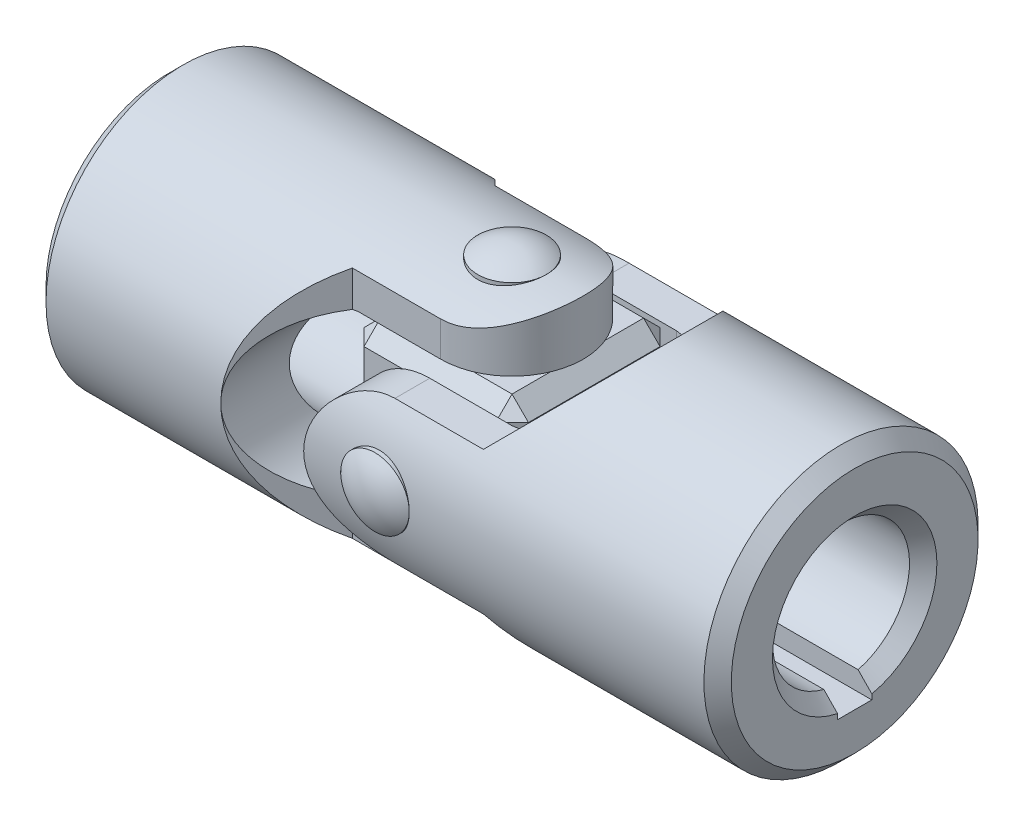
ISO-10303-21;
HEADER;
FILE_DESCRIPTION(('STEP AP214'),'2;1');
FILE_NAME('part.step','',(''),(''),'','','');
FILE_SCHEMA(('AUTOMOTIVE_DESIGN { 1 0 10303 214 1 1 1 1 }'));
ENDSEC;
DATA;
#1=APPLICATION_CONTEXT('core data for automotive mechanical design processes');
#2=APPLICATION_PROTOCOL_DEFINITION('international standard','automotive_design',2000,#1);
#3=PRODUCT_CONTEXT('',#1,'mechanical');
#4=PRODUCT('Part','Part','',(#3));
#5=PRODUCT_RELATED_PRODUCT_CATEGORY('part','',(#4));
#6=PRODUCT_DEFINITION_FORMATION('','',#4);
#7=PRODUCT_DEFINITION_CONTEXT('part definition',#1,'design');
#8=PRODUCT_DEFINITION('design','',#6,#7);
#9=PRODUCT_DEFINITION_SHAPE('','',#8);
#10=(LENGTH_UNIT() NAMED_UNIT(*) SI_UNIT(.MILLI.,.METRE.));
#11=(NAMED_UNIT(*) PLANE_ANGLE_UNIT() SI_UNIT($,.RADIAN.));
#12=(NAMED_UNIT(*) SI_UNIT($,.STERADIAN.) SOLID_ANGLE_UNIT());
#13=UNCERTAINTY_MEASURE_WITH_UNIT(LENGTH_MEASURE(1.E-05),#10,'distance_accuracy_value','');
#14=(GEOMETRIC_REPRESENTATION_CONTEXT(3) GLOBAL_UNCERTAINTY_ASSIGNED_CONTEXT((#13)) GLOBAL_UNIT_ASSIGNED_CONTEXT((#10,
#11,#12)) REPRESENTATION_CONTEXT('',''));
#15=CARTESIAN_POINT('',(0.,0.,0.));
#16=DIRECTION('',(0.,0.,1.));
#17=DIRECTION('',(1.,0.,0.));
#18=AXIS2_PLACEMENT_3D('',#15,#16,#17);
#19=CARTESIAN_POINT('',(0.,8.,0.));
#20=DIRECTION('',(0.,-1.,0.));
#21=DIRECTION('',(-1.,0.,0.));
#22=AXIS2_PLACEMENT_3D('',#19,#20,#21);
#23=CYLINDRICAL_SURFACE('',#22,2.);
#24=CARTESIAN_POINT('',(0.,8.,0.));
#25=DIRECTION('',(0.,1.,0.));
#26=DIRECTION('',(1.,0.,0.));
#27=AXIS2_PLACEMENT_3D('',#24,#25,#26);
#28=CIRCLE('',#27,2.);
#29=CARTESIAN_POINT('',(2.,8.,0.));
#30=VERTEX_POINT('',#29);
#31=EDGE_CURVE('P0_E10',#30,#30,#28,.T.);
#32=ORIENTED_EDGE('',*,*,#31,.F.);
#33=EDGE_LOOP('',(#32));
#34=FACE_BOUND('',#33,.T.);
#35=CARTESIAN_POINT('',(0.,-8.00000000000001,0.));
#36=DIRECTION('',(0.,-1.,0.));
#37=DIRECTION('',(0.,0.,-1.));
#38=AXIS2_PLACEMENT_3D('',#35,#36,#37);
#39=CIRCLE('',#38,2.);
#40=CARTESIAN_POINT('',(0.,-8.,-2.));
#41=VERTEX_POINT('',#40);
#42=EDGE_CURVE('P0_E20',#41,#41,#39,.T.);
#43=ORIENTED_EDGE('',*,*,#42,.F.);
#44=EDGE_LOOP('',(#43));
#45=FACE_BOUND('',#44,.T.);
#46=ADVANCED_FACE('P0_F14',(#34,#45),#23,.T.);
#47=CARTESIAN_POINT('',(0.,5.19500000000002,0.));
#48=DIRECTION('',(0.,-1.,0.));
#49=DIRECTION('',(0.,0.,-1.));
#50=AXIS2_PLACEMENT_3D('',#47,#48,#49);
#51=SPHERICAL_SURFACE('',#50,3.44499999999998);
#52=ORIENTED_EDGE('',*,*,#31,.T.);
#53=EDGE_LOOP('',(#52));
#54=FACE_BOUND('',#53,.T.);
#55=ADVANCED_FACE('P0_F29',(#54),#51,.T.);
#56=CARTESIAN_POINT('',(0.,-5.19500000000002,0.));
#57=DIRECTION('',(0.,1.,0.));
#58=DIRECTION('',(0.,0.,-1.));
#59=AXIS2_PLACEMENT_3D('',#56,#57,#58);
#60=SPHERICAL_SURFACE('',#59,3.44499999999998);
#61=ORIENTED_EDGE('',*,*,#42,.T.);
#62=EDGE_LOOP('',(#61));
#63=FACE_BOUND('',#62,.T.);
#64=ADVANCED_FACE('P0_F26',(#63),#60,.T.);
#65=CLOSED_SHELL('',(#46,#55,#64));
#66=MANIFOLD_SOLID_BREP('P0_B1',#65);
#67=CARTESIAN_POINT('',(0.,0.,8.));
#68=DIRECTION('',(0.,0.,-1.));
#69=DIRECTION('',(-1.,0.,0.));
#70=AXIS2_PLACEMENT_3D('',#67,#68,#69);
#71=CYLINDRICAL_SURFACE('',#70,2.);
#72=CARTESIAN_POINT('',(0.,0.,8.));
#73=DIRECTION('',(0.,0.,1.));
#74=DIRECTION('',(1.,0.,0.));
#75=AXIS2_PLACEMENT_3D('',#72,#73,#74);
#76=CIRCLE('',#75,2.);
#77=CARTESIAN_POINT('',(2.,0.,8.));
#78=VERTEX_POINT('',#77);
#79=EDGE_CURVE('P1_E10',#78,#78,#76,.T.);
#80=ORIENTED_EDGE('',*,*,#79,.F.);
#81=EDGE_LOOP('',(#80));
#82=FACE_BOUND('',#81,.T.);
#83=CARTESIAN_POINT('',(0.,0.,-8.00000000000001));
#84=DIRECTION('',(0.,0.,-1.));
#85=DIRECTION('',(0.,1.,0.));
#86=AXIS2_PLACEMENT_3D('',#83,#84,#85);
#87=CIRCLE('',#86,2.);
#88=CARTESIAN_POINT('',(0.,2.,-8.));
#89=VERTEX_POINT('',#88);
#90=EDGE_CURVE('P1_E20',#89,#89,#87,.T.);
#91=ORIENTED_EDGE('',*,*,#90,.F.);
#92=EDGE_LOOP('',(#91));
#93=FACE_BOUND('',#92,.T.);
#94=ADVANCED_FACE('P1_F14',(#82,#93),#71,.T.);
#95=CARTESIAN_POINT('',(0.,0.,5.19500000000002));
#96=DIRECTION('',(0.,0.,-1.));
#97=DIRECTION('',(0.,1.,0.));
#98=AXIS2_PLACEMENT_3D('',#95,#96,#97);
#99=SPHERICAL_SURFACE('',#98,3.44499999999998);
#100=ORIENTED_EDGE('',*,*,#79,.T.);
#101=EDGE_LOOP('',(#100));
#102=FACE_BOUND('',#101,.T.);
#103=ADVANCED_FACE('P1_F29',(#102),#99,.T.);
#104=CARTESIAN_POINT('',(0.,0.,-5.19500000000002));
#105=DIRECTION('',(0.,0.,1.));
#106=DIRECTION('',(0.,1.,0.));
#107=AXIS2_PLACEMENT_3D('',#104,#105,#106);
#108=SPHERICAL_SURFACE('',#107,3.44499999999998);
#109=ORIENTED_EDGE('',*,*,#90,.T.);
#110=EDGE_LOOP('',(#109));
#111=FACE_BOUND('',#110,.T.);
#112=ADVANCED_FACE('P1_F26',(#111),#108,.T.);
#113=CLOSED_SHELL('',(#94,#103,#112));
#114=MANIFOLD_SOLID_BREP('P1_B1',#113);
#115=CARTESIAN_POINT('',(0.,-8.,-4.16));
#116=DIRECTION('',(0.,0.,1.));
#117=DIRECTION('',(1.,0.,0.));
#118=AXIS2_PLACEMENT_3D('',#115,#116,#117);
#119=PLANE('',#118);
#120=DIRECTION('',(0.,1.,0.));
#121=VECTOR('',#120,1.);
#122=CARTESIAN_POINT('',(0.,-8.,-4.16));
#123=LINE('',#122,#121);
#124=CARTESIAN_POINT('',(0.,4.8,-4.16));
#125=VERTEX_POINT('',#124);
#126=CARTESIAN_POINT('',(0.,6.83333008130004,-4.16));
#127=VERTEX_POINT('',#126);
#128=EDGE_CURVE('P2_E349',#125,#127,#123,.T.);
#129=ORIENTED_EDGE('',*,*,#128,.F.);
#130=DIRECTION('',(-1.,0.,0.));
#131=VECTOR('',#130,1.);
#132=CARTESIAN_POINT('',(0.,4.8,-4.16));
#133=LINE('',#132,#131);
#134=CARTESIAN_POINT('',(-4.80000000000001,4.8,-4.16));
#135=VERTEX_POINT('',#134);
#136=EDGE_CURVE('P2_E179',#125,#135,#133,.T.);
#137=ORIENTED_EDGE('',*,*,#136,.T.);
#138=CARTESIAN_POINT('',(-4.15714285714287,0.,-4.16));
#139=DIRECTION('',(0.,0.,1.));
#140=DIRECTION('',(1.,0.,0.));
#141=AXIS2_PLACEMENT_3D('',#138,#139,#140);
#142=CIRCLE('',#141,4.84285714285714);
#143=CARTESIAN_POINT('',(-5.16000000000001,4.7378837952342,-4.16));
#144=VERTEX_POINT('',#143);
#145=EDGE_CURVE('P2_E196',#135,#144,#142,.T.);
#146=ORIENTED_EDGE('',*,*,#145,.T.);
#147=DIRECTION('',(0.,1.,0.));
#148=VECTOR('',#147,1.);
#149=CARTESIAN_POINT('',(-5.16000000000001,-8.,-4.16));
#150=LINE('',#149,#148);
#151=CARTESIAN_POINT('',(-5.16000000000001,6.83333008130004,-4.16));
#152=VERTEX_POINT('',#151);
#153=EDGE_CURVE('P2_E356',#144,#152,#150,.T.);
#154=ORIENTED_EDGE('',*,*,#153,.T.);
#155=DIRECTION('',(1.,0.,0.));
#156=VECTOR('',#155,1.);
#157=CARTESIAN_POINT('',(-20.,6.83333008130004,-4.15999999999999));
#158=LINE('',#157,#156);
#159=EDGE_CURVE('P2_E283',#127,#152,#158,.F.);
#160=ORIENTED_EDGE('',*,*,#159,.F.);
#161=EDGE_LOOP('',(#129,#137,#146,#154,#160));
#162=FACE_BOUND('',#161,.T.);
#163=ADVANCED_FACE('P2_F16',(#162),#119,.F.);
#164=CARTESIAN_POINT('',(-5.16000000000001,-8.,-4.16));
#165=DIRECTION('',(-0.707106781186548,0.,0.707106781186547));
#166=DIRECTION('',(0.707106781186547,0.,0.707106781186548));
#167=AXIS2_PLACEMENT_3D('',#164,#165,#166);
#168=PLANE('',#167);
#169=CARTESIAN_POINT('',(-1.00000000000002,0.,0.));
#170=DIRECTION('',(-0.707106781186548,0.,0.707106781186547));
#171=DIRECTION('',(0.707106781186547,0.,0.707106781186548));
#172=AXIS2_PLACEMENT_3D('',#169,#170,#171);
#173=ELLIPSE('',#172,11.3137084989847,8.);
#174=CARTESIAN_POINT('',(-9.00000000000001,0.,-8.));
#175=VERTEX_POINT('',#174);
#176=CARTESIAN_POINT('',(-5.16000000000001,-6.83333008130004,-4.16));
#177=VERTEX_POINT('',#176);
#178=EDGE_CURVE('P2_E286',#175,#177,#173,.T.);
#179=ORIENTED_EDGE('',*,*,#178,.F.);
#180=CARTESIAN_POINT('',(-4.15714285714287,0.,-3.15714285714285));
#181=DIRECTION('',(-0.707106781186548,0.,0.707106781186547));
#182=DIRECTION('',(-0.707106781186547,0.,-0.707106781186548));
#183=AXIS2_PLACEMENT_3D('',#180,#181,#182);
#184=ELLIPSE('',#183,6.84883425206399,4.84285714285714);
#185=CARTESIAN_POINT('',(-5.16000000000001,-4.7378837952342,-4.16));
#186=VERTEX_POINT('',#185);
#187=EDGE_CURVE('P2_E192',#175,#186,#184,.T.);
#188=ORIENTED_EDGE('',*,*,#187,.T.);
#189=EDGE_CURVE('P2_E353',#177,#186,#150,.T.);
#190=ORIENTED_EDGE('',*,*,#189,.F.);
#191=EDGE_LOOP('',(#179,#188,#190));
#192=FACE_BOUND('',#191,.T.);
#193=ADVANCED_FACE('P2_F234',(#192),#168,.F.);
#194=CARTESIAN_POINT('',(-5.16000000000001,-8.,4.16));
#195=DIRECTION('',(-0.707106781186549,0.,-0.707106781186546));
#196=DIRECTION('',(-0.707106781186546,0.,0.707106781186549));
#197=AXIS2_PLACEMENT_3D('',#194,#195,#196);
#198=PLANE('',#197);
#199=DIRECTION('',(0.,1.,0.));
#200=VECTOR('',#199,1.);
#201=CARTESIAN_POINT('',(-5.16000000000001,-8.,4.16));
#202=LINE('',#201,#200);
#203=CARTESIAN_POINT('',(-5.16000000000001,-6.83333008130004,4.16));
#204=VERTEX_POINT('',#203);
#205=CARTESIAN_POINT('',(-5.16000000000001,-4.7378837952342,4.16));
#206=VERTEX_POINT('',#205);
#207=EDGE_CURVE('P2_E359',#204,#206,#202,.T.);
#208=ORIENTED_EDGE('',*,*,#207,.T.);
#209=CARTESIAN_POINT('',(-4.15714285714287,0.,3.15714285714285));
#210=DIRECTION('',(-0.707106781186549,0.,-0.707106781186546));
#211=DIRECTION('',(0.707106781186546,0.,-0.707106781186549));
#212=AXIS2_PLACEMENT_3D('',#209,#210,#211);
#213=ELLIPSE('',#212,6.848834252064,4.84285714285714);
#214=CARTESIAN_POINT('',(-9.,0.,8.));
#215=VERTEX_POINT('',#214);
#216=EDGE_CURVE('P2_E185',#206,#215,#213,.T.);
#217=ORIENTED_EDGE('',*,*,#216,.T.);
#218=CARTESIAN_POINT('',(-1.00000000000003,0.,0.));
#219=DIRECTION('',(-0.707106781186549,0.,-0.707106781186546));
#220=DIRECTION('',(0.707106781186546,0.,-0.707106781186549));
#221=AXIS2_PLACEMENT_3D('',#218,#219,#220);
#222=ELLIPSE('',#221,11.3137084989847,8.);
#223=EDGE_CURVE('P2_E297',#204,#215,#222,.T.);
#224=ORIENTED_EDGE('',*,*,#223,.F.);
#225=EDGE_LOOP('',(#208,#217,#224));
#226=FACE_BOUND('',#225,.T.);
#227=ADVANCED_FACE('P2_F239',(#226),#198,.F.);
#228=CARTESIAN_POINT('',(0.,-8.,4.16));
#229=DIRECTION('',(0.,0.,-1.));
#230=DIRECTION('',(-1.,0.,0.));
#231=AXIS2_PLACEMENT_3D('',#228,#229,#230);
#232=PLANE('',#231);
#233=CARTESIAN_POINT('',(-4.15714285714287,0.,4.16));
#234=DIRECTION('',(0.,0.,-1.));
#235=DIRECTION('',(-1.,0.,0.));
#236=AXIS2_PLACEMENT_3D('',#233,#234,#235);
#237=CIRCLE('',#236,4.84285714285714);
#238=CARTESIAN_POINT('',(-5.16000000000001,4.7378837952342,4.16));
#239=VERTEX_POINT('',#238);
#240=CARTESIAN_POINT('',(-4.80000000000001,4.8,4.16));
#241=VERTEX_POINT('',#240);
#242=EDGE_CURVE('P2_E311',#239,#241,#237,.T.);
#243=ORIENTED_EDGE('',*,*,#242,.T.);
#244=DIRECTION('',(1.,0.,0.));
#245=VECTOR('',#244,1.);
#246=CARTESIAN_POINT('',(0.,4.8,4.16));
#247=LINE('',#246,#245);
#248=CARTESIAN_POINT('',(0.,4.8,4.16));
#249=VERTEX_POINT('',#248);
#250=EDGE_CURVE('P2_E176',#241,#249,#247,.T.);
#251=ORIENTED_EDGE('',*,*,#250,.T.);
#252=DIRECTION('',(0.,1.,0.));
#253=VECTOR('',#252,1.);
#254=CARTESIAN_POINT('',(0.,-8.,4.16));
#255=LINE('',#254,#253);
#256=CARTESIAN_POINT('',(0.,6.83333008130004,4.16));
#257=VERTEX_POINT('',#256);
#258=EDGE_CURVE('P2_E204',#249,#257,#255,.T.);
#259=ORIENTED_EDGE('',*,*,#258,.T.);
#260=DIRECTION('',(1.,0.,0.));
#261=VECTOR('',#260,1.);
#262=CARTESIAN_POINT('',(-20.,6.83333008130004,4.16));
#263=LINE('',#262,#261);
#264=CARTESIAN_POINT('',(-5.16000000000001,6.83333008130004,4.16));
#265=VERTEX_POINT('',#264);
#266=EDGE_CURVE('P2_E300',#265,#257,#263,.T.);
#267=ORIENTED_EDGE('',*,*,#266,.F.);
#268=EDGE_CURVE('P2_E361',#239,#265,#202,.T.);
#269=ORIENTED_EDGE('',*,*,#268,.F.);
#270=EDGE_LOOP('',(#243,#251,#259,#267,#269));
#271=FACE_BOUND('',#270,.T.);
#272=ADVANCED_FACE('P2_F243',(#271),#232,.F.);
#273=CARTESIAN_POINT('',(0.,-8.,0.));
#274=DIRECTION('',(0.,1.,0.));
#275=DIRECTION('',(0.,0.,-1.));
#276=AXIS2_PLACEMENT_3D('',#273,#274,#275);
#277=CYLINDRICAL_SURFACE('',#276,4.16);
#278=ORIENTED_EDGE('',*,*,#258,.F.);
#279=CARTESIAN_POINT('',(0.,4.8,0.));
#280=DIRECTION('',(0.,1.,0.));
#281=DIRECTION('',(1.,0.,0.));
#282=AXIS2_PLACEMENT_3D('',#279,#280,#281);
#283=CIRCLE('',#282,4.16);
#284=EDGE_CURVE('P2_E305',#249,#125,#283,.T.);
#285=ORIENTED_EDGE('',*,*,#284,.T.);
#286=ORIENTED_EDGE('',*,*,#128,.T.);
#287=CARTESIAN_POINT('',(0.,6.83333008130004,4.16));
#288=CARTESIAN_POINT('',(0.108261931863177,6.83329587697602,4.16002034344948));
#289=CARTESIAN_POINT('',(0.216504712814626,6.83590202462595,4.15577454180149));
#290=CARTESIAN_POINT('',(0.432026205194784,6.8461370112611,4.13891096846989));
#291=CARTESIAN_POINT('',(0.539305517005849,6.85376246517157,4.12629883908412));
#292=CARTESIAN_POINT('',(0.751468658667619,6.87371719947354,4.09296526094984));
#293=CARTESIAN_POINT('',(0.856363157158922,6.88601728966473,4.07229411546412));
#294=CARTESIAN_POINT('',(1.06368739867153,6.91485928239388,4.02312470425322));
#295=CARTESIAN_POINT('',(1.16611682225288,6.9314017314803,3.99462542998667));
#296=CARTESIAN_POINT('',(1.46823137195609,6.9864922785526,3.89800562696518));
#297=CARTESIAN_POINT('',(1.66343915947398,7.03057502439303,3.81865116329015));
#298=CARTESIAN_POINT('',(2.03791814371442,7.1284378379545,3.63268124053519));
#299=CARTESIAN_POINT('',(2.21716182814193,7.18223418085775,3.52601990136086));
#300=CARTESIAN_POINT('',(2.57198745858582,7.29924876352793,3.27741952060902));
#301=CARTESIAN_POINT('',(2.74582706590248,7.36287944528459,3.13318716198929));
#302=CARTESIAN_POINT('',(3.06824588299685,7.48909161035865,2.81819551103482));
#303=CARTESIAN_POINT('',(3.21681782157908,7.55167278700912,2.64742860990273));
#304=CARTESIAN_POINT('',(3.42309382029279,7.64249982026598,2.36703844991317));
#305=CARTESIAN_POINT('',(3.49106246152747,7.67324869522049,2.26562555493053));
#306=CARTESIAN_POINT('',(3.61812678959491,7.73188589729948,2.05662249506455));
#307=CARTESIAN_POINT('',(3.67722627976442,7.75977544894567,1.94903500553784));
#308=CARTESIAN_POINT('',(3.78597176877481,7.81189514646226,1.72833836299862));
#309=CARTESIAN_POINT('',(3.83561806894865,7.83612540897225,1.61522938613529));
#310=CARTESIAN_POINT('',(3.92485513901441,7.88018918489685,1.38434651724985));
#311=CARTESIAN_POINT('',(3.96445174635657,7.90002524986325,1.26657537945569));
#312=CARTESIAN_POINT('',(4.03049561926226,7.93338177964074,1.03631510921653));
#313=CARTESIAN_POINT('',(4.0577098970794,7.94726597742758,0.924098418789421));
#314=CARTESIAN_POINT('',(4.10275721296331,7.97036021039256,0.697375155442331));
#315=CARTESIAN_POINT('',(4.12059495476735,7.97957258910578,0.582869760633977));
#316=CARTESIAN_POINT('',(4.14665688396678,7.99306191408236,0.352516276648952));
#317=CARTESIAN_POINT('',(4.15488409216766,7.99734041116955,0.236668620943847));
#318=CARTESIAN_POINT('',(4.16161636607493,8.00084010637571,0.00461985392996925));
#319=CARTESIAN_POINT('',(4.16012209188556,8.00006164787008,-0.111581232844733));
#320=CARTESIAN_POINT('',(4.14803118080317,7.99378124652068,-0.332388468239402));
#321=CARTESIAN_POINT('',(4.13830509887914,7.98873108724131,-0.437055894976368));
#322=CARTESIAN_POINT('',(4.1110182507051,7.97463120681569,-0.645101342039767));
#323=CARTESIAN_POINT('',(4.09345498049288,7.96558020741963,-0.748478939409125));
#324=CARTESIAN_POINT('',(4.02927802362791,7.93272127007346,-1.05552159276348));
#325=CARTESIAN_POINT('',(3.97116516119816,7.90320076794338,-1.25630810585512));
#326=CARTESIAN_POINT('',(3.82571613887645,7.83112343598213,-1.64731919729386));
#327=CARTESIAN_POINT('',(3.73801464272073,7.78840422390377,-1.83737523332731));
#328=CARTESIAN_POINT('',(3.53644053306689,7.69369182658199,-2.20053287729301));
#329=CARTESIAN_POINT('',(3.42255856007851,7.64169532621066,-2.37362839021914));
#330=CARTESIAN_POINT('',(3.15881752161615,7.52708788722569,-2.71639244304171));
#331=CARTESIAN_POINT('',(3.00650050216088,7.46393548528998,-2.88399002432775));
#332=CARTESIAN_POINT('',(2.67675331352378,7.33731357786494,-3.19244201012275));
#333=CARTESIAN_POINT('',(2.49929763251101,7.27384381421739,-3.33326890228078));
#334=CARTESIAN_POINT('',(2.10827986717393,7.14861170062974,-3.5944209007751));
#335=CARTESIAN_POINT('',(1.89302312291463,7.08731717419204,-3.71248040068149));
#336=CARTESIAN_POINT('',(1.5551058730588,7.00719397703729,-3.86035932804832));
#337=CARTESIAN_POINT('',(1.44003696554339,6.98246761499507,-3.90476552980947));
#338=CARTESIAN_POINT('',(1.20558279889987,6.93790967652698,-3.9833962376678));
#339=CARTESIAN_POINT('',(1.08619940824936,6.91807600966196,-4.017625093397));
#340=CARTESIAN_POINT('',(0.808335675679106,6.87923025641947,-4.08388443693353));
#341=CARTESIAN_POINT('',(0.648684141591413,6.8621757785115,-4.11230692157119));
#342=CARTESIAN_POINT('',(0.406865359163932,6.84495532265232,-4.14085677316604));
#343=CARTESIAN_POINT('',(0.325750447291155,6.84060850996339,-4.1480262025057));
#344=CARTESIAN_POINT('',(0.163100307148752,6.83479185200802,-4.15759989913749));
#345=CARTESIAN_POINT('',(0.0815649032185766,6.8333233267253,-4.1600019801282));
#346=CARTESIAN_POINT('',(0.,6.83333008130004,-4.16));
#347=B_SPLINE_CURVE_WITH_KNOTS('',3,(#287,#288,#289,#290,#291,#292,#293,#294,#295,#296,#297,
#298,#299,#300,#301,#302,#303,#304,#305,#306,#307,#308,#309,#310,#311,#312,#313,#314,#315,#316,
#317,#318,#319,#320,#321,#322,#323,#324,#325,#326,#327,#328,#329,#330,#331,#332,#333,#334,#335,
#336,#337,#338,#339,#340,#341,#342,#343,#344,#345,#346),.UNSPECIFIED.,.F.,.F.,(4,2,2,2,2,2,2,2,
2,2,2,2,2,2,2,2,2,2,2,2,2,2,2,2,2,2,2,2,2,4),(0.,0.324639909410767,0.649061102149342,
0.971488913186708,1.29395828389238,1.93679706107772,2.58072308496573,3.28189793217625,
3.98327421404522,4.36054531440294,4.73765416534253,5.11475099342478,5.49162827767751,
5.84005408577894,6.18830493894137,6.53644629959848,6.88456402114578,7.19989451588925,
7.51532583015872,8.145560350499,8.78388003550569,9.4224282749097,10.1247861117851,
10.8278619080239,11.5825786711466,11.9594728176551,12.3362056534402,12.8237498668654,
13.0682265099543,13.3128152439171),.UNSPECIFIED.);
#348=EDGE_CURVE('P2_E258',#257,#127,#347,.T.);
#349=ORIENTED_EDGE('',*,*,#348,.F.);
#350=EDGE_LOOP('',(#278,#285,#286,#349));
#351=FACE_BOUND('',#350,.T.);
#352=ADVANCED_FACE('P2_F247',(#351),#277,.T.);
#353=CARTESIAN_POINT('',(-20.,0.,0.));
#354=DIRECTION('',(-1.,0.,0.));
#355=DIRECTION('',(0.,0.,1.));
#356=AXIS2_PLACEMENT_3D('',#353,#354,#355);
#357=PLANE('',#356);
#358=DIRECTION('',(0.,0.,1.));
#359=VECTOR('',#358,1.);
#360=CARTESIAN_POINT('',(-20.,-1.,-5.));
#361=LINE('',#360,#359);
#362=CARTESIAN_POINT('',(-20.,-1.,-5.));
#363=VERTEX_POINT('',#362);
#364=CARTESIAN_POINT('',(-20.,-1.,-4.69467783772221));
#365=VERTEX_POINT('',#364);
#366=EDGE_CURVE('P2_E139',#363,#365,#361,.T.);
#367=ORIENTED_EDGE('',*,*,#366,.F.);
#368=DIRECTION('',(0.,-1.,0.));
#369=VECTOR('',#368,1.);
#370=CARTESIAN_POINT('',(-20.,-1.,-5.));
#371=LINE('',#370,#369);
#372=CARTESIAN_POINT('',(-20.,1.,-5.));
#373=VERTEX_POINT('',#372);
#374=EDGE_CURVE('P2_E135',#373,#363,#371,.T.);
#375=ORIENTED_EDGE('',*,*,#374,.F.);
#376=DIRECTION('',(0.,0.,-1.));
#377=VECTOR('',#376,1.);
#378=CARTESIAN_POINT('',(-20.,1.,-5.));
#379=LINE('',#378,#377);
#380=CARTESIAN_POINT('',(-20.,1.,-4.69467783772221));
#381=VERTEX_POINT('',#380);
#382=EDGE_CURVE('P2_E142',#381,#373,#379,.T.);
#383=ORIENTED_EDGE('',*,*,#382,.F.);
#384=CARTESIAN_POINT('',(-20.,0.,0.));
#385=DIRECTION('',(-1.,0.,0.));
#386=DIRECTION('',(0.,0.,1.));
#387=AXIS2_PLACEMENT_3D('',#384,#385,#386);
#388=CIRCLE('',#387,4.80000000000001);
#389=EDGE_CURVE('P2_E318',#381,#365,#388,.F.);
#390=ORIENTED_EDGE('',*,*,#389,.T.);
#391=EDGE_LOOP('',(#367,#375,#383,#390));
#392=FACE_BOUND('',#391,.T.);
#393=CARTESIAN_POINT('',(-20.,0.,0.));
#394=DIRECTION('',(-1.,0.,0.));
#395=DIRECTION('',(0.,0.,1.));
#396=AXIS2_PLACEMENT_3D('',#393,#394,#395);
#397=CIRCLE('',#396,7.2);
#398=CARTESIAN_POINT('',(-20.,0.,7.2));
#399=VERTEX_POINT('',#398);
#400=EDGE_CURVE('P2_E315',#399,#399,#397,.T.);
#401=ORIENTED_EDGE('',*,*,#400,.T.);
#402=EDGE_LOOP('',(#401));
#403=FACE_BOUND('',#402,.T.);
#404=ADVANCED_FACE('P2_F149',(#392,#403),#357,.T.);
#405=CARTESIAN_POINT('',(-20.,0.,0.));
#406=DIRECTION('',(1.,0.,0.));
#407=DIRECTION('',(0.,0.,-1.));
#408=AXIS2_PLACEMENT_3D('',#405,#406,#407);
#409=CYLINDRICAL_SURFACE('',#408,8.);
#410=CARTESIAN_POINT('',(-19.2,0.,0.));
#411=DIRECTION('',(-1.,0.,0.));
#412=DIRECTION('',(0.,0.,1.));
#413=AXIS2_PLACEMENT_3D('',#410,#411,#412);
#414=CIRCLE('',#413,8.);
#415=CARTESIAN_POINT('',(-19.2,0.,8.));
#416=VERTEX_POINT('',#415);
#417=EDGE_CURVE('P2_E320',#416,#416,#414,.F.);
#418=ORIENTED_EDGE('',*,*,#417,.T.);
#419=EDGE_LOOP('',(#418));
#420=FACE_BOUND('',#419,.T.);
#421=CARTESIAN_POINT('',(2.,-8.,0.));
#422=CARTESIAN_POINT('',(1.99999689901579,-7.9999981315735,-0.110501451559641));
#423=CARTESIAN_POINT('',(1.99081126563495,-7.99768770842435,-0.221037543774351));
#424=CARTESIAN_POINT('',(1.95436646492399,-7.98869485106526,-0.438941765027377));
#425=CARTESIAN_POINT('',(1.92709705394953,-7.98200993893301,-0.546308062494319));
#426=CARTESIAN_POINT('',(1.85541432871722,-7.96500835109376,-0.754694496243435));
#427=CARTESIAN_POINT('',(1.81102160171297,-7.95469603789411,-0.855722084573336));
#428=CARTESIAN_POINT('',(1.70642481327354,-7.93153791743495,-1.04889617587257));
#429=CARTESIAN_POINT('',(1.64622021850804,-7.91869202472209,-1.14104237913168));
#430=CARTESIAN_POINT('',(1.51039894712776,-7.89156551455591,-1.31573590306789));
#431=CARTESIAN_POINT('',(1.43451790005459,-7.87726276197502,-1.39807425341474));
#432=CARTESIAN_POINT('',(1.27006372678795,-7.84898160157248,-1.54899856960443));
#433=CARTESIAN_POINT('',(1.18148916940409,-7.83500323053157,-1.61758298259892));
#434=CARTESIAN_POINT('',(0.992539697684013,-7.80873034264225,-1.74003539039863));
#435=CARTESIAN_POINT('',(0.892009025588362,-7.79646392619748,-1.79366962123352));
#436=CARTESIAN_POINT('',(0.68300211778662,-7.77532659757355,-1.88319587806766));
#437=CARTESIAN_POINT('',(0.574527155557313,-7.76645514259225,-1.91909074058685));
#438=CARTESIAN_POINT('',(0.355008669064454,-7.7533396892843,-1.97140644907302));
#439=CARTESIAN_POINT('',(0.244060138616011,-7.74900654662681,-1.98820302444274));
#440=CARTESIAN_POINT('',(0.0208419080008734,-7.74519149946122,-2.00301570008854));
#441=CARTESIAN_POINT('',(-0.0914275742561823,-7.74570880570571,-2.00103485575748));
#442=CARTESIAN_POINT('',(-0.311221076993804,-7.75145607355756,-1.97864869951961));
#443=CARTESIAN_POINT('',(-0.418794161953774,-7.75657150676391,-1.95869112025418));
#444=CARTESIAN_POINT('',(-0.629014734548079,-7.77075612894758,-1.90163224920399));
#445=CARTESIAN_POINT('',(-0.731661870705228,-7.77982559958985,-1.86452973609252));
#446=CARTESIAN_POINT('',(-0.93031735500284,-7.80100151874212,-1.77385263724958));
#447=CARTESIAN_POINT('',(-1.02624822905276,-7.81313769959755,-1.72011555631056));
#448=CARTESIAN_POINT('',(-1.20789161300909,-7.83906281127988,-1.59780836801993));
#449=CARTESIAN_POINT('',(-1.29360233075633,-7.85285203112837,-1.52923566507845));
#450=CARTESIAN_POINT('',(-1.45493815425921,-7.88101174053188,-1.37688456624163));
#451=CARTESIAN_POINT('',(-1.53020598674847,-7.89538759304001,-1.29272834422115));
#452=CARTESIAN_POINT('',(-1.6656283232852,-7.92274620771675,-1.11281589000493));
#453=CARTESIAN_POINT('',(-1.72578236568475,-7.93572892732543,-1.01705930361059));
#454=CARTESIAN_POINT('',(-1.82940078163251,-7.9589030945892,-0.816154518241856));
#455=CARTESIAN_POINT('',(-1.87280712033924,-7.96908480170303,-0.710975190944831));
#456=CARTESIAN_POINT('',(-1.94122307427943,-7.98543889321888,-0.49450134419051));
#457=CARTESIAN_POINT('',(-1.96623620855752,-7.99161204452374,-0.383207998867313));
#458=CARTESIAN_POINT('',(-1.99661008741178,-7.999139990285,-0.160719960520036));
#459=CARTESIAN_POINT('',(-2.0024573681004,-8.00061404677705,-0.0495956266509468));
#460=CARTESIAN_POINT('',(-1.99566799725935,-7.99891739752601,0.172043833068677));
#461=CARTESIAN_POINT('',(-1.98303300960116,-7.99574710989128,0.28255901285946));
#462=CARTESIAN_POINT('',(-1.94003878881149,-7.98519441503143,0.498152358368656));
#463=CARTESIAN_POINT('',(-1.90994498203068,-7.97787512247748,0.603286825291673));
#464=CARTESIAN_POINT('',(-1.83319055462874,-7.95984942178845,0.807009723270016));
#465=CARTESIAN_POINT('',(-1.78652826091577,-7.94914267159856,0.905597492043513));
#466=CARTESIAN_POINT('',(-1.6770184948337,-7.92524410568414,1.0953641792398));
#467=CARTESIAN_POINT('',(-1.61389851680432,-7.91201156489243,1.18638058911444));
#468=CARTESIAN_POINT('',(-1.47361345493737,-7.88459345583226,1.35670215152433));
#469=CARTESIAN_POINT('',(-1.39644594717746,-7.87040772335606,1.43600527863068));
#470=CARTESIAN_POINT('',(-1.22799738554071,-7.84225275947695,1.58265409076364));
#471=CARTESIAN_POINT('',(-1.13641639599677,-7.82829738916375,1.64965849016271));
#472=CARTESIAN_POINT('',(-0.943023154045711,-7.80257171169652,1.7673476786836));
#473=CARTESIAN_POINT('',(-0.841211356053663,-7.79080130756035,1.81803319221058));
#474=CARTESIAN_POINT('',(-0.630792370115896,-7.77090792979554,1.90126856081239));
#475=CARTESIAN_POINT('',(-0.522229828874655,-7.76276340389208,1.93392586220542));
#476=CARTESIAN_POINT('',(-0.300920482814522,-7.75102325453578,1.98046087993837));
#477=CARTESIAN_POINT('',(-0.188174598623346,-7.74742663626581,1.99434270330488));
#478=CARTESIAN_POINT('',(0.0348280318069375,-7.74526534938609,2.00271812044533));
#479=CARTESIAN_POINT('',(0.145063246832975,-7.74655910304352,1.99775719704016));
#480=CARTESIAN_POINT('',(0.363071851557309,-7.7537054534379,1.96983637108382));
#481=CARTESIAN_POINT('',(0.470845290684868,-7.75955795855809,1.94687683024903));
#482=CARTESIAN_POINT('',(0.680277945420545,-7.77508347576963,1.88390842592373));
#483=CARTESIAN_POINT('',(0.781969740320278,-7.78473353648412,1.84400187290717));
#484=CARTESIAN_POINT('',(0.977287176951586,-7.80677007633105,1.74835321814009));
#485=CARTESIAN_POINT('',(1.07091169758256,-7.81915693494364,1.69260892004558));
#486=CARTESIAN_POINT('',(1.25007283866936,-7.8456751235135,1.56515699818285));
#487=CARTESIAN_POINT('',(1.33533476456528,-7.85984353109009,1.49307088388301));
#488=CARTESIAN_POINT('',(1.49272939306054,-7.88810702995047,1.33571916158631));
#489=CARTESIAN_POINT('',(1.56485897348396,-7.90220210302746,1.25045042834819));
#490=CARTESIAN_POINT('',(1.69521507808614,-7.92903540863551,1.06729011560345));
#491=CARTESIAN_POINT('',(1.75316615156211,-7.94174444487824,0.969197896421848));
#492=CARTESIAN_POINT('',(1.85166328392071,-7.96406566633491,0.764354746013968));
#493=CARTESIAN_POINT('',(1.89222181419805,-7.97368006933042,0.657610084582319));
#494=CARTESIAN_POINT('',(1.94876244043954,-7.98730746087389,0.459213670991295));
#495=CARTESIAN_POINT('',(1.96793499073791,-7.9920344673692,0.368506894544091));
#496=CARTESIAN_POINT('',(1.99355459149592,-7.99838140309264,0.185208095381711));
#497=CARTESIAN_POINT('',(2.00000259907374,-8.00000156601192,0.0926162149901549));
#498=CARTESIAN_POINT('',(2.,-8.,0.));
#499=B_SPLINE_CURVE_WITH_KNOTS('',3,(#421,#422,#423,#424,#425,#426,#427,#428,#429,#430,#431,
#432,#433,#434,#435,#436,#437,#438,#439,#440,#441,#442,#443,#444,#445,#446,#447,#448,#449,#450,
#451,#452,#453,#454,#455,#456,#457,#458,#459,#460,#461,#462,#463,#464,#465,#466,#467,#468,#469,
#470,#471,#472,#473,#474,#475,#476,#477,#478,#479,#480,#481,#482,#483,#484,#485,#486,#487,#488,
#489,#490,#491,#492,#493,#494,#495,#496,#497,#498),.UNSPECIFIED.,.T.,.F.,(4,2,2,2,2,2,2,2,2,2,2,
2,2,2,2,2,2,2,2,2,2,2,2,2,2,2,2,2,2,2,2,2,2,2,2,2,2,2,4),(0.,0.33116494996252,0.662517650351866,
0.993473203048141,1.32443992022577,1.66152580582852,1.99864972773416,2.34078196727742,
2.68285948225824,3.01808393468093,3.3532538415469,3.68029996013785,4.00736937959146,
4.337740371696,4.66816921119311,5.00802001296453,5.34788119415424,5.6889097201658,
6.02987298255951,6.36211078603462,6.69431868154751,7.02160366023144,7.34892169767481,
7.68204783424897,8.01523150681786,8.35659345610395,8.69794025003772,9.03723006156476,
9.37644564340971,9.70591707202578,10.0353818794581,10.3628853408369,10.6904342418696,
11.0265276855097,11.3627009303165,11.7049624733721,12.0469781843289,12.3245632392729,
12.6021274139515),.UNSPECIFIED.);
#500=CARTESIAN_POINT('',(2.,-8.,0.));
#501=VERTEX_POINT('',#500);
#502=EDGE_CURVE('P2_E278',#501,#501,#499,.T.);
#503=ORIENTED_EDGE('',*,*,#502,.T.);
#504=EDGE_LOOP('',(#503));
#505=FACE_BOUND('',#504,.T.);
#506=CARTESIAN_POINT('',(0.,7.74596669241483,-2.));
#507=CARTESIAN_POINT('',(0.110440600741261,7.74596880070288,-1.99999686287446));
#508=CARTESIAN_POINT('',(0.220915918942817,7.74835444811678,-1.99082099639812));
#509=CARTESIAN_POINT('',(0.438694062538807,7.75761489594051,-1.95441850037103));
#510=CARTESIAN_POINT('',(0.545995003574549,7.76449230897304,-1.92718136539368));
#511=CARTESIAN_POINT('',(0.754242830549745,7.7819097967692,-1.85559295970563));
#512=CARTESIAN_POINT('',(0.855197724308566,7.79244514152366,-1.81126378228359));
#513=CARTESIAN_POINT('',(1.04824868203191,7.81598553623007,-1.70681691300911));
#514=CARTESIAN_POINT('',(1.14034436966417,7.82899069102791,-1.64669855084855));
#515=CARTESIAN_POINT('',(1.31508931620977,7.856325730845,-1.51096674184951));
#516=CARTESIAN_POINT('',(1.39751488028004,7.87067678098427,-1.43506951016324));
#517=CARTESIAN_POINT('',(1.54860911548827,7.89890300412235,-1.27054565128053));
#518=CARTESIAN_POINT('',(1.6172765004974,7.91277813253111,-1.18191783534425));
#519=CARTESIAN_POINT('',(1.73982037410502,7.93872332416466,-0.992916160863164));
#520=CARTESIAN_POINT('',(1.79347711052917,7.95076549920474,-0.892395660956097));
#521=CARTESIAN_POINT('',(1.88304771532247,7.97144649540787,-0.68341054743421));
#522=CARTESIAN_POINT('',(1.91896420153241,7.98008581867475,-0.574947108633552));
#523=CARTESIAN_POINT('',(1.97131826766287,7.99283807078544,-0.355487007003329));
#524=CARTESIAN_POINT('',(1.98813571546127,7.99703915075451,-0.24458617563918));
#525=CARTESIAN_POINT('',(2.00300670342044,8.00074875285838,-0.0214630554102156));
#526=CARTESIAN_POINT('',(2.00106301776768,8.00025796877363,0.0907590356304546));
#527=CARTESIAN_POINT('',(1.97874011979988,7.99470475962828,0.310704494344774));
#528=CARTESIAN_POINT('',(1.95877093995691,7.98974401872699,0.418472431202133));
#529=CARTESIAN_POINT('',(1.9016229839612,7.97592669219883,0.629076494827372));
#530=CARTESIAN_POINT('',(1.86444329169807,7.96706989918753,0.731912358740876));
#531=CARTESIAN_POINT('',(1.77359794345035,7.94630007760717,0.930813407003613));
#532=CARTESIAN_POINT('',(1.7197863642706,7.93436015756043,1.02680901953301));
#533=CARTESIAN_POINT('',(1.59731545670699,7.90871923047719,1.20855124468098));
#534=CARTESIAN_POINT('',(1.5286535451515,7.89501791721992,1.29429607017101));
#535=CARTESIAN_POINT('',(1.3762330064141,7.86690971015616,1.45554807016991));
#536=CARTESIAN_POINT('',(1.29211608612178,7.85249375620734,1.5307153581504));
#537=CARTESIAN_POINT('',(1.1123200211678,7.82492034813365,1.66595275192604));
#538=CARTESIAN_POINT('',(1.0166403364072,7.81176295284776,1.72602215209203));
#539=CARTESIAN_POINT('',(0.815767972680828,7.78816397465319,1.8295762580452));
#540=CARTESIAN_POINT('',(0.710531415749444,7.77773586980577,1.87297913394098));
#541=CARTESIAN_POINT('',(0.493931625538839,7.76094912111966,1.94137124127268));
#542=CARTESIAN_POINT('',(0.382569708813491,7.75458960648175,1.96636441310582));
#543=CARTESIAN_POINT('',(0.160032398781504,7.74684284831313,1.99666371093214));
#544=CARTESIAN_POINT('',(0.0489297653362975,7.74532871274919,2.0024723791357));
#545=CARTESIAN_POINT('',(-0.172657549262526,7.74709874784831,1.99561359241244));
#546=CARTESIAN_POINT('',(-0.283142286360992,7.75038247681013,1.98294783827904));
#547=CARTESIAN_POINT('',(-0.498491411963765,7.76125665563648,1.93994037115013));
#548=CARTESIAN_POINT('',(-0.603418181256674,7.768775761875,1.9098912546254));
#549=CARTESIAN_POINT('',(-0.806745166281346,7.7872057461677,1.8332944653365));
#550=CARTESIAN_POINT('',(-0.905144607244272,7.79811702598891,1.78674483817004));
#551=CARTESIAN_POINT('',(-1.09475302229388,7.8223690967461,1.67741653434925));
#552=CARTESIAN_POINT('',(-1.18578307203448,7.83575334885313,1.6143374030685));
#553=CARTESIAN_POINT('',(-1.35615069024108,7.86333666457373,1.47412058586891));
#554=CARTESIAN_POINT('',(-1.43548633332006,7.87753586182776,1.39698058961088));
#555=CARTESIAN_POINT('',(-1.58224883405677,7.90557922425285,1.22852544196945));
#556=CARTESIAN_POINT('',(-1.64932805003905,7.91940561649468,1.13690390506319));
#557=CARTESIAN_POINT('',(-1.76714869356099,7.94477773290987,0.94340536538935));
#558=CARTESIAN_POINT('',(-1.81789097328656,7.95632357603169,0.841528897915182));
#559=CARTESIAN_POINT('',(-1.90115682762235,7.9757609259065,0.631116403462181));
#560=CARTESIAN_POINT('',(-1.93381142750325,7.98367864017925,0.522634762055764));
#561=CARTESIAN_POINT('',(-1.98036826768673,7.99508234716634,0.301499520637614));
#562=CARTESIAN_POINT('',(-1.99427412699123,7.99856919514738,0.188846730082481));
#563=CARTESIAN_POINT('',(-2.00273517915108,8.00068338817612,-0.0341670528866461));
#564=CARTESIAN_POINT('',(-1.99780341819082,7.99943957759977,-0.144507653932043));
#565=CARTESIAN_POINT('',(-1.9699043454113,7.99251792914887,-0.362734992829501));
#566=CARTESIAN_POINT('',(-1.94693756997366,7.98684022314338,-0.470621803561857));
#567=CARTESIAN_POINT('',(-1.88389556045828,7.97170865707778,-0.680342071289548));
#568=CARTESIAN_POINT('',(-1.84391309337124,7.96227529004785,-0.782204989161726));
#569=CARTESIAN_POINT('',(-1.74805884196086,7.94062577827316,-0.977834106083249));
#570=CARTESIAN_POINT('',(-1.69218505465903,7.92840928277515,-1.07159928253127));
#571=CARTESIAN_POINT('',(-1.56456953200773,7.90214499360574,-1.25080385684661));
#572=CARTESIAN_POINT('',(-1.49247971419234,7.88806033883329,-1.33598997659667));
#573=CARTESIAN_POINT('',(-1.3351542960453,7.85981298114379,-1.49323004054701));
#574=CARTESIAN_POINT('',(-1.24991536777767,7.84565025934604,-1.56528065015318));
#575=CARTESIAN_POINT('',(-1.06679717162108,7.81854951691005,-1.69552405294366));
#576=CARTESIAN_POINT('',(-0.968711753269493,7.80563927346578,-1.75343323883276));
#577=CARTESIAN_POINT('',(-0.763889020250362,7.78287910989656,-1.85185379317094));
#578=CARTESIAN_POINT('',(-0.657158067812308,7.77302696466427,-1.8923778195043));
#579=CARTESIAN_POINT('',(-0.458845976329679,7.75903817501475,-1.94884505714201));
#580=CARTESIAN_POINT('',(-0.368213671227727,7.75417326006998,-1.96798634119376));
#581=CARTESIAN_POINT('',(-0.185062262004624,7.7476367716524,-1.99356458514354));
#582=CARTESIAN_POINT('',(-0.0925433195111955,7.74596492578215,-2.0000026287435));
#583=CARTESIAN_POINT('',(0.,7.74596669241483,-2.));
#584=B_SPLINE_CURVE_WITH_KNOTS('',3,(#506,#507,#508,#509,#510,#511,#512,#513,#514,#515,#516,
#517,#518,#519,#520,#521,#522,#523,#524,#525,#526,#527,#528,#529,#530,#531,#532,#533,#534,#535,
#536,#537,#538,#539,#540,#541,#542,#543,#544,#545,#546,#547,#548,#549,#550,#551,#552,#553,#554,
#555,#556,#557,#558,#559,#560,#561,#562,#563,#564,#565,#566,#567,#568,#569,#570,#571,#572,#573,
#574,#575,#576,#577,#578,#579,#580,#581,#582,#583),.UNSPECIFIED.,.T.,.F.,(4,2,2,2,2,2,2,2,2,2,2,
2,2,2,2,2,2,2,2,2,2,2,2,2,2,2,2,2,2,2,2,2,2,2,2,2,2,2,4),(0.,0.330981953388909,
0.662156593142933,0.992904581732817,1.32366661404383,1.66099163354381,1.99834817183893,
2.34041197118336,2.68242527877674,3.01751000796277,3.35254518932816,3.68014610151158,
4.00776445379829,4.33834299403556,4.66897908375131,5.00856373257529,5.34816424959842,
5.68941145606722,6.03058560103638,6.36274859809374,6.69488101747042,7.02157924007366,
7.34831617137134,7.68146276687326,8.01466415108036,8.35620264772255,8.69772332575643,
9.03673658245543,9.3756843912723,9.70546756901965,10.0352409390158,10.3632390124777,
10.6912784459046,11.0271767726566,11.3631602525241,11.7054118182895,12.0474137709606,
12.3247826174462,12.6021278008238),.UNSPECIFIED.);
#585=CARTESIAN_POINT('',(0.,7.74596669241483,-2.));
#586=VERTEX_POINT('',#585);
#587=EDGE_CURVE('P2_E273',#586,#586,#584,.T.);
#588=ORIENTED_EDGE('',*,*,#587,.T.);
#589=EDGE_LOOP('',(#588));
#590=FACE_BOUND('',#589,.T.);
#591=ORIENTED_EDGE('',*,*,#266,.T.);
#592=ORIENTED_EDGE('',*,*,#348,.T.);
#593=ORIENTED_EDGE('',*,*,#159,.T.);
#594=EDGE_CURVE('P2_E287',#152,#175,#173,.T.);
#595=ORIENTED_EDGE('',*,*,#594,.T.);
#596=ORIENTED_EDGE('',*,*,#178,.T.);
#597=DIRECTION('',(1.,0.,0.));
#598=VECTOR('',#597,1.);
#599=CARTESIAN_POINT('',(-20.,-6.83333008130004,-4.15999999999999));
#600=LINE('',#599,#598);
#601=CARTESIAN_POINT('',(0.,-6.83333008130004,-4.16));
#602=VERTEX_POINT('',#601);
#603=EDGE_CURVE('P2_E290',#177,#602,#600,.T.);
#604=ORIENTED_EDGE('',*,*,#603,.T.);
#605=CARTESIAN_POINT('',(0.,-6.83333008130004,-4.16));
#606=CARTESIAN_POINT('',(0.108261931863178,-6.83329587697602,-4.16002034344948));
#607=CARTESIAN_POINT('',(0.216504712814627,-6.83590202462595,-4.15577454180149));
#608=CARTESIAN_POINT('',(0.432026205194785,-6.8461370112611,-4.13891096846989));
#609=CARTESIAN_POINT('',(0.539305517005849,-6.85376246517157,-4.12629883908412));
#610=CARTESIAN_POINT('',(0.75146865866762,-6.87371719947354,-4.09296526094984));
#611=CARTESIAN_POINT('',(0.856363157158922,-6.88601728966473,-4.07229411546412));
#612=CARTESIAN_POINT('',(1.06368739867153,-6.91485928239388,-4.02312470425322));
#613=CARTESIAN_POINT('',(1.16611682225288,-6.9314017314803,-3.99462542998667));
#614=CARTESIAN_POINT('',(1.46823137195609,-6.9864922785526,-3.89800562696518));
#615=CARTESIAN_POINT('',(1.66343915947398,-7.03057502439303,-3.81865116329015));
#616=CARTESIAN_POINT('',(2.03791814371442,-7.1284378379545,-3.63268124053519));
#617=CARTESIAN_POINT('',(2.21716182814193,-7.18223418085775,-3.52601990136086));
#618=CARTESIAN_POINT('',(2.57198745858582,-7.29924876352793,-3.27741952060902));
#619=CARTESIAN_POINT('',(2.74582706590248,-7.36287944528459,-3.13318716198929));
#620=CARTESIAN_POINT('',(3.06824588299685,-7.48909161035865,-2.81819551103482));
#621=CARTESIAN_POINT('',(3.21681782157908,-7.55167278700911,-2.64742860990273));
#622=CARTESIAN_POINT('',(3.42309382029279,-7.64249982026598,-2.36703844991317));
#623=CARTESIAN_POINT('',(3.49106246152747,-7.67324869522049,-2.26562555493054));
#624=CARTESIAN_POINT('',(3.61812678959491,-7.73188589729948,-2.05662249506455));
#625=CARTESIAN_POINT('',(3.67722627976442,-7.75977544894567,-1.94903500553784));
#626=CARTESIAN_POINT('',(3.78597176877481,-7.81189514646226,-1.72833836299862));
#627=CARTESIAN_POINT('',(3.83561806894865,-7.83612540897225,-1.61522938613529));
#628=CARTESIAN_POINT('',(3.92485513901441,-7.88018918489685,-1.38434651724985));
#629=CARTESIAN_POINT('',(3.96445174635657,-7.90002524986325,-1.26657537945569));
#630=CARTESIAN_POINT('',(4.03049561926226,-7.93338177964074,-1.03631510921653));
#631=CARTESIAN_POINT('',(4.0577098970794,-7.94726597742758,-0.924098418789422));
#632=CARTESIAN_POINT('',(4.10275721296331,-7.97036021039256,-0.697375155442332));
#633=CARTESIAN_POINT('',(4.12059495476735,-7.97957258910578,-0.582869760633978));
#634=CARTESIAN_POINT('',(4.14665688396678,-7.99306191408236,-0.352516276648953));
#635=CARTESIAN_POINT('',(4.15488409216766,-7.99734041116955,-0.236668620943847));
#636=CARTESIAN_POINT('',(4.16161636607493,-8.00084010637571,-0.0046198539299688));
#637=CARTESIAN_POINT('',(4.16012209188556,-8.00006164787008,0.111581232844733));
#638=CARTESIAN_POINT('',(4.14803118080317,-7.99378124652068,0.332388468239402));
#639=CARTESIAN_POINT('',(4.13830509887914,-7.98873108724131,0.437055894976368));
#640=CARTESIAN_POINT('',(4.1110182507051,-7.97463120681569,0.645101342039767));
#641=CARTESIAN_POINT('',(4.09345498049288,-7.96558020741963,0.748478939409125));
#642=CARTESIAN_POINT('',(4.02927802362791,-7.93272127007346,1.05552159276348));
#643=CARTESIAN_POINT('',(3.97116516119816,-7.90320076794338,1.25630810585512));
#644=CARTESIAN_POINT('',(3.82571613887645,-7.83112343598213,1.64731919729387));
#645=CARTESIAN_POINT('',(3.73801464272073,-7.78840422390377,1.83737523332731));
#646=CARTESIAN_POINT('',(3.53644053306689,-7.69369182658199,2.20053287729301));
#647=CARTESIAN_POINT('',(3.42255856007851,-7.64169532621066,2.37362839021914));
#648=CARTESIAN_POINT('',(3.15881752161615,-7.52708788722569,2.71639244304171));
#649=CARTESIAN_POINT('',(3.00650050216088,-7.46393548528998,2.88399002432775));
#650=CARTESIAN_POINT('',(2.67675331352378,-7.33731357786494,3.19244201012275));
#651=CARTESIAN_POINT('',(2.49929763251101,-7.27384381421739,3.33326890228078));
#652=CARTESIAN_POINT('',(2.10827986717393,-7.14861170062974,3.5944209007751));
#653=CARTESIAN_POINT('',(1.89302312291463,-7.08731717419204,3.71248040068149));
#654=CARTESIAN_POINT('',(1.5551058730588,-7.00719397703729,3.86035932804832));
#655=CARTESIAN_POINT('',(1.44003696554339,-6.98246761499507,3.90476552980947));
#656=CARTESIAN_POINT('',(1.20558279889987,-6.93790967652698,3.9833962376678));
#657=CARTESIAN_POINT('',(1.08619940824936,-6.91807600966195,4.017625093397));
#658=CARTESIAN_POINT('',(0.808335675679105,-6.87923025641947,4.08388443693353));
#659=CARTESIAN_POINT('',(0.648684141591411,-6.8621757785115,4.11230692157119));
#660=CARTESIAN_POINT('',(0.40686535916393,-6.84495532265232,4.14085677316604));
#661=CARTESIAN_POINT('',(0.325750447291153,-6.84060850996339,4.1480262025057));
#662=CARTESIAN_POINT('',(0.163100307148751,-6.83479185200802,4.15759989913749));
#663=CARTESIAN_POINT('',(0.081564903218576,-6.8333233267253,4.1600019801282));
#664=CARTESIAN_POINT('',(0.,-6.83333008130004,4.16));
#665=B_SPLINE_CURVE_WITH_KNOTS('',3,(#605,#606,#607,#608,#609,#610,#611,#612,#613,#614,#615,
#616,#617,#618,#619,#620,#621,#622,#623,#624,#625,#626,#627,#628,#629,#630,#631,#632,#633,#634,
#635,#636,#637,#638,#639,#640,#641,#642,#643,#644,#645,#646,#647,#648,#649,#650,#651,#652,#653,
#654,#655,#656,#657,#658,#659,#660,#661,#662,#663,#664),.UNSPECIFIED.,.F.,.F.,(4,2,2,2,2,2,2,2,
2,2,2,2,2,2,2,2,2,2,2,2,2,2,2,2,2,2,2,2,2,4),(0.,0.324639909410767,0.649061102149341,
0.971488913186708,1.29395828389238,1.93679706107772,2.58072308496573,3.28189793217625,
3.98327421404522,4.36054531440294,4.73765416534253,5.11475099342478,5.49162827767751,
5.84005408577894,6.18830493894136,6.53644629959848,6.88456402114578,7.19989451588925,
7.51532583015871,8.145560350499,8.78388003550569,9.4224282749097,10.1247861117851,
10.8278619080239,11.5825786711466,11.9594728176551,12.3362056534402,12.8237498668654,
13.0682265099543,13.3128152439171),.UNSPECIFIED.);
#666=CARTESIAN_POINT('',(0.,-6.83333008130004,4.16));
#667=VERTEX_POINT('',#666);
#668=EDGE_CURVE('P2_E251',#602,#667,#665,.T.);
#669=ORIENTED_EDGE('',*,*,#668,.T.);
#670=DIRECTION('',(1.,0.,0.));
#671=VECTOR('',#670,1.);
#672=CARTESIAN_POINT('',(-20.,-6.83333008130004,4.16));
#673=LINE('',#672,#671);
#674=EDGE_CURVE('P2_E293',#667,#204,#673,.F.);
#675=ORIENTED_EDGE('',*,*,#674,.T.);
#676=ORIENTED_EDGE('',*,*,#223,.T.);
#677=EDGE_CURVE('P2_E296',#215,#265,#222,.T.);
#678=ORIENTED_EDGE('',*,*,#677,.T.);
#679=EDGE_LOOP('',(#591,#592,#593,#595,#596,#604,#669,#675,#676,#678));
#680=FACE_BOUND('',#679,.T.);
#681=ADVANCED_FACE('P2_F266',(#420,#505,#590,#680),#409,.T.);
#682=CARTESIAN_POINT('',(-20.,0.,0.));
#683=DIRECTION('',(1.,0.,0.));
#684=DIRECTION('',(0.,0.,-1.));
#685=AXIS2_PLACEMENT_3D('',#682,#683,#684);
#686=CYLINDRICAL_SURFACE('',#685,4.);
#687=DIRECTION('',(1.,0.,0.));
#688=VECTOR('',#687,1.);
#689=CARTESIAN_POINT('',(-20.,-1.,-3.87298334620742));
#690=LINE('',#689,#688);
#691=CARTESIAN_POINT('',(-19.2,-1.,-3.87298334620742));
#692=VERTEX_POINT('',#691);
#693=CARTESIAN_POINT('',(-8.89563051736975,-1.,-3.87298334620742));
#694=VERTEX_POINT('',#693);
#695=EDGE_CURVE('P2_E158',#692,#694,#690,.T.);
#696=ORIENTED_EDGE('',*,*,#695,.F.);
#697=CARTESIAN_POINT('',(-19.2,0.,0.));
#698=DIRECTION('',(-1.,0.,0.));
#699=DIRECTION('',(0.,0.,1.));
#700=AXIS2_PLACEMENT_3D('',#697,#698,#699);
#701=CIRCLE('',#700,4.);
#702=CARTESIAN_POINT('',(-19.2,1.,-3.87298334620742));
#703=VERTEX_POINT('',#702);
#704=EDGE_CURVE('P2_E312',#692,#703,#701,.T.);
#705=ORIENTED_EDGE('',*,*,#704,.T.);
#706=DIRECTION('',(1.,0.,0.));
#707=VECTOR('',#706,1.);
#708=CARTESIAN_POINT('',(-20.,0.999999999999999,-3.87298334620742));
#709=LINE('',#708,#707);
#710=CARTESIAN_POINT('',(-8.89563051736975,0.999999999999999,-3.87298334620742));
#711=VERTEX_POINT('',#710);
#712=EDGE_CURVE('P2_E31',#711,#703,#709,.F.);
#713=ORIENTED_EDGE('',*,*,#712,.F.);
#714=CARTESIAN_POINT('',(-9.00000000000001,0.,-4.));
#715=CARTESIAN_POINT('',(-9.00000131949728,-0.0952399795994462,-4.00000134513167));
#716=CARTESIAN_POINT('',(-8.99718556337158,-0.190465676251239,-3.99659385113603));
#717=CARTESIAN_POINT('',(-8.98599213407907,-0.380138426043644,-3.98303088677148));
#718=CARTESIAN_POINT('',(-8.97761276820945,-0.47458523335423,-3.97287336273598));
#719=CARTESIAN_POINT('',(-8.95547100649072,-0.661982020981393,-3.94597850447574));
#720=CARTESIAN_POINT('',(-8.94170379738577,-0.754930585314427,-3.92923528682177));
#721=CARTESIAN_POINT('',(-8.90909489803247,-0.938580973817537,-3.8894614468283));
#722=CARTESIAN_POINT('',(-8.89025094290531,-1.02928177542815,-3.86642801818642));
#723=CARTESIAN_POINT('',(-8.82694511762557,-1.29589233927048,-3.78875969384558));
#724=CARTESIAN_POINT('',(-8.77553683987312,-1.4676973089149,-3.72535018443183));
#725=CARTESIAN_POINT('',(-8.65777852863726,-1.79671066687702,-3.57832290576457));
#726=CARTESIAN_POINT('',(-8.59142524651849,-1.95391587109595,-3.4947007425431));
#727=CARTESIAN_POINT('',(-8.47049723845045,-2.20476966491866,-3.33965591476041));
#728=CARTESIAN_POINT('',(-8.41887725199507,-2.30274351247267,-3.27279709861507));
#729=CARTESIAN_POINT('',(-8.31163583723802,-2.49102097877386,-3.13187479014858));
#730=CARTESIAN_POINT('',(-8.25601435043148,-2.58132448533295,-3.0578111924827));
#731=CARTESIAN_POINT('',(-8.14177983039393,-2.75439966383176,-2.90289748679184));
#732=CARTESIAN_POINT('',(-8.08315873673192,-2.8371491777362,-2.82202867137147));
#733=CARTESIAN_POINT('',(-7.96427872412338,-2.99478234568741,-2.65415382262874));
#734=CARTESIAN_POINT('',(-7.90402042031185,-3.06966890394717,-2.56715007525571));
#735=CARTESIAN_POINT('',(-7.78202550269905,-3.21286365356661,-2.38560562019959));
#736=CARTESIAN_POINT('',(-7.72028174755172,-3.2810299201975,-2.29095779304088));
#737=CARTESIAN_POINT('',(-7.59788628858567,-3.40916392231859,-2.0955335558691));
#738=CARTESIAN_POINT('',(-7.53723495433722,-3.4691289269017,-1.99475512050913));
#739=CARTESIAN_POINT('',(-7.41905337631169,-3.58047124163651,-1.78719378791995));
#740=CARTESIAN_POINT('',(-7.36151575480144,-3.63186951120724,-1.68042642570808));
#741=CARTESIAN_POINT('',(-7.25184467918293,-3.72576046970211,-1.46047807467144));
#742=CARTESIAN_POINT('',(-7.19970660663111,-3.7682608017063,-1.3473026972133));
#743=CARTESIAN_POINT('',(-7.09884066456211,-3.84762494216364,-1.1018706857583));
#744=CARTESIAN_POINT('',(-7.05105666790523,-3.88341722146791,-0.96886191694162));
#745=CARTESIAN_POINT('',(-6.97139020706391,-3.94154010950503,-0.695482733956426));
#746=CARTESIAN_POINT('',(-6.9394684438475,-3.96390401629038,-0.555131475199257));
#747=CARTESIAN_POINT('',(-6.89662201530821,-3.99365435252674,-0.267829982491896));
#748=CARTESIAN_POINT('',(-6.88593946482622,-4.00086813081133,-0.120822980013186));
#749=CARTESIAN_POINT('',(-6.88872807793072,-3.99896258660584,0.172866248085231));
#750=CARTESIAN_POINT('',(-6.90220552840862,-3.98983901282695,0.319548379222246));
#751=CARTESIAN_POINT('',(-6.95278963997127,-3.95456763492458,0.622064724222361));
#752=CARTESIAN_POINT('',(-6.99216965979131,-3.92677581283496,0.77730298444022));
#753=CARTESIAN_POINT('',(-7.08895009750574,-3.85504183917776,1.0783141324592));
#754=CARTESIAN_POINT('',(-7.1464086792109,-3.81104748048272,1.22405461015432));
#755=CARTESIAN_POINT('',(-7.25864178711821,-3.71995086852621,1.47503889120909));
#756=CARTESIAN_POINT('',(-7.31133373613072,-3.67555407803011,1.58224897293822));
#757=CARTESIAN_POINT('',(-7.42090693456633,-3.57861130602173,1.79074444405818));
#758=CARTESIAN_POINT('',(-7.47779051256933,-3.52606077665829,1.89202648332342));
#759=CARTESIAN_POINT('',(-7.59380203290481,-3.41309375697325,2.08894505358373));
#760=CARTESIAN_POINT('',(-7.65293284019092,-3.35266696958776,2.18457395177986));
#761=CARTESIAN_POINT('',(-7.77178773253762,-3.22416945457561,2.37011842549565));
#762=CARTESIAN_POINT('',(-7.83151170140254,-3.15610019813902,2.4600350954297));
#763=CARTESIAN_POINT('',(-7.95295117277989,-3.00908694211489,2.63805216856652));
#764=CARTESIAN_POINT('',(-8.01463354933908,-2.92978893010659,2.72588349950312));
#765=CARTESIAN_POINT('',(-8.13587903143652,-2.76289143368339,2.89491629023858));
#766=CARTESIAN_POINT('',(-8.19544181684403,-2.67529070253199,2.9761167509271));
#767=CARTESIAN_POINT('',(-8.31103381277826,-2.49201862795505,3.13116696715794));
#768=CARTESIAN_POINT('',(-8.36707048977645,-2.39636541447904,3.20503246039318));
#769=CARTESIAN_POINT('',(-8.47446400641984,-2.19700910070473,3.34484620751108));
#770=CARTESIAN_POINT('',(-8.5258207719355,-2.0933058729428,3.41079433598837));
#771=CARTESIAN_POINT('',(-8.64586772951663,-1.82621238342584,3.56350622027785));
#772=CARTESIAN_POINT('',(-8.71102688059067,-1.65808863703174,3.64504245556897));
#773=CARTESIAN_POINT('',(-8.79565547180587,-1.39499126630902,3.75006037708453));
#774=CARTESIAN_POINT('',(-8.82168480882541,-1.30544995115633,3.78219110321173));
#775=CARTESIAN_POINT('',(-8.86889708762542,-1.1231568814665,3.84026708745));
#776=CARTESIAN_POINT('',(-8.89008241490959,-1.03040673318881,3.86621539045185));
#777=CARTESIAN_POINT('',(-8.92729943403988,-0.841550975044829,3.91168759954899));
#778=CARTESIAN_POINT('',(-8.94329054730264,-0.745425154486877,3.93116094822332));
#779=CARTESIAN_POINT('',(-8.96951737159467,-0.551275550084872,3.96305005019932));
#780=CARTESIAN_POINT('',(-8.97975583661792,-0.453252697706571,3.97546918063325));
#781=CARTESIAN_POINT('',(-8.99423155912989,-0.256130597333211,3.99301720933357));
#782=CARTESIAN_POINT('',(-8.99846985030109,-0.157031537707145,3.998147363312));
#783=CARTESIAN_POINT('',(-9.00083918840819,0.0413404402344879,4.00101606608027));
#784=CARTESIAN_POINT('',(-8.99897079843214,0.14061334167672,3.99875529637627));
#785=CARTESIAN_POINT('',(-8.98971809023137,0.327472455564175,3.98754645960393));
#786=CARTESIAN_POINT('',(-8.98296647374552,0.415137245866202,3.97936540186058));
#787=CARTESIAN_POINT('',(-8.96481400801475,0.589272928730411,3.95733165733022));
#788=CARTESIAN_POINT('',(-8.95341170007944,0.67574343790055,3.94347719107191));
#789=CARTESIAN_POINT('',(-8.91253466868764,0.932436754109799,3.89369471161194));
#790=CARTESIAN_POINT('',(-8.87638147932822,1.10009928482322,3.84953766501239));
#791=CARTESIAN_POINT('',(-8.78765150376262,1.42879575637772,3.74023923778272));
#792=CARTESIAN_POINT('',(-8.73467269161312,1.58954459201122,3.67458281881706));
#793=CARTESIAN_POINT('',(-8.61589818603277,1.89737549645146,3.5255135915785));
#794=CARTESIAN_POINT('',(-8.5500982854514,2.04445305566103,3.44209495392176));
#795=CARTESIAN_POINT('',(-8.37694960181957,2.38706281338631,3.21878792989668));
#796=CARTESIAN_POINT('',(-8.26426438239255,2.57444573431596,3.07041848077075));
#797=CARTESIAN_POINT('',(-8.08751264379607,2.83132333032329,2.82799802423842));
#798=CARTESIAN_POINT('',(-8.02716330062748,2.9130731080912,2.74366753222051));
#799=CARTESIAN_POINT('',(-7.90515675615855,3.06844960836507,2.56871291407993));
#800=CARTESIAN_POINT('',(-7.84350009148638,3.14207958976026,2.47809133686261));
#801=CARTESIAN_POINT('',(-7.71918122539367,3.28239122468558,2.28910692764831));
#802=CARTESIAN_POINT('',(-7.65652036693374,3.34892825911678,2.1906361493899));
#803=CARTESIAN_POINT('',(-7.53295072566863,3.47345308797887,1.9872954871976));
#804=CARTESIAN_POINT('',(-7.47204269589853,3.53143725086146,1.88242291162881));
#805=CARTESIAN_POINT('',(-7.35436593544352,3.63831284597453,1.66647603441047));
#806=CARTESIAN_POINT('',(-7.29758306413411,3.68723632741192,1.55542547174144));
#807=CARTESIAN_POINT('',(-7.19077364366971,3.77559883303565,1.32660357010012));
#808=CARTESIAN_POINT('',(-7.14073954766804,3.81504849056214,1.20883995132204));
#809=CARTESIAN_POINT('',(-7.04859601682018,3.88539698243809,0.959842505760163));
#810=CARTESIAN_POINT('',(-7.00705870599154,3.9157206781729,0.828224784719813));
#811=CARTESIAN_POINT('',(-6.94075156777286,3.96314104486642,0.558692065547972));
#812=CARTESIAN_POINT('',(-6.91593777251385,3.98027241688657,0.42079460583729));
#813=CARTESIAN_POINT('',(-6.88725122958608,4.00001597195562,0.140451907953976));
#814=CARTESIAN_POINT('',(-6.8835603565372,4.00250206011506,-0.00202223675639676));
#815=CARTESIAN_POINT('',(-6.89841449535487,3.99233606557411,-0.285316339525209));
#816=CARTESIAN_POINT('',(-6.91698378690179,3.9796674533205,-0.426134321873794));
#817=CARTESIAN_POINT('',(-6.97820067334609,3.93655996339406,-0.728901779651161));
#818=CARTESIAN_POINT('',(-7.02485996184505,3.90312044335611,-0.889571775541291));
#819=CARTESIAN_POINT('',(-7.13578851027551,3.81912685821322,-1.20014054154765));
#820=CARTESIAN_POINT('',(-7.20011400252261,3.7685180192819,-1.35000295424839));
#821=CARTESIAN_POINT('',(-7.32355898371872,3.66498335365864,-1.60706133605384));
#822=CARTESIAN_POINT('',(-7.3807395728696,3.61498569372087,-1.71641980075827));
#823=CARTESIAN_POINT('',(-7.49864810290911,3.50628508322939,-1.92878287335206));
#824=CARTESIAN_POINT('',(-7.55937789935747,3.44757755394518,-2.03178409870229));
#825=CARTESIAN_POINT('',(-7.68240275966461,3.32168201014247,-2.2316798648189));
#826=CARTESIAN_POINT('',(-7.74469967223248,3.25448356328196,-2.3285666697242));
#827=CARTESIAN_POINT('',(-7.86915310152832,3.11178551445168,-2.51608172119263));
#828=CARTESIAN_POINT('',(-7.93130964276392,3.03628749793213,-2.60671115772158));
#829=CARTESIAN_POINT('',(-8.0560755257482,2.87443297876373,-2.78433677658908));
#830=CARTESIAN_POINT('',(-8.11863471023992,2.78780462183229,-2.87112122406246));
#831=CARTESIAN_POINT('',(-8.24070450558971,2.60572626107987,-3.0373324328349));
#832=CARTESIAN_POINT('',(-8.30021458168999,2.51027471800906,-3.11675790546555));
#833=CARTESIAN_POINT('',(-8.41464656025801,2.31086558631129,-3.26733218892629));
#834=CARTESIAN_POINT('',(-8.46957862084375,2.2069279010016,-3.33849946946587));
#835=CARTESIAN_POINT('',(-8.57355064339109,1.99073233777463,-3.47176106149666));
#836=CARTESIAN_POINT('',(-8.62259368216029,1.87847885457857,-3.53386011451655));
#837=CARTESIAN_POINT('',(-8.7310414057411,1.60081743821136,-3.67009461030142));
#838=CARTESIAN_POINT('',(-8.78708546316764,1.43168198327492,-3.73955439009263));
#839=CARTESIAN_POINT('',(-8.85767230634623,1.16899217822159,-3.82648507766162));
#840=CARTESIAN_POINT('',(-8.87894769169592,1.07997626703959,-3.85257704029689));
#841=CARTESIAN_POINT('',(-8.91664569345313,0.899383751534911,-3.89868956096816));
#842=CARTESIAN_POINT('',(-8.93306967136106,0.807807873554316,-3.9187118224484));
#843=CARTESIAN_POINT('',(-8.96437115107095,0.59818276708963,-3.9568076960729));
#844=CARTESIAN_POINT('',(-8.97768856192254,0.479542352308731,-3.97296265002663));
#845=CARTESIAN_POINT('',(-8.99550314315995,0.240593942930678,-3.99455915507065));
#846=CARTESIAN_POINT('',(-8.99999833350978,0.120285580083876,-3.99999830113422));
#847=CARTESIAN_POINT('',(-9.00000000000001,0.,-4.));
#848=B_SPLINE_CURVE_WITH_KNOTS('',3,(#714,#715,#716,#717,#718,#719,#720,#721,#722,#723,#724,
#725,#726,#727,#728,#729,#730,#731,#732,#733,#734,#735,#736,#737,#738,#739,#740,#741,#742,#743,
#744,#745,#746,#747,#748,#749,#750,#751,#752,#753,#754,#755,#756,#757,#758,#759,#760,#761,#762,
#763,#764,#765,#766,#767,#768,#769,#770,#771,#772,#773,#774,#775,#776,#777,#778,#779,#780,#781,
#782,#783,#784,#785,#786,#787,#788,#789,#790,#791,#792,#793,#794,#795,#796,#797,#798,#799,#800,
#801,#802,#803,#804,#805,#806,#807,#808,#809,#810,#811,#812,#813,#814,#815,#816,#817,#818,#819,
#820,#821,#822,#823,#824,#825,#826,#827,#828,#829,#830,#831,#832,#833,#834,#835,#836,#837,#838,
#839,#840,#841,#842,#843,#844,#845,#846,#847),.UNSPECIFIED.,.T.,.F.,(4,2,2,2,2,2,2,2,2,2,2,2,2,
2,2,2,2,2,2,2,2,2,2,2,2,2,2,2,2,2,2,2,2,2,2,2,2,2,2,2,2,2,2,2,2,2,2,2,2,2,2,2,2,2,2,2,2,2,2,2,2,
2,2,2,2,2,4),(0.,0.285593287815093,0.571273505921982,0.857209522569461,1.14327331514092,
1.71121834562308,2.27928695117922,2.66688891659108,3.05449655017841,3.44320688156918,
3.83177313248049,4.22730216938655,4.62296259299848,5.01764031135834,5.41197760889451,
5.84802100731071,6.28297864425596,6.72286675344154,7.1628693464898,7.647823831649,
8.13435478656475,8.51620151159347,8.89826198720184,9.28082705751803,9.66331860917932,
10.0632243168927,10.4631901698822,10.8622784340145,11.2613730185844,11.8522635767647,
12.147855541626,12.4433016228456,12.7410031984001,13.0385621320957,13.3360697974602,
13.6335500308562,13.898139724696,14.1628124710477,14.6916884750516,15.234295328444,
15.7770805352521,16.5652190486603,16.9610764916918,17.3567744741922,17.7594168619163,
18.1622297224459,18.5635893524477,18.964496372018,19.3870009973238,19.808390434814,
20.2334027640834,20.6588790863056,21.1678932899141,21.6785468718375,22.0775030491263,
22.4766697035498,22.8763316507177,23.2759173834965,23.6884024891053,24.100959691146,
24.5125756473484,24.9239756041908,25.4949662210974,25.7801863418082,26.0653263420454,
26.4259421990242,26.7866389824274),.UNSPECIFIED.);
#849=EDGE_CURVE('P2_E197',#694,#711,#848,.T.);
#850=ORIENTED_EDGE('',*,*,#849,.F.);
#851=EDGE_LOOP('',(#696,#705,#713,#850));
#852=FACE_BOUND('',#851,.T.);
#853=ADVANCED_FACE('P2_F207',(#852),#686,.F.);
#854=CARTESIAN_POINT('',(0.,-8.,0.));
#855=DIRECTION('',(0.,1.,0.));
#856=DIRECTION('',(0.,0.,-1.));
#857=AXIS2_PLACEMENT_3D('',#854,#855,#856);
#858=CYLINDRICAL_SURFACE('',#857,2.);
#859=CARTESIAN_POINT('',(0.,4.8,0.));
#860=DIRECTION('',(0.,1.,0.));
#861=DIRECTION('',(1.,0.,0.));
#862=AXIS2_PLACEMENT_3D('',#859,#860,#861);
#863=CIRCLE('',#862,2.);
#864=CARTESIAN_POINT('',(2.,4.8,0.));
#865=VERTEX_POINT('',#864);
#866=EDGE_CURVE('P2_E182',#865,#865,#863,.F.);
#867=ORIENTED_EDGE('',*,*,#866,.T.);
#868=EDGE_LOOP('',(#867));
#869=FACE_BOUND('',#868,.T.);
#870=ORIENTED_EDGE('',*,*,#587,.F.);
#871=EDGE_LOOP('',(#870));
#872=FACE_BOUND('',#871,.T.);
#873=ADVANCED_FACE('P2_F383',(#869,#872),#858,.F.);
#874=CARTESIAN_POINT('',(0.,-4.8,0.));
#875=DIRECTION('',(0.,-1.,0.));
#876=DIRECTION('',(0.,0.,1.));
#877=AXIS2_PLACEMENT_3D('',#874,#875,#876);
#878=CIRCLE('',#877,2.);
#879=CARTESIAN_POINT('',(0.,-4.8,2.));
#880=VERTEX_POINT('',#879);
#881=EDGE_CURVE('P2_E173',#880,#880,#878,.F.);
#882=ORIENTED_EDGE('',*,*,#881,.T.);
#883=EDGE_LOOP('',(#882));
#884=FACE_BOUND('',#883,.T.);
#885=ORIENTED_EDGE('',*,*,#502,.F.);
#886=EDGE_LOOP('',(#885));
#887=FACE_BOUND('',#886,.T.);
#888=ADVANCED_FACE('P2_F228',(#884,#887),#858,.F.);
#889=ORIENTED_EDGE('',*,*,#189,.T.);
#890=CARTESIAN_POINT('',(-4.80000000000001,-4.8,-4.16));
#891=VERTEX_POINT('',#890);
#892=EDGE_CURVE('P2_E193',#186,#891,#142,.T.);
#893=ORIENTED_EDGE('',*,*,#892,.T.);
#894=DIRECTION('',(1.,0.,0.));
#895=VECTOR('',#894,1.);
#896=CARTESIAN_POINT('',(0.,-4.8,-4.16));
#897=LINE('',#896,#895);
#898=CARTESIAN_POINT('',(0.,-4.8,-4.16));
#899=VERTEX_POINT('',#898);
#900=EDGE_CURVE('P2_E170',#891,#899,#897,.T.);
#901=ORIENTED_EDGE('',*,*,#900,.T.);
#902=EDGE_CURVE('P2_E205',#602,#899,#123,.T.);
#903=ORIENTED_EDGE('',*,*,#902,.F.);
#904=ORIENTED_EDGE('',*,*,#603,.F.);
#905=EDGE_LOOP('',(#889,#893,#901,#903,#904));
#906=FACE_BOUND('',#905,.T.);
#907=ADVANCED_FACE('P2_F224',(#906),#119,.F.);
#908=ORIENTED_EDGE('',*,*,#153,.F.);
#909=EDGE_CURVE('P2_E189',#144,#175,#184,.T.);
#910=ORIENTED_EDGE('',*,*,#909,.T.);
#911=ORIENTED_EDGE('',*,*,#594,.F.);
#912=EDGE_LOOP('',(#908,#910,#911));
#913=FACE_BOUND('',#912,.T.);
#914=ADVANCED_FACE('P2_F227',(#913),#168,.F.);
#915=ORIENTED_EDGE('',*,*,#677,.F.);
#916=EDGE_CURVE('P2_E188',#215,#239,#213,.T.);
#917=ORIENTED_EDGE('',*,*,#916,.T.);
#918=ORIENTED_EDGE('',*,*,#268,.T.);
#919=EDGE_LOOP('',(#915,#917,#918));
#920=FACE_BOUND('',#919,.T.);
#921=ADVANCED_FACE('P2_F232',(#920),#198,.F.);
#922=DIRECTION('',(-1.,0.,0.));
#923=VECTOR('',#922,1.);
#924=CARTESIAN_POINT('',(0.,-4.8,4.16));
#925=LINE('',#924,#923);
#926=CARTESIAN_POINT('',(0.,-4.8,4.16));
#927=VERTEX_POINT('',#926);
#928=CARTESIAN_POINT('',(-4.80000000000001,-4.8,4.16));
#929=VERTEX_POINT('',#928);
#930=EDGE_CURVE('P2_E39',#927,#929,#925,.T.);
#931=ORIENTED_EDGE('',*,*,#930,.T.);
#932=EDGE_CURVE('P2_E308',#929,#206,#237,.T.);
#933=ORIENTED_EDGE('',*,*,#932,.T.);
#934=ORIENTED_EDGE('',*,*,#207,.F.);
#935=ORIENTED_EDGE('',*,*,#674,.F.);
#936=EDGE_CURVE('P2_E264',#667,#927,#255,.T.);
#937=ORIENTED_EDGE('',*,*,#936,.T.);
#938=EDGE_LOOP('',(#931,#933,#934,#935,#937));
#939=FACE_BOUND('',#938,.T.);
#940=ADVANCED_FACE('P2_F237',(#939),#232,.F.);
#941=ORIENTED_EDGE('',*,*,#902,.T.);
#942=CARTESIAN_POINT('',(0.,-4.8,0.));
#943=DIRECTION('',(0.,-1.,0.));
#944=DIRECTION('',(0.,0.,1.));
#945=AXIS2_PLACEMENT_3D('',#942,#943,#944);
#946=CIRCLE('',#945,4.16);
#947=EDGE_CURVE('P2_E303',#899,#927,#946,.T.);
#948=ORIENTED_EDGE('',*,*,#947,.T.);
#949=ORIENTED_EDGE('',*,*,#936,.F.);
#950=ORIENTED_EDGE('',*,*,#668,.F.);
#951=EDGE_LOOP('',(#941,#948,#949,#950));
#952=FACE_BOUND('',#951,.T.);
#953=ADVANCED_FACE('P2_F217',(#952),#277,.T.);
#954=CARTESIAN_POINT('',(-4.15714285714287,0.,8.));
#955=DIRECTION('',(0.,0.,-1.));
#956=DIRECTION('',(-1.,0.,0.));
#957=AXIS2_PLACEMENT_3D('',#954,#955,#956);
#958=CYLINDRICAL_SURFACE('',#957,4.84285714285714);
#959=CARTESIAN_POINT('',(-4.15714285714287,0.,-5.));
#960=DIRECTION('',(0.,0.,-1.));
#961=DIRECTION('',(-1.,0.,0.));
#962=AXIS2_PLACEMENT_3D('',#959,#960,#961);
#963=CIRCLE('',#962,4.84285714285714);
#964=CARTESIAN_POINT('',(-8.89563051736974,1.,-5.));
#965=VERTEX_POINT('',#964);
#966=CARTESIAN_POINT('',(-8.89563051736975,-1.,-5.));
#967=VERTEX_POINT('',#966);
#968=EDGE_CURVE('P2_E11',#965,#967,#963,.F.);
#969=ORIENTED_EDGE('',*,*,#968,.T.);
#970=DIRECTION('',(0.,0.,-1.));
#971=VECTOR('',#970,1.);
#972=CARTESIAN_POINT('',(-8.89563051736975,-1.,8.));
#973=LINE('',#972,#971);
#974=EDGE_CURVE('P2_E160',#967,#694,#973,.F.);
#975=ORIENTED_EDGE('',*,*,#974,.T.);
#976=ORIENTED_EDGE('',*,*,#849,.T.);
#977=DIRECTION('',(0.,0.,-1.));
#978=VECTOR('',#977,1.);
#979=CARTESIAN_POINT('',(-8.89563051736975,0.999999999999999,8.));
#980=LINE('',#979,#978);
#981=EDGE_CURVE('P2_E156',#711,#965,#980,.T.);
#982=ORIENTED_EDGE('',*,*,#981,.T.);
#983=EDGE_LOOP('',(#969,#975,#976,#982));
#984=FACE_BOUND('',#983,.T.);
#985=DIRECTION('',(0.,0.,-1.));
#986=VECTOR('',#985,1.);
#987=CARTESIAN_POINT('',(-4.80000000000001,4.8,8.));
#988=LINE('',#987,#986);
#989=EDGE_CURVE('P2_E164',#241,#135,#988,.T.);
#990=ORIENTED_EDGE('',*,*,#989,.F.);
#991=ORIENTED_EDGE('',*,*,#242,.F.);
#992=ORIENTED_EDGE('',*,*,#916,.F.);
#993=ORIENTED_EDGE('',*,*,#216,.F.);
#994=ORIENTED_EDGE('',*,*,#932,.F.);
#995=DIRECTION('',(0.,0.,-1.));
#996=VECTOR('',#995,1.);
#997=CARTESIAN_POINT('',(-4.80000000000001,-4.8,8.));
#998=LINE('',#997,#996);
#999=EDGE_CURVE('P2_E163',#929,#891,#998,.T.);
#1000=ORIENTED_EDGE('',*,*,#999,.T.);
#1001=ORIENTED_EDGE('',*,*,#892,.F.);
#1002=ORIENTED_EDGE('',*,*,#187,.F.);
#1003=ORIENTED_EDGE('',*,*,#909,.F.);
#1004=ORIENTED_EDGE('',*,*,#145,.F.);
#1005=EDGE_LOOP('',(#990,#991,#992,#993,#994,#1000,#1001,#1002,#1003,#1004));
#1006=FACE_BOUND('',#1005,.T.);
#1007=ADVANCED_FACE('P2_F211',(#984,#1006),#958,.F.);
#1008=CARTESIAN_POINT('',(-4.80000000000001,4.8,8.));
#1009=DIRECTION('',(0.,1.,0.));
#1010=DIRECTION('',(1.,0.,0.));
#1011=AXIS2_PLACEMENT_3D('',#1008,#1009,#1010);
#1012=PLANE('',#1011);
#1013=ORIENTED_EDGE('',*,*,#284,.F.);
#1014=ORIENTED_EDGE('',*,*,#250,.F.);
#1015=ORIENTED_EDGE('',*,*,#989,.T.);
#1016=ORIENTED_EDGE('',*,*,#136,.F.);
#1017=EDGE_LOOP('',(#1013,#1014,#1015,#1016));
#1018=FACE_BOUND('',#1017,.T.);
#1019=ORIENTED_EDGE('',*,*,#866,.F.);
#1020=EDGE_LOOP('',(#1019));
#1021=FACE_BOUND('',#1020,.T.);
#1022=ADVANCED_FACE('P2_F216',(#1018,#1021),#1012,.F.);
#1023=CARTESIAN_POINT('',(9.6,-4.8,8.));
#1024=DIRECTION('',(0.,-1.,0.));
#1025=DIRECTION('',(0.,0.,1.));
#1026=AXIS2_PLACEMENT_3D('',#1023,#1024,#1025);
#1027=PLANE('',#1026);
#1028=ORIENTED_EDGE('',*,*,#999,.F.);
#1029=ORIENTED_EDGE('',*,*,#930,.F.);
#1030=ORIENTED_EDGE('',*,*,#947,.F.);
#1031=ORIENTED_EDGE('',*,*,#900,.F.);
#1032=EDGE_LOOP('',(#1028,#1029,#1030,#1031));
#1033=FACE_BOUND('',#1032,.T.);
#1034=ORIENTED_EDGE('',*,*,#881,.F.);
#1035=EDGE_LOOP('',(#1034));
#1036=FACE_BOUND('',#1035,.T.);
#1037=ADVANCED_FACE('P2_F220',(#1033,#1036),#1027,.F.);
#1038=CARTESIAN_POINT('',(-19.2,0.,0.));
#1039=DIRECTION('',(-1.,0.,0.));
#1040=DIRECTION('',(0.,0.,1.));
#1041=AXIS2_PLACEMENT_3D('',#1038,#1039,#1040);
#1042=CONICAL_SURFACE('',#1041,4.,0.785398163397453);
#1043=CARTESIAN_POINT('',(-23.1409321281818,-1.,-7.8777155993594));
#1044=CARTESIAN_POINT('',(-22.8412766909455,-1.,-7.57562692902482));
#1045=CARTESIAN_POINT('',(-22.5417321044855,-1.,-7.27342782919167));
#1046=CARTESIAN_POINT('',(-21.9430571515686,-1.,-6.66864118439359));
#1047=CARTESIAN_POINT('',(-21.6439267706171,-1.,-6.36605365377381));
#1048=CARTESIAN_POINT('',(-21.046321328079,-1.,-5.76037196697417));
#1049=CARTESIAN_POINT('',(-20.7478461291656,-1.,-5.45727794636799));
#1050=CARTESIAN_POINT('',(-20.1518261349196,-1.,-4.85015226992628));
#1051=CARTESIAN_POINT('',(-19.8542813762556,-1.,-4.54612057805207));
#1052=CARTESIAN_POINT('',(-19.3389736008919,-1.,-4.01668643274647));
#1053=CARTESIAN_POINT('',(-19.1208293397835,-1.,-3.79165575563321));
#1054=CARTESIAN_POINT('',(-18.7947723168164,-1.,-3.45301334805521));
#1055=CARTESIAN_POINT('',(-18.6862849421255,-1.,-3.33995515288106));
#1056=CARTESIAN_POINT('',(-18.4698259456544,-1.,-3.11334123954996));
#1057=CARTESIAN_POINT('',(-18.3618543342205,-1.,-2.99978551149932));
#1058=CARTESIAN_POINT('',(-18.1465905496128,-1.,-2.77196456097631));
#1059=CARTESIAN_POINT('',(-18.0392985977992,-1.,-2.65769912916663));
#1060=CARTESIAN_POINT('',(-17.8257376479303,-1.,-2.42822469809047));
#1061=CARTESIAN_POINT('',(-17.7194685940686,-1.,-2.31301575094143));
#1062=CARTESIAN_POINT('',(-17.5612070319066,-1.,-2.13912804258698));
#1063=CARTESIAN_POINT('',(-17.5086351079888,-1.,-2.08097693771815));
#1064=CARTESIAN_POINT('',(-17.4039844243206,-1.,-1.9642344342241));
#1065=CARTESIAN_POINT('',(-17.3519056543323,-1.,-1.90564304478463));
#1066=CARTESIAN_POINT('',(-17.2483624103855,-1.,-1.78789886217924));
#1067=CARTESIAN_POINT('',(-17.1968980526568,-1.,-1.72874596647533));
#1068=CARTESIAN_POINT('',(-17.0948035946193,-1.,-1.60971800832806));
#1069=CARTESIAN_POINT('',(-17.0441735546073,-1.,-1.54984289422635));
#1070=CARTESIAN_POINT('',(-16.9940694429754,-1.,-1.48952514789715));
#1071=B_SPLINE_CURVE_WITH_KNOTS('',3,(#1043,#1044,#1045,#1046,#1047,#1048,#1049,#1050,#1051,
#1052,#1053,#1054,#1055,#1056,#1057,#1058,#1059,#1060,#1061,#1062,#1063,#1064,#1065,#1066,#1067,
#1068,#1069,#1070),.UNSPECIFIED.,.F.,.F.,(4,2,2,2,2,2,2,2,2,2,2,2,2,4),(0.,1.27650294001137,
2.55296002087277,3.82911751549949,5.10532468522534,6.04554906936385,6.5156170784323,
6.98569447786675,7.45591782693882,7.92611537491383,8.1612901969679,8.39646012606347,
8.63167385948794,8.86690451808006),.UNSPECIFIED.);
#1072=EDGE_CURVE('P2_E24',#365,#692,#1071,.T.);
#1073=ORIENTED_EDGE('',*,*,#1072,.F.);
#1074=ORIENTED_EDGE('',*,*,#389,.F.);
#1075=CARTESIAN_POINT('',(-16.9940694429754,1.,-1.48952514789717));
#1076=CARTESIAN_POINT('',(-17.050121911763,1.,-1.55699239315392));
#1077=CARTESIAN_POINT('',(-17.1068241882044,1.,-1.62391142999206));
#1078=CARTESIAN_POINT('',(-17.2212398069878,1.,-1.75687054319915));
#1079=CARTESIAN_POINT('',(-17.2789530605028,1.,-1.82291069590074));
#1080=CARTESIAN_POINT('',(-17.3951000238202,1.,-1.95432768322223));
#1081=CARTESIAN_POINT('',(-17.453533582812,1.,-2.01970465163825));
#1082=CARTESIAN_POINT('',(-17.5709681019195,1.,-2.14994951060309));
#1083=CARTESIAN_POINT('',(-17.6299690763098,1.,-2.21481738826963));
#1084=CARTESIAN_POINT('',(-17.8075852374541,1.,-2.40877918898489));
#1085=CARTESIAN_POINT('',(-17.9268528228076,1.,-2.53727521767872));
#1086=CARTESIAN_POINT('',(-18.1665039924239,1.,-2.79323243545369));
#1087=CARTESIAN_POINT('',(-18.2868876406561,1.,-2.9206935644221));
#1088=CARTESIAN_POINT('',(-18.5027803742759,1.,-3.14790846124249));
#1089=CARTESIAN_POINT('',(-18.598144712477,1.,-3.24779989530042));
#1090=CARTESIAN_POINT('',(-18.789234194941,1.,-3.4472328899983));
#1091=CARTESIAN_POINT('',(-18.8849593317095,1.,-3.54677445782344));
#1092=CARTESIAN_POINT('',(-19.1725817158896,1.,-3.84502113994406));
#1093=CARTESIAN_POINT('',(-19.3648995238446,1.,-4.04332053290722));
#1094=CARTESIAN_POINT('',(-19.8543740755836,1.,-4.54621973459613));
#1095=CARTESIAN_POINT('',(-20.1520156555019,1.,-4.85034700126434));
#1096=CARTESIAN_POINT('',(-20.7482400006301,1.,-5.4576774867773));
#1097=CARTESIAN_POINT('',(-21.0468227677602,1.,-5.76088070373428));
#1098=CARTESIAN_POINT('',(-21.6444414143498,1.,-6.36657472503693));
#1099=CARTESIAN_POINT('',(-21.94347703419,1.,-6.66906578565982));
#1100=CARTESIAN_POINT('',(-22.5419489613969,1.,-7.27364648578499));
#1101=CARTESIAN_POINT('',(-22.8413852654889,1.,-7.57573612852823));
#1102=CARTESIAN_POINT('',(-23.1409321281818,1.,-7.8777155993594));
#1103=B_SPLINE_CURVE_WITH_KNOTS('',3,(#1075,#1076,#1077,#1078,#1079,#1080,#1081,#1082,#1083,
#1084,#1085,#1086,#1087,#1088,#1089,#1090,#1091,#1092,#1093,#1094,#1095,#1096,#1097,#1098,#1099,
#1100,#1101,#1102),.UNSPECIFIED.,.F.,.F.,(4,2,2,2,2,2,2,2,2,2,2,2,2,4),(0.,0.263128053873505,
0.526233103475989,0.789283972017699,1.05234147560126,1.57827993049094,2.10424871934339,
2.51855893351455,2.93286058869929,3.76157872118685,5.03819356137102,6.31481100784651,
7.59086238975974,8.8669034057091),.UNSPECIFIED.);
#1104=EDGE_CURVE('P2_E144',#703,#381,#1103,.T.);
#1105=ORIENTED_EDGE('',*,*,#1104,.F.);
#1106=ORIENTED_EDGE('',*,*,#704,.F.);
#1107=EDGE_LOOP('',(#1073,#1074,#1105,#1106));
#1108=FACE_BOUND('',#1107,.T.);
#1109=ADVANCED_FACE('P2_F223',(#1108),#1042,.F.);
#1110=CARTESIAN_POINT('',(-20.,0.,0.));
#1111=DIRECTION('',(1.,0.,0.));
#1112=DIRECTION('',(0.,0.,-1.));
#1113=AXIS2_PLACEMENT_3D('',#1110,#1111,#1112);
#1114=CONICAL_SURFACE('',#1113,7.2,0.785398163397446);
#1115=ORIENTED_EDGE('',*,*,#417,.F.);
#1116=EDGE_LOOP('',(#1115));
#1117=FACE_BOUND('',#1116,.T.);
#1118=ORIENTED_EDGE('',*,*,#400,.F.);
#1119=EDGE_LOOP('',(#1118));
#1120=FACE_BOUND('',#1119,.T.);
#1121=ADVANCED_FACE('P2_F18',(#1117,#1120),#1114,.T.);
#1122=CARTESIAN_POINT('',(4.16,-1.,-5.));
#1123=DIRECTION('',(0.,0.,-1.));
#1124=DIRECTION('',(-1.,0.,0.));
#1125=AXIS2_PLACEMENT_3D('',#1122,#1123,#1124);
#1126=PLANE('',#1125);
#1127=DIRECTION('',(-1.,0.,0.));
#1128=VECTOR('',#1127,1.);
#1129=CARTESIAN_POINT('',(4.16,1.,-5.));
#1130=LINE('',#1129,#1128);
#1131=EDGE_CURVE('P2_E130',#965,#373,#1130,.T.);
#1132=ORIENTED_EDGE('',*,*,#1131,.T.);
#1133=ORIENTED_EDGE('',*,*,#374,.T.);
#1134=DIRECTION('',(-1.,0.,0.));
#1135=VECTOR('',#1134,1.);
#1136=CARTESIAN_POINT('',(4.16,-1.,-5.));
#1137=LINE('',#1136,#1135);
#1138=EDGE_CURVE('P2_E138',#967,#363,#1137,.T.);
#1139=ORIENTED_EDGE('',*,*,#1138,.F.);
#1140=ORIENTED_EDGE('',*,*,#968,.F.);
#1141=EDGE_LOOP('',(#1132,#1133,#1139,#1140));
#1142=FACE_BOUND('',#1141,.T.);
#1143=ADVANCED_FACE('P2_F132',(#1142),#1126,.F.);
#1144=CARTESIAN_POINT('',(4.16,-1.,-5.));
#1145=DIRECTION('',(0.,-1.,0.));
#1146=DIRECTION('',(0.,0.,1.));
#1147=AXIS2_PLACEMENT_3D('',#1144,#1145,#1146);
#1148=PLANE('',#1147);
#1149=ORIENTED_EDGE('',*,*,#1138,.T.);
#1150=ORIENTED_EDGE('',*,*,#366,.T.);
#1151=ORIENTED_EDGE('',*,*,#1072,.T.);
#1152=ORIENTED_EDGE('',*,*,#695,.T.);
#1153=ORIENTED_EDGE('',*,*,#974,.F.);
#1154=EDGE_LOOP('',(#1149,#1150,#1151,#1152,#1153));
#1155=FACE_BOUND('',#1154,.T.);
#1156=ADVANCED_FACE('P2_F333',(#1155),#1148,.F.);
#1157=CARTESIAN_POINT('',(4.16,1.,-5.));
#1158=DIRECTION('',(0.,1.,0.));
#1159=DIRECTION('',(0.,0.,-1.));
#1160=AXIS2_PLACEMENT_3D('',#1157,#1158,#1159);
#1161=PLANE('',#1160);
#1162=ORIENTED_EDGE('',*,*,#712,.T.);
#1163=ORIENTED_EDGE('',*,*,#1104,.T.);
#1164=ORIENTED_EDGE('',*,*,#382,.T.);
#1165=ORIENTED_EDGE('',*,*,#1131,.F.);
#1166=ORIENTED_EDGE('',*,*,#981,.F.);
#1167=EDGE_LOOP('',(#1162,#1163,#1164,#1165,#1166));
#1168=FACE_BOUND('',#1167,.T.);
#1169=ADVANCED_FACE('P2_F143',(#1168),#1161,.F.);
#1170=CLOSED_SHELL('',(#163,#193,#227,#272,#352,#404,#681,#853,#873,#888,#907,#914,#921,#940,
#953,#1007,#1022,#1037,#1109,#1121,#1143,#1156,#1169));
#1171=MANIFOLD_SOLID_BREP('P2_B1',#1170);
#1172=CARTESIAN_POINT('',(0.,0.,4.8));
#1173=DIRECTION('',(0.,0.,-1.));
#1174=DIRECTION('',(-1.,0.,0.));
#1175=AXIS2_PLACEMENT_3D('',#1172,#1173,#1174);
#1176=CYLINDRICAL_SURFACE('',#1175,2.);
#1177=CARTESIAN_POINT('',(0.,0.,0.));
#1178=DIRECTION('',(0.,0.707106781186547,-0.707106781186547));
#1179=DIRECTION('',(0.,-0.707106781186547,-0.707106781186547));
#1180=AXIS2_PLACEMENT_3D('',#1177,#1178,#1179);
#1181=ELLIPSE('',#1180,2.82842712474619,2.);
#1182=CARTESIAN_POINT('',(2.,0.,0.));
#1183=VERTEX_POINT('',#1182);
#1184=CARTESIAN_POINT('',(-2.,0.,0.));
#1185=VERTEX_POINT('',#1184);
#1186=EDGE_CURVE('P3_E119',#1183,#1185,#1181,.F.);
#1187=ORIENTED_EDGE('',*,*,#1186,.F.);
#1188=CARTESIAN_POINT('',(0.,0.,0.));
#1189=DIRECTION('',(0.,-0.707106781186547,-0.707106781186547));
#1190=DIRECTION('',(0.,0.707106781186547,-0.707106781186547));
#1191=AXIS2_PLACEMENT_3D('',#1188,#1189,#1190);
#1192=ELLIPSE('',#1191,2.82842712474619,2.);
#1193=EDGE_CURVE('P3_E123',#1185,#1183,#1192,.F.);
#1194=ORIENTED_EDGE('',*,*,#1193,.F.);
#1195=EDGE_LOOP('',(#1187,#1194));
#1196=FACE_BOUND('',#1195,.T.);
#1197=CARTESIAN_POINT('',(0.,0.,4.8));
#1198=DIRECTION('',(0.,0.,1.));
#1199=DIRECTION('',(1.,0.,0.));
#1200=AXIS2_PLACEMENT_3D('',#1197,#1198,#1199);
#1201=CIRCLE('',#1200,2.);
#1202=CARTESIAN_POINT('',(2.,0.,4.8));
#1203=VERTEX_POINT('',#1202);
#1204=EDGE_CURVE('P3_E130',#1203,#1203,#1201,.T.);
#1205=ORIENTED_EDGE('',*,*,#1204,.T.);
#1206=EDGE_LOOP('',(#1205));
#1207=FACE_BOUND('',#1206,.T.);
#1208=ADVANCED_FACE('P3_F16',(#1196,#1207),#1176,.F.);
#1209=CARTESIAN_POINT('',(4.8,4.8,4.8));
#1210=DIRECTION('',(0.,0.,-1.));
#1211=DIRECTION('',(-1.,0.,0.));
#1212=AXIS2_PLACEMENT_3D('',#1209,#1210,#1211);
#1213=PLANE('',#1212);
#1214=DIRECTION('',(0.,-1.,0.));
#1215=VECTOR('',#1214,1.);
#1216=CARTESIAN_POINT('',(-3.84,4.8,4.8));
#1217=LINE('',#1216,#1215);
#1218=CARTESIAN_POINT('',(-3.84,3.83999999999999,4.8));
#1219=VERTEX_POINT('',#1218);
#1220=CARTESIAN_POINT('',(-3.84,-3.84,4.8));
#1221=VERTEX_POINT('',#1220);
#1222=EDGE_CURVE('P3_E142',#1219,#1221,#1217,.T.);
#1223=ORIENTED_EDGE('',*,*,#1222,.T.);
#1224=DIRECTION('',(1.,0.,0.));
#1225=VECTOR('',#1224,1.);
#1226=CARTESIAN_POINT('',(4.8,-3.84,4.8));
#1227=LINE('',#1226,#1225);
#1228=CARTESIAN_POINT('',(3.83999999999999,-3.84,4.8));
#1229=VERTEX_POINT('',#1228);
#1230=EDGE_CURVE('P3_E144',#1221,#1229,#1227,.T.);
#1231=ORIENTED_EDGE('',*,*,#1230,.T.);
#1232=DIRECTION('',(0.,1.,0.));
#1233=VECTOR('',#1232,1.);
#1234=CARTESIAN_POINT('',(3.83999999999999,4.8,4.8));
#1235=LINE('',#1234,#1233);
#1236=CARTESIAN_POINT('',(3.83999999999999,3.83999999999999,4.8));
#1237=VERTEX_POINT('',#1236);
#1238=EDGE_CURVE('P3_E133',#1229,#1237,#1235,.T.);
#1239=ORIENTED_EDGE('',*,*,#1238,.T.);
#1240=DIRECTION('',(-1.,0.,0.));
#1241=VECTOR('',#1240,1.);
#1242=CARTESIAN_POINT('',(4.8,3.83999999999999,4.8));
#1243=LINE('',#1242,#1241);
#1244=EDGE_CURVE('P3_E140',#1237,#1219,#1243,.T.);
#1245=ORIENTED_EDGE('',*,*,#1244,.T.);
#1246=EDGE_LOOP('',(#1223,#1231,#1239,#1245));
#1247=FACE_BOUND('',#1246,.T.);
#1248=ORIENTED_EDGE('',*,*,#1204,.F.);
#1249=EDGE_LOOP('',(#1248));
#1250=FACE_BOUND('',#1249,.T.);
#1251=ADVANCED_FACE('P3_F285',(#1247,#1250),#1213,.F.);
#1252=CARTESIAN_POINT('',(4.8,4.8,-4.8));
#1253=DIRECTION('',(0.,0.,-1.));
#1254=DIRECTION('',(-1.,0.,0.));
#1255=AXIS2_PLACEMENT_3D('',#1252,#1253,#1254);
#1256=PLANE('',#1255);
#1257=DIRECTION('',(0.,-1.,0.));
#1258=VECTOR('',#1257,1.);
#1259=CARTESIAN_POINT('',(3.83999999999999,-4.8,-4.8));
#1260=LINE('',#1259,#1258);
#1261=CARTESIAN_POINT('',(3.83999999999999,3.83999999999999,-4.8));
#1262=VERTEX_POINT('',#1261);
#1263=CARTESIAN_POINT('',(3.83999999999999,-3.84,-4.8));
#1264=VERTEX_POINT('',#1263);
#1265=EDGE_CURVE('P3_E183',#1262,#1264,#1260,.T.);
#1266=ORIENTED_EDGE('',*,*,#1265,.T.);
#1267=DIRECTION('',(-1.,0.,0.));
#1268=VECTOR('',#1267,1.);
#1269=CARTESIAN_POINT('',(-4.8,-3.84,-4.8));
#1270=LINE('',#1269,#1268);
#1271=CARTESIAN_POINT('',(-3.84,-3.84,-4.8));
#1272=VERTEX_POINT('',#1271);
#1273=EDGE_CURVE('P3_E11',#1264,#1272,#1270,.T.);
#1274=ORIENTED_EDGE('',*,*,#1273,.T.);
#1275=DIRECTION('',(0.,1.,0.));
#1276=VECTOR('',#1275,1.);
#1277=CARTESIAN_POINT('',(-3.84,4.8,-4.8));
#1278=LINE('',#1277,#1276);
#1279=CARTESIAN_POINT('',(-3.84,3.83999999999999,-4.8));
#1280=VERTEX_POINT('',#1279);
#1281=EDGE_CURVE('P3_E25',#1272,#1280,#1278,.T.);
#1282=ORIENTED_EDGE('',*,*,#1281,.T.);
#1283=DIRECTION('',(1.,0.,0.));
#1284=VECTOR('',#1283,1.);
#1285=CARTESIAN_POINT('',(4.8,3.83999999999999,-4.8));
#1286=LINE('',#1285,#1284);
#1287=EDGE_CURVE('P3_E185',#1280,#1262,#1286,.T.);
#1288=ORIENTED_EDGE('',*,*,#1287,.T.);
#1289=EDGE_LOOP('',(#1266,#1274,#1282,#1288));
#1290=FACE_BOUND('',#1289,.T.);
#1291=CARTESIAN_POINT('',(0.,0.,-4.8));
#1292=DIRECTION('',(0.,0.,1.));
#1293=DIRECTION('',(1.,0.,0.));
#1294=AXIS2_PLACEMENT_3D('',#1291,#1292,#1293);
#1295=CIRCLE('',#1294,2.);
#1296=CARTESIAN_POINT('',(2.,0.,-4.8));
#1297=VERTEX_POINT('',#1296);
#1298=EDGE_CURVE('P3_E262',#1297,#1297,#1295,.T.);
#1299=ORIENTED_EDGE('',*,*,#1298,.T.);
#1300=EDGE_LOOP('',(#1299));
#1301=FACE_BOUND('',#1300,.T.);
#1302=ADVANCED_FACE('P3_F270',(#1290,#1301),#1256,.T.);
#1303=CARTESIAN_POINT('',(4.8,-4.8,4.8));
#1304=DIRECTION('',(-1.,0.,0.));
#1305=DIRECTION('',(0.,0.,1.));
#1306=AXIS2_PLACEMENT_3D('',#1303,#1304,#1305);
#1307=PLANE('',#1306);
#1308=DIRECTION('',(0.,0.,1.));
#1309=VECTOR('',#1308,1.);
#1310=CARTESIAN_POINT('',(4.8,3.83999999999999,4.8));
#1311=LINE('',#1310,#1309);
#1312=CARTESIAN_POINT('',(4.8,3.83999999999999,-3.84));
#1313=VERTEX_POINT('',#1312);
#1314=CARTESIAN_POINT('',(4.8,3.83999999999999,3.84));
#1315=VERTEX_POINT('',#1314);
#1316=EDGE_CURVE('P3_E174',#1313,#1315,#1311,.T.);
#1317=ORIENTED_EDGE('',*,*,#1316,.T.);
#1318=DIRECTION('',(0.,-1.,0.));
#1319=VECTOR('',#1318,1.);
#1320=CARTESIAN_POINT('',(4.8,-4.8,3.84));
#1321=LINE('',#1320,#1319);
#1322=CARTESIAN_POINT('',(4.8,-3.84,3.84));
#1323=VERTEX_POINT('',#1322);
#1324=EDGE_CURVE('P3_E180',#1315,#1323,#1321,.T.);
#1325=ORIENTED_EDGE('',*,*,#1324,.T.);
#1326=DIRECTION('',(0.,0.,-1.));
#1327=VECTOR('',#1326,1.);
#1328=CARTESIAN_POINT('',(4.8,-3.84,4.8));
#1329=LINE('',#1328,#1327);
#1330=CARTESIAN_POINT('',(4.8,-3.84,-3.84));
#1331=VERTEX_POINT('',#1330);
#1332=EDGE_CURVE('P3_E178',#1323,#1331,#1329,.T.);
#1333=ORIENTED_EDGE('',*,*,#1332,.T.);
#1334=DIRECTION('',(0.,1.,0.));
#1335=VECTOR('',#1334,1.);
#1336=CARTESIAN_POINT('',(4.8,4.8,-3.84));
#1337=LINE('',#1336,#1335);
#1338=EDGE_CURVE('P3_E176',#1331,#1313,#1337,.T.);
#1339=ORIENTED_EDGE('',*,*,#1338,.T.);
#1340=EDGE_LOOP('',(#1317,#1325,#1333,#1339));
#1341=FACE_BOUND('',#1340,.T.);
#1342=ADVANCED_FACE('P3_F293',(#1341),#1307,.F.);
#1343=CARTESIAN_POINT('',(-4.8,4.8,4.8));
#1344=DIRECTION('',(0.,-1.,0.));
#1345=DIRECTION('',(0.,0.,-1.));
#1346=AXIS2_PLACEMENT_3D('',#1343,#1344,#1345);
#1347=PLANE('',#1346);
#1348=DIRECTION('',(0.,0.,1.));
#1349=VECTOR('',#1348,1.);
#1350=CARTESIAN_POINT('',(-3.84,4.8,4.8));
#1351=LINE('',#1350,#1349);
#1352=CARTESIAN_POINT('',(-3.84,4.8,-3.84));
#1353=VERTEX_POINT('',#1352);
#1354=CARTESIAN_POINT('',(-3.84,4.8,3.84));
#1355=VERTEX_POINT('',#1354);
#1356=EDGE_CURVE('P3_E169',#1353,#1355,#1351,.T.);
#1357=ORIENTED_EDGE('',*,*,#1356,.T.);
#1358=DIRECTION('',(1.,0.,0.));
#1359=VECTOR('',#1358,1.);
#1360=CARTESIAN_POINT('',(-4.8,4.8,3.84));
#1361=LINE('',#1360,#1359);
#1362=CARTESIAN_POINT('',(3.83999999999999,4.8,3.84));
#1363=VERTEX_POINT('',#1362);
#1364=EDGE_CURVE('P3_E171',#1355,#1363,#1361,.T.);
#1365=ORIENTED_EDGE('',*,*,#1364,.T.);
#1366=DIRECTION('',(0.,0.,-1.));
#1367=VECTOR('',#1366,1.);
#1368=CARTESIAN_POINT('',(3.83999999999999,4.8,4.8));
#1369=LINE('',#1368,#1367);
#1370=CARTESIAN_POINT('',(3.83999999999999,4.8,-3.84));
#1371=VERTEX_POINT('',#1370);
#1372=EDGE_CURVE('P3_E165',#1363,#1371,#1369,.T.);
#1373=ORIENTED_EDGE('',*,*,#1372,.T.);
#1374=DIRECTION('',(-1.,0.,0.));
#1375=VECTOR('',#1374,1.);
#1376=CARTESIAN_POINT('',(-4.8,4.8,-3.84));
#1377=LINE('',#1376,#1375);
#1378=EDGE_CURVE('P3_E167',#1371,#1353,#1377,.T.);
#1379=ORIENTED_EDGE('',*,*,#1378,.T.);
#1380=EDGE_LOOP('',(#1357,#1365,#1373,#1379));
#1381=FACE_BOUND('',#1380,.T.);
#1382=CARTESIAN_POINT('',(0.,4.8,0.));
#1383=DIRECTION('',(0.,1.,0.));
#1384=DIRECTION('',(0.,0.,1.));
#1385=AXIS2_PLACEMENT_3D('',#1382,#1383,#1384);
#1386=CIRCLE('',#1385,2.);
#1387=CARTESIAN_POINT('',(0.,4.8,2.));
#1388=VERTEX_POINT('',#1387);
#1389=EDGE_CURVE('P3_E252',#1388,#1388,#1386,.T.);
#1390=ORIENTED_EDGE('',*,*,#1389,.F.);
#1391=EDGE_LOOP('',(#1390));
#1392=FACE_BOUND('',#1391,.T.);
#1393=ADVANCED_FACE('P3_F299',(#1381,#1392),#1347,.F.);
#1394=CARTESIAN_POINT('',(-4.8,-4.8,4.8));
#1395=DIRECTION('',(1.,0.,0.));
#1396=DIRECTION('',(0.,0.,-1.));
#1397=AXIS2_PLACEMENT_3D('',#1394,#1395,#1396);
#1398=PLANE('',#1397);
#1399=DIRECTION('',(0.,0.,1.));
#1400=VECTOR('',#1399,1.);
#1401=CARTESIAN_POINT('',(-4.8,-3.84,4.8));
#1402=LINE('',#1401,#1400);
#1403=CARTESIAN_POINT('',(-4.8,-3.84,-3.84));
#1404=VERTEX_POINT('',#1403);
#1405=CARTESIAN_POINT('',(-4.8,-3.84,3.84));
#1406=VERTEX_POINT('',#1405);
#1407=EDGE_CURVE('P3_E160',#1404,#1406,#1402,.T.);
#1408=ORIENTED_EDGE('',*,*,#1407,.T.);
#1409=DIRECTION('',(0.,1.,0.));
#1410=VECTOR('',#1409,1.);
#1411=CARTESIAN_POINT('',(-4.8,-4.8,3.84));
#1412=LINE('',#1411,#1410);
#1413=CARTESIAN_POINT('',(-4.8,3.83999999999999,3.84));
#1414=VERTEX_POINT('',#1413);
#1415=EDGE_CURVE('P3_E162',#1406,#1414,#1412,.T.);
#1416=ORIENTED_EDGE('',*,*,#1415,.T.);
#1417=DIRECTION('',(0.,0.,-1.));
#1418=VECTOR('',#1417,1.);
#1419=CARTESIAN_POINT('',(-4.8,3.83999999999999,4.8));
#1420=LINE('',#1419,#1418);
#1421=CARTESIAN_POINT('',(-4.8,3.83999999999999,-3.84));
#1422=VERTEX_POINT('',#1421);
#1423=EDGE_CURVE('P3_E156',#1414,#1422,#1420,.T.);
#1424=ORIENTED_EDGE('',*,*,#1423,.T.);
#1425=DIRECTION('',(0.,-1.,0.));
#1426=VECTOR('',#1425,1.);
#1427=CARTESIAN_POINT('',(-4.8,-4.8,-3.84));
#1428=LINE('',#1427,#1426);
#1429=EDGE_CURVE('P3_E158',#1422,#1404,#1428,.T.);
#1430=ORIENTED_EDGE('',*,*,#1429,.T.);
#1431=EDGE_LOOP('',(#1408,#1416,#1424,#1430));
#1432=FACE_BOUND('',#1431,.T.);
#1433=ADVANCED_FACE('P3_F280',(#1432),#1398,.F.);
#1434=CARTESIAN_POINT('',(-4.8,-4.8,4.8));
#1435=DIRECTION('',(0.,1.,0.));
#1436=DIRECTION('',(0.,0.,1.));
#1437=AXIS2_PLACEMENT_3D('',#1434,#1435,#1436);
#1438=PLANE('',#1437);
#1439=DIRECTION('',(1.,0.,0.));
#1440=VECTOR('',#1439,1.);
#1441=CARTESIAN_POINT('',(4.8,-4.8,-3.84));
#1442=LINE('',#1441,#1440);
#1443=CARTESIAN_POINT('',(-3.84,-4.8,-3.84));
#1444=VERTEX_POINT('',#1443);
#1445=CARTESIAN_POINT('',(3.83999999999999,-4.8,-3.84));
#1446=VERTEX_POINT('',#1445);
#1447=EDGE_CURVE('P3_E149',#1444,#1446,#1442,.T.);
#1448=ORIENTED_EDGE('',*,*,#1447,.T.);
#1449=DIRECTION('',(0.,0.,1.));
#1450=VECTOR('',#1449,1.);
#1451=CARTESIAN_POINT('',(3.83999999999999,-4.8,4.8));
#1452=LINE('',#1451,#1450);
#1453=CARTESIAN_POINT('',(3.83999999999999,-4.8,3.84));
#1454=VERTEX_POINT('',#1453);
#1455=EDGE_CURVE('P3_E154',#1446,#1454,#1452,.T.);
#1456=ORIENTED_EDGE('',*,*,#1455,.T.);
#1457=DIRECTION('',(-1.,0.,0.));
#1458=VECTOR('',#1457,1.);
#1459=CARTESIAN_POINT('',(-4.8,-4.8,3.84));
#1460=LINE('',#1459,#1458);
#1461=CARTESIAN_POINT('',(-3.84,-4.8,3.84));
#1462=VERTEX_POINT('',#1461);
#1463=EDGE_CURVE('P3_E151',#1454,#1462,#1460,.T.);
#1464=ORIENTED_EDGE('',*,*,#1463,.T.);
#1465=DIRECTION('',(0.,0.,-1.));
#1466=VECTOR('',#1465,1.);
#1467=CARTESIAN_POINT('',(-3.84,-4.8,4.8));
#1468=LINE('',#1467,#1466);
#1469=EDGE_CURVE('P3_E147',#1462,#1444,#1468,.T.);
#1470=ORIENTED_EDGE('',*,*,#1469,.T.);
#1471=EDGE_LOOP('',(#1448,#1456,#1464,#1470));
#1472=FACE_BOUND('',#1471,.T.);
#1473=CARTESIAN_POINT('',(0.,-4.8,0.));
#1474=DIRECTION('',(0.,1.,0.));
#1475=DIRECTION('',(0.,0.,1.));
#1476=AXIS2_PLACEMENT_3D('',#1473,#1474,#1475);
#1477=CIRCLE('',#1476,2.);
#1478=CARTESIAN_POINT('',(0.,-4.8,2.));
#1479=VERTEX_POINT('',#1478);
#1480=EDGE_CURVE('P3_E258',#1479,#1479,#1477,.T.);
#1481=ORIENTED_EDGE('',*,*,#1480,.T.);
#1482=EDGE_LOOP('',(#1481));
#1483=FACE_BOUND('',#1482,.T.);
#1484=ADVANCED_FACE('P3_F272',(#1472,#1483),#1438,.F.);
#1485=CARTESIAN_POINT('',(0.,0.,0.));
#1486=DIRECTION('',(0.,0.707106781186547,-0.707106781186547));
#1487=DIRECTION('',(0.,-0.707106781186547,-0.707106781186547));
#1488=AXIS2_PLACEMENT_3D('',#1485,#1486,#1487);
#1489=ELLIPSE('',#1488,2.82842712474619,2.);
#1490=EDGE_CURVE('P3_E122',#1183,#1185,#1489,.T.);
#1491=ORIENTED_EDGE('',*,*,#1490,.F.);
#1492=CARTESIAN_POINT('',(0.,0.,0.));
#1493=DIRECTION('',(0.,-0.707106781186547,-0.707106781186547));
#1494=DIRECTION('',(0.,0.707106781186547,-0.707106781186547));
#1495=AXIS2_PLACEMENT_3D('',#1492,#1493,#1494);
#1496=ELLIPSE('',#1495,2.82842712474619,2.);
#1497=EDGE_CURVE('P3_E114',#1185,#1183,#1496,.T.);
#1498=ORIENTED_EDGE('',*,*,#1497,.F.);
#1499=EDGE_LOOP('',(#1491,#1498));
#1500=FACE_BOUND('',#1499,.T.);
#1501=ORIENTED_EDGE('',*,*,#1298,.F.);
#1502=EDGE_LOOP('',(#1501));
#1503=FACE_BOUND('',#1502,.T.);
#1504=ADVANCED_FACE('P3_F135',(#1500,#1503),#1176,.F.);
#1505=CARTESIAN_POINT('',(0.,-4.8,0.));
#1506=DIRECTION('',(0.,1.,0.));
#1507=DIRECTION('',(0.,0.,1.));
#1508=AXIS2_PLACEMENT_3D('',#1505,#1506,#1507);
#1509=CYLINDRICAL_SURFACE('',#1508,2.);
#1510=ORIENTED_EDGE('',*,*,#1490,.T.);
#1511=ORIENTED_EDGE('',*,*,#1193,.T.);
#1512=EDGE_LOOP('',(#1510,#1511));
#1513=FACE_BOUND('',#1512,.T.);
#1514=ORIENTED_EDGE('',*,*,#1480,.F.);
#1515=EDGE_LOOP('',(#1514));
#1516=FACE_BOUND('',#1515,.T.);
#1517=ADVANCED_FACE('P3_F127',(#1513,#1516),#1509,.F.);
#1518=ORIENTED_EDGE('',*,*,#1186,.T.);
#1519=ORIENTED_EDGE('',*,*,#1497,.T.);
#1520=EDGE_LOOP('',(#1518,#1519));
#1521=FACE_BOUND('',#1520,.T.);
#1522=ORIENTED_EDGE('',*,*,#1389,.T.);
#1523=EDGE_LOOP('',(#1522));
#1524=FACE_BOUND('',#1523,.T.);
#1525=ADVANCED_FACE('P3_F116',(#1521,#1524),#1509,.F.);
#1526=CARTESIAN_POINT('',(-4.8,4.8,-3.84));
#1527=DIRECTION('',(0.,0.707106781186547,-0.707106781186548));
#1528=DIRECTION('',(0.,0.707106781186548,0.707106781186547));
#1529=AXIS2_PLACEMENT_3D('',#1526,#1527,#1528);
#1530=PLANE('',#1529);
#1531=DIRECTION('',(0.,-0.707106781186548,-0.707106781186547));
#1532=VECTOR('',#1531,1.);
#1533=CARTESIAN_POINT('',(-3.84,3.83999999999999,-4.8));
#1534=LINE('',#1533,#1532);
#1535=EDGE_CURVE('P3_E20',#1353,#1280,#1534,.T.);
#1536=ORIENTED_EDGE('',*,*,#1535,.F.);
#1537=ORIENTED_EDGE('',*,*,#1378,.F.);
#1538=DIRECTION('',(0.,0.707106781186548,0.707106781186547));
#1539=VECTOR('',#1538,1.);
#1540=CARTESIAN_POINT('',(3.83999999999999,3.83999999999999,-4.8));
#1541=LINE('',#1540,#1539);
#1542=EDGE_CURVE('P3_E245',#1262,#1371,#1541,.T.);
#1543=ORIENTED_EDGE('',*,*,#1542,.F.);
#1544=ORIENTED_EDGE('',*,*,#1287,.F.);
#1545=EDGE_LOOP('',(#1536,#1537,#1543,#1544));
#1546=FACE_BOUND('',#1545,.T.);
#1547=ADVANCED_FACE('P3_F18',(#1546),#1530,.T.);
#1548=CARTESIAN_POINT('',(-3.84,3.83999999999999,-4.8));
#1549=DIRECTION('',(-0.577350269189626,0.577350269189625,-0.577350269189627));
#1550=DIRECTION('',(-0.707106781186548,0.,0.707106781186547));
#1551=AXIS2_PLACEMENT_3D('',#1548,#1549,#1550);
#1552=PLANE('',#1551);
#1553=DIRECTION('',(-0.707106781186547,-0.707106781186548,0.));
#1554=VECTOR('',#1553,1.);
#1555=CARTESIAN_POINT('',(-4.32,4.31999999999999,-3.84));
#1556=LINE('',#1555,#1554);
#1557=EDGE_CURVE('P3_E240',#1353,#1422,#1556,.T.);
#1558=ORIENTED_EDGE('',*,*,#1557,.F.);
#1559=ORIENTED_EDGE('',*,*,#1535,.T.);
#1560=DIRECTION('',(-0.707106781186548,0.,0.707106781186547));
#1561=VECTOR('',#1560,1.);
#1562=CARTESIAN_POINT('',(-3.84,3.83999999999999,-4.8));
#1563=LINE('',#1562,#1561);
#1564=EDGE_CURVE('P3_E243',#1422,#1280,#1563,.F.);
#1565=ORIENTED_EDGE('',*,*,#1564,.F.);
#1566=EDGE_LOOP('',(#1558,#1559,#1565));
#1567=FACE_BOUND('',#1566,.T.);
#1568=ADVANCED_FACE('P3_F376',(#1567),#1552,.T.);
#1569=CARTESIAN_POINT('',(3.83999999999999,3.83999999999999,-4.8));
#1570=DIRECTION('',(0.577350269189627,0.577350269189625,-0.577350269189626));
#1571=DIRECTION('',(-0.707106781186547,0.,-0.707106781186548));
#1572=AXIS2_PLACEMENT_3D('',#1569,#1570,#1571);
#1573=PLANE('',#1572);
#1574=DIRECTION('',(-0.707106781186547,0.,-0.707106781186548));
#1575=VECTOR('',#1574,1.);
#1576=CARTESIAN_POINT('',(3.83999999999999,3.83999999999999,-4.8));
#1577=LINE('',#1576,#1575);
#1578=EDGE_CURVE('P3_E234',#1262,#1313,#1577,.F.);
#1579=ORIENTED_EDGE('',*,*,#1578,.F.);
#1580=ORIENTED_EDGE('',*,*,#1542,.T.);
#1581=DIRECTION('',(-0.707106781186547,0.707106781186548,0.));
#1582=VECTOR('',#1581,1.);
#1583=CARTESIAN_POINT('',(4.31999999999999,4.31999999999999,-3.84));
#1584=LINE('',#1583,#1582);
#1585=EDGE_CURVE('P3_E237',#1313,#1371,#1584,.T.);
#1586=ORIENTED_EDGE('',*,*,#1585,.F.);
#1587=EDGE_LOOP('',(#1579,#1580,#1586));
#1588=FACE_BOUND('',#1587,.T.);
#1589=ADVANCED_FACE('P3_F373',(#1588),#1573,.T.);
#1590=CARTESIAN_POINT('',(-4.8,-4.8,-3.84));
#1591=DIRECTION('',(-0.707106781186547,0.,-0.707106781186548));
#1592=DIRECTION('',(-0.707106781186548,0.,0.707106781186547));
#1593=AXIS2_PLACEMENT_3D('',#1590,#1591,#1592);
#1594=PLANE('',#1593);
#1595=ORIENTED_EDGE('',*,*,#1564,.T.);
#1596=ORIENTED_EDGE('',*,*,#1281,.F.);
#1597=DIRECTION('',(0.707106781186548,0.,-0.707106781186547));
#1598=VECTOR('',#1597,1.);
#1599=CARTESIAN_POINT('',(-3.84,-3.84,-4.8));
#1600=LINE('',#1599,#1598);
#1601=EDGE_CURVE('P3_E33',#1404,#1272,#1600,.T.);
#1602=ORIENTED_EDGE('',*,*,#1601,.F.);
#1603=ORIENTED_EDGE('',*,*,#1429,.F.);
#1604=EDGE_LOOP('',(#1595,#1596,#1602,#1603));
#1605=FACE_BOUND('',#1604,.T.);
#1606=ADVANCED_FACE('P3_F369',(#1605),#1594,.T.);
#1607=CARTESIAN_POINT('',(-4.8,3.83999999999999,4.8));
#1608=DIRECTION('',(0.707106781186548,-0.707106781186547,0.));
#1609=DIRECTION('',(0.707106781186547,0.707106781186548,0.));
#1610=AXIS2_PLACEMENT_3D('',#1607,#1608,#1609);
#1611=PLANE('',#1610);
#1612=ORIENTED_EDGE('',*,*,#1557,.T.);
#1613=ORIENTED_EDGE('',*,*,#1423,.F.);
#1614=DIRECTION('',(0.707106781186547,0.707106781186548,0.));
#1615=VECTOR('',#1614,1.);
#1616=CARTESIAN_POINT('',(-4.8,3.83999999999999,3.84));
#1617=LINE('',#1616,#1615);
#1618=EDGE_CURVE('P3_E228',#1355,#1414,#1617,.F.);
#1619=ORIENTED_EDGE('',*,*,#1618,.F.);
#1620=ORIENTED_EDGE('',*,*,#1356,.F.);
#1621=EDGE_LOOP('',(#1612,#1613,#1619,#1620));
#1622=FACE_BOUND('',#1621,.T.);
#1623=ADVANCED_FACE('P3_F365',(#1622),#1611,.F.);
#1624=CARTESIAN_POINT('',(4.8,3.83999999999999,4.8));
#1625=DIRECTION('',(0.,-0.707106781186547,-0.707106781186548));
#1626=DIRECTION('',(0.,0.707106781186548,-0.707106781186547));
#1627=AXIS2_PLACEMENT_3D('',#1624,#1625,#1626);
#1628=PLANE('',#1627);
#1629=DIRECTION('',(0.,0.707106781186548,-0.707106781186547));
#1630=VECTOR('',#1629,1.);
#1631=CARTESIAN_POINT('',(3.83999999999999,4.8,3.84));
#1632=LINE('',#1631,#1630);
#1633=EDGE_CURVE('P3_E222',#1363,#1237,#1632,.F.);
#1634=ORIENTED_EDGE('',*,*,#1633,.F.);
#1635=ORIENTED_EDGE('',*,*,#1364,.F.);
#1636=DIRECTION('',(0.,-0.707106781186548,0.707106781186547));
#1637=VECTOR('',#1636,1.);
#1638=CARTESIAN_POINT('',(-3.84,4.31999999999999,4.32));
#1639=LINE('',#1638,#1637);
#1640=EDGE_CURVE('P3_E225',#1219,#1355,#1639,.F.);
#1641=ORIENTED_EDGE('',*,*,#1640,.F.);
#1642=ORIENTED_EDGE('',*,*,#1244,.F.);
#1643=EDGE_LOOP('',(#1634,#1635,#1641,#1642));
#1644=FACE_BOUND('',#1643,.T.);
#1645=ADVANCED_FACE('P3_F361',(#1644),#1628,.F.);
#1646=CARTESIAN_POINT('',(3.83999999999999,4.8,4.8));
#1647=DIRECTION('',(-0.707106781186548,-0.707106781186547,0.));
#1648=DIRECTION('',(0.707106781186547,-0.707106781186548,0.));
#1649=AXIS2_PLACEMENT_3D('',#1646,#1647,#1648);
#1650=PLANE('',#1649);
#1651=ORIENTED_EDGE('',*,*,#1585,.T.);
#1652=ORIENTED_EDGE('',*,*,#1372,.F.);
#1653=DIRECTION('',(0.707106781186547,-0.707106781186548,0.));
#1654=VECTOR('',#1653,1.);
#1655=CARTESIAN_POINT('',(3.83999999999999,4.8,3.84));
#1656=LINE('',#1655,#1654);
#1657=EDGE_CURVE('P3_E220',#1315,#1363,#1656,.F.);
#1658=ORIENTED_EDGE('',*,*,#1657,.F.);
#1659=ORIENTED_EDGE('',*,*,#1316,.F.);
#1660=EDGE_LOOP('',(#1651,#1652,#1658,#1659));
#1661=FACE_BOUND('',#1660,.T.);
#1662=ADVANCED_FACE('P3_F357',(#1661),#1650,.F.);
#1663=CARTESIAN_POINT('',(4.8,-4.8,-3.84));
#1664=DIRECTION('',(0.707106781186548,0.,-0.707106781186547));
#1665=DIRECTION('',(-0.707106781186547,0.,-0.707106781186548));
#1666=AXIS2_PLACEMENT_3D('',#1663,#1664,#1665);
#1667=PLANE('',#1666);
#1668=ORIENTED_EDGE('',*,*,#1578,.T.);
#1669=ORIENTED_EDGE('',*,*,#1338,.F.);
#1670=DIRECTION('',(0.707106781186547,0.,0.707106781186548));
#1671=VECTOR('',#1670,1.);
#1672=CARTESIAN_POINT('',(4.31999999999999,-3.84,-4.32));
#1673=LINE('',#1672,#1671);
#1674=EDGE_CURVE('P3_E217',#1264,#1331,#1673,.T.);
#1675=ORIENTED_EDGE('',*,*,#1674,.F.);
#1676=ORIENTED_EDGE('',*,*,#1265,.F.);
#1677=EDGE_LOOP('',(#1668,#1669,#1675,#1676));
#1678=FACE_BOUND('',#1677,.T.);
#1679=ADVANCED_FACE('P3_F353',(#1678),#1667,.T.);
#1680=CARTESIAN_POINT('',(-4.8,-4.8,-3.84));
#1681=DIRECTION('',(0.,-0.707106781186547,-0.707106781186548));
#1682=DIRECTION('',(0.,0.707106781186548,-0.707106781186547));
#1683=AXIS2_PLACEMENT_3D('',#1680,#1681,#1682);
#1684=PLANE('',#1683);
#1685=DIRECTION('',(0.,-0.707106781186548,0.707106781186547));
#1686=VECTOR('',#1685,1.);
#1687=CARTESIAN_POINT('',(-3.84,-3.84,-4.8));
#1688=LINE('',#1687,#1686);
#1689=EDGE_CURVE('P3_E232',#1272,#1444,#1688,.T.);
#1690=ORIENTED_EDGE('',*,*,#1689,.F.);
#1691=ORIENTED_EDGE('',*,*,#1273,.F.);
#1692=DIRECTION('',(0.,0.707106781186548,-0.707106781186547));
#1693=VECTOR('',#1692,1.);
#1694=CARTESIAN_POINT('',(3.83999999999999,-4.8,-3.84));
#1695=LINE('',#1694,#1693);
#1696=EDGE_CURVE('P3_E214',#1446,#1264,#1695,.T.);
#1697=ORIENTED_EDGE('',*,*,#1696,.F.);
#1698=ORIENTED_EDGE('',*,*,#1447,.F.);
#1699=EDGE_LOOP('',(#1690,#1691,#1697,#1698));
#1700=FACE_BOUND('',#1699,.T.);
#1701=ADVANCED_FACE('P3_F350',(#1700),#1684,.T.);
#1702=CARTESIAN_POINT('',(-3.84,-3.84,-4.8));
#1703=DIRECTION('',(-0.577350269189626,-0.577350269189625,-0.577350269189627));
#1704=DIRECTION('',(-0.707106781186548,0.,0.707106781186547));
#1705=AXIS2_PLACEMENT_3D('',#1702,#1703,#1704);
#1706=PLANE('',#1705);
#1707=ORIENTED_EDGE('',*,*,#1601,.T.);
#1708=ORIENTED_EDGE('',*,*,#1689,.T.);
#1709=DIRECTION('',(0.707106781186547,-0.707106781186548,0.));
#1710=VECTOR('',#1709,1.);
#1711=CARTESIAN_POINT('',(-4.32,-4.32,-3.84));
#1712=LINE('',#1711,#1710);
#1713=EDGE_CURVE('P3_E211',#1404,#1444,#1712,.T.);
#1714=ORIENTED_EDGE('',*,*,#1713,.F.);
#1715=EDGE_LOOP('',(#1707,#1708,#1714));
#1716=FACE_BOUND('',#1715,.T.);
#1717=ADVANCED_FACE('P3_F346',(#1716),#1706,.T.);
#1718=CARTESIAN_POINT('',(-4.8,3.83999999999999,3.84));
#1719=DIRECTION('',(-0.577350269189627,0.577350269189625,0.577350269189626));
#1720=DIRECTION('',(0.707106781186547,0.,0.707106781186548));
#1721=AXIS2_PLACEMENT_3D('',#1718,#1719,#1720);
#1722=PLANE('',#1721);
#1723=ORIENTED_EDGE('',*,*,#1640,.T.);
#1724=ORIENTED_EDGE('',*,*,#1618,.T.);
#1725=DIRECTION('',(-0.707106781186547,0.,-0.707106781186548));
#1726=VECTOR('',#1725,1.);
#1727=CARTESIAN_POINT('',(-4.8,3.83999999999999,3.84));
#1728=LINE('',#1727,#1726);
#1729=EDGE_CURVE('P3_E209',#1219,#1414,#1728,.T.);
#1730=ORIENTED_EDGE('',*,*,#1729,.F.);
#1731=EDGE_LOOP('',(#1723,#1724,#1730));
#1732=FACE_BOUND('',#1731,.T.);
#1733=ADVANCED_FACE('P3_F342',(#1732),#1722,.T.);
#1734=CARTESIAN_POINT('',(3.83999999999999,4.8,3.84));
#1735=DIRECTION('',(0.577350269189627,0.577350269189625,0.577350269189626));
#1736=DIRECTION('',(0.707106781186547,0.,-0.707106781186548));
#1737=AXIS2_PLACEMENT_3D('',#1734,#1735,#1736);
#1738=PLANE('',#1737);
#1739=ORIENTED_EDGE('',*,*,#1657,.T.);
#1740=ORIENTED_EDGE('',*,*,#1633,.T.);
#1741=DIRECTION('',(-0.707106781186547,0.,0.707106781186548));
#1742=VECTOR('',#1741,1.);
#1743=CARTESIAN_POINT('',(4.31999999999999,3.83999999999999,4.32));
#1744=LINE('',#1743,#1742);
#1745=EDGE_CURVE('P3_E206',#1315,#1237,#1744,.T.);
#1746=ORIENTED_EDGE('',*,*,#1745,.F.);
#1747=EDGE_LOOP('',(#1739,#1740,#1746));
#1748=FACE_BOUND('',#1747,.T.);
#1749=ADVANCED_FACE('P3_F338',(#1748),#1738,.T.);
#1750=CARTESIAN_POINT('',(3.83999999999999,-4.8,-3.84));
#1751=DIRECTION('',(0.577350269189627,-0.577350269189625,-0.577350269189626));
#1752=DIRECTION('',(-0.707106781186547,0.,-0.707106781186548));
#1753=AXIS2_PLACEMENT_3D('',#1750,#1751,#1752);
#1754=PLANE('',#1753);
#1755=ORIENTED_EDGE('',*,*,#1696,.T.);
#1756=ORIENTED_EDGE('',*,*,#1674,.T.);
#1757=DIRECTION('',(0.707106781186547,0.707106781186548,0.));
#1758=VECTOR('',#1757,1.);
#1759=CARTESIAN_POINT('',(3.83999999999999,-4.8,-3.84));
#1760=LINE('',#1759,#1758);
#1761=EDGE_CURVE('P3_E203',#1446,#1331,#1760,.T.);
#1762=ORIENTED_EDGE('',*,*,#1761,.F.);
#1763=EDGE_LOOP('',(#1755,#1756,#1762));
#1764=FACE_BOUND('',#1763,.T.);
#1765=ADVANCED_FACE('P3_F334',(#1764),#1754,.T.);
#1766=CARTESIAN_POINT('',(-3.84,-4.8,4.8));
#1767=DIRECTION('',(0.707106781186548,0.707106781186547,0.));
#1768=DIRECTION('',(-0.707106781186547,0.707106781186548,0.));
#1769=AXIS2_PLACEMENT_3D('',#1766,#1767,#1768);
#1770=PLANE('',#1769);
#1771=ORIENTED_EDGE('',*,*,#1713,.T.);
#1772=ORIENTED_EDGE('',*,*,#1469,.F.);
#1773=DIRECTION('',(-0.707106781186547,0.707106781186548,0.));
#1774=VECTOR('',#1773,1.);
#1775=CARTESIAN_POINT('',(-3.84,-4.8,3.84));
#1776=LINE('',#1775,#1774);
#1777=EDGE_CURVE('P3_E200',#1406,#1462,#1776,.F.);
#1778=ORIENTED_EDGE('',*,*,#1777,.F.);
#1779=ORIENTED_EDGE('',*,*,#1407,.F.);
#1780=EDGE_LOOP('',(#1771,#1772,#1778,#1779));
#1781=FACE_BOUND('',#1780,.T.);
#1782=ADVANCED_FACE('P3_F330',(#1781),#1770,.F.);
#1783=CARTESIAN_POINT('',(-3.84,4.8,4.8));
#1784=DIRECTION('',(0.707106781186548,0.,-0.707106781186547));
#1785=DIRECTION('',(-0.707106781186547,0.,-0.707106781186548));
#1786=AXIS2_PLACEMENT_3D('',#1783,#1784,#1785);
#1787=PLANE('',#1786);
#1788=ORIENTED_EDGE('',*,*,#1729,.T.);
#1789=ORIENTED_EDGE('',*,*,#1415,.F.);
#1790=DIRECTION('',(0.707106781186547,0.,0.707106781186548));
#1791=VECTOR('',#1790,1.);
#1792=CARTESIAN_POINT('',(-4.32,-3.84,4.32));
#1793=LINE('',#1792,#1791);
#1794=EDGE_CURVE('P3_E197',#1221,#1406,#1793,.F.);
#1795=ORIENTED_EDGE('',*,*,#1794,.F.);
#1796=ORIENTED_EDGE('',*,*,#1222,.F.);
#1797=EDGE_LOOP('',(#1788,#1789,#1795,#1796));
#1798=FACE_BOUND('',#1797,.T.);
#1799=ADVANCED_FACE('P3_F326',(#1798),#1787,.F.);
#1800=CARTESIAN_POINT('',(3.83999999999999,4.8,4.8));
#1801=DIRECTION('',(-0.707106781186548,0.,-0.707106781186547));
#1802=DIRECTION('',(-0.707106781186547,0.,0.707106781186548));
#1803=AXIS2_PLACEMENT_3D('',#1800,#1801,#1802);
#1804=PLANE('',#1803);
#1805=ORIENTED_EDGE('',*,*,#1745,.T.);
#1806=ORIENTED_EDGE('',*,*,#1238,.F.);
#1807=DIRECTION('',(0.707106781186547,0.,-0.707106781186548));
#1808=VECTOR('',#1807,1.);
#1809=CARTESIAN_POINT('',(3.83999999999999,-3.84,4.8));
#1810=LINE('',#1809,#1808);
#1811=EDGE_CURVE('P3_E194',#1323,#1229,#1810,.F.);
#1812=ORIENTED_EDGE('',*,*,#1811,.F.);
#1813=ORIENTED_EDGE('',*,*,#1324,.F.);
#1814=EDGE_LOOP('',(#1805,#1806,#1812,#1813));
#1815=FACE_BOUND('',#1814,.T.);
#1816=ADVANCED_FACE('P3_F322',(#1815),#1804,.F.);
#1817=CARTESIAN_POINT('',(4.8,-3.84,4.8));
#1818=DIRECTION('',(-0.707106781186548,0.707106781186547,0.));
#1819=DIRECTION('',(-0.707106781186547,-0.707106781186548,0.));
#1820=AXIS2_PLACEMENT_3D('',#1817,#1818,#1819);
#1821=PLANE('',#1820);
#1822=ORIENTED_EDGE('',*,*,#1761,.T.);
#1823=ORIENTED_EDGE('',*,*,#1332,.F.);
#1824=DIRECTION('',(-0.707106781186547,-0.707106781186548,0.));
#1825=VECTOR('',#1824,1.);
#1826=CARTESIAN_POINT('',(4.31999999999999,-4.32,3.84));
#1827=LINE('',#1826,#1825);
#1828=EDGE_CURVE('P3_E192',#1454,#1323,#1827,.F.);
#1829=ORIENTED_EDGE('',*,*,#1828,.F.);
#1830=ORIENTED_EDGE('',*,*,#1455,.F.);
#1831=EDGE_LOOP('',(#1822,#1823,#1829,#1830));
#1832=FACE_BOUND('',#1831,.T.);
#1833=ADVANCED_FACE('P3_F318',(#1832),#1821,.F.);
#1834=CARTESIAN_POINT('',(-3.84,-4.8,3.84));
#1835=DIRECTION('',(-0.577350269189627,-0.577350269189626,0.577350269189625));
#1836=DIRECTION('',(0.707106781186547,-0.707106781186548,0.));
#1837=AXIS2_PLACEMENT_3D('',#1834,#1835,#1836);
#1838=PLANE('',#1837);
#1839=ORIENTED_EDGE('',*,*,#1794,.T.);
#1840=ORIENTED_EDGE('',*,*,#1777,.T.);
#1841=DIRECTION('',(0.,-0.707106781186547,-0.707106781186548));
#1842=VECTOR('',#1841,1.);
#1843=CARTESIAN_POINT('',(-3.84,-4.8,3.84));
#1844=LINE('',#1843,#1842);
#1845=EDGE_CURVE('P3_E190',#1221,#1462,#1844,.T.);
#1846=ORIENTED_EDGE('',*,*,#1845,.F.);
#1847=EDGE_LOOP('',(#1839,#1840,#1846));
#1848=FACE_BOUND('',#1847,.T.);
#1849=ADVANCED_FACE('P3_F314',(#1848),#1838,.T.);
#1850=CARTESIAN_POINT('',(3.83999999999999,-3.84,4.8));
#1851=DIRECTION('',(0.577350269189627,-0.577350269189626,0.577350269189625));
#1852=DIRECTION('',(0.707106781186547,0.707106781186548,0.));
#1853=AXIS2_PLACEMENT_3D('',#1850,#1851,#1852);
#1854=PLANE('',#1853);
#1855=ORIENTED_EDGE('',*,*,#1828,.T.);
#1856=ORIENTED_EDGE('',*,*,#1811,.T.);
#1857=DIRECTION('',(0.,0.707106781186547,0.707106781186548));
#1858=VECTOR('',#1857,1.);
#1859=CARTESIAN_POINT('',(3.83999999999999,-3.84,4.8));
#1860=LINE('',#1859,#1858);
#1861=EDGE_CURVE('P3_E188',#1454,#1229,#1860,.T.);
#1862=ORIENTED_EDGE('',*,*,#1861,.F.);
#1863=EDGE_LOOP('',(#1855,#1856,#1862));
#1864=FACE_BOUND('',#1863,.T.);
#1865=ADVANCED_FACE('P3_F310',(#1864),#1854,.T.);
#1866=CARTESIAN_POINT('',(4.8,-3.84,4.8));
#1867=DIRECTION('',(0.,0.707106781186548,-0.707106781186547));
#1868=DIRECTION('',(0.,0.707106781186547,0.707106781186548));
#1869=AXIS2_PLACEMENT_3D('',#1866,#1867,#1868);
#1870=PLANE('',#1869);
#1871=ORIENTED_EDGE('',*,*,#1845,.T.);
#1872=ORIENTED_EDGE('',*,*,#1463,.F.);
#1873=ORIENTED_EDGE('',*,*,#1861,.T.);
#1874=ORIENTED_EDGE('',*,*,#1230,.F.);
#1875=EDGE_LOOP('',(#1871,#1872,#1873,#1874));
#1876=FACE_BOUND('',#1875,.T.);
#1877=ADVANCED_FACE('P3_F307',(#1876),#1870,.F.);
#1878=CLOSED_SHELL('',(#1208,#1251,#1302,#1342,#1393,#1433,#1484,#1504,#1517,#1525,#1547,#1568,
#1589,#1606,#1623,#1645,#1662,#1679,#1701,#1717,#1733,#1749,#1765,#1782,#1799,#1816,#1833,#1849,
#1865,#1877));
#1879=MANIFOLD_SOLID_BREP('P3_B1',#1878);
#1880=CARTESIAN_POINT('',(0.,-4.16,-8.));
#1881=DIRECTION('',(0.,1.,0.));
#1882=DIRECTION('',(-1.,0.,0.));
#1883=AXIS2_PLACEMENT_3D('',#1880,#1881,#1882);
#1884=PLANE('',#1883);
#1885=DIRECTION('',(0.,0.,1.));
#1886=VECTOR('',#1885,1.);
#1887=CARTESIAN_POINT('',(0.,-4.16,-8.));
#1888=LINE('',#1887,#1886);
#1889=CARTESIAN_POINT('',(0.,-4.16,4.8));
#1890=VERTEX_POINT('',#1889);
#1891=CARTESIAN_POINT('',(0.,-4.16,6.83333008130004));
#1892=VERTEX_POINT('',#1891);
#1893=EDGE_CURVE('P4_E348',#1890,#1892,#1888,.T.);
#1894=ORIENTED_EDGE('',*,*,#1893,.F.);
#1895=DIRECTION('',(1.,0.,0.));
#1896=VECTOR('',#1895,1.);
#1897=CARTESIAN_POINT('',(0.,-4.16,4.8));
#1898=LINE('',#1897,#1896);
#1899=CARTESIAN_POINT('',(4.8,-4.16,4.8));
#1900=VERTEX_POINT('',#1899);
#1901=EDGE_CURVE('P4_E178',#1890,#1900,#1898,.T.);
#1902=ORIENTED_EDGE('',*,*,#1901,.T.);
#1903=CARTESIAN_POINT('',(4.15714285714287,-4.16,0.));
#1904=DIRECTION('',(0.,1.,0.));
#1905=DIRECTION('',(-1.,0.,0.));
#1906=AXIS2_PLACEMENT_3D('',#1903,#1904,#1905);
#1907=CIRCLE('',#1906,4.84285714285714);
#1908=CARTESIAN_POINT('',(5.16000000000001,-4.16,4.7378837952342));
#1909=VERTEX_POINT('',#1908);
#1910=EDGE_CURVE('P4_E195',#1900,#1909,#1907,.T.);
#1911=ORIENTED_EDGE('',*,*,#1910,.T.);
#1912=DIRECTION('',(0.,0.,1.));
#1913=VECTOR('',#1912,1.);
#1914=CARTESIAN_POINT('',(5.16000000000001,-4.16,-8.));
#1915=LINE('',#1914,#1913);
#1916=CARTESIAN_POINT('',(5.16000000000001,-4.16,6.83333008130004));
#1917=VERTEX_POINT('',#1916);
#1918=EDGE_CURVE('P4_E355',#1909,#1917,#1915,.T.);
#1919=ORIENTED_EDGE('',*,*,#1918,.T.);
#1920=DIRECTION('',(-1.,0.,0.));
#1921=VECTOR('',#1920,1.);
#1922=CARTESIAN_POINT('',(20.,-4.15999999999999,6.83333008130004));
#1923=LINE('',#1922,#1921);
#1924=EDGE_CURVE('P4_E282',#1892,#1917,#1923,.F.);
#1925=ORIENTED_EDGE('',*,*,#1924,.F.);
#1926=EDGE_LOOP('',(#1894,#1902,#1911,#1919,#1925));
#1927=FACE_BOUND('',#1926,.T.);
#1928=ADVANCED_FACE('P4_F15',(#1927),#1884,.F.);
#1929=CARTESIAN_POINT('',(5.16000000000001,-4.16,-8.));
#1930=DIRECTION('',(0.707106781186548,0.707106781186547,0.));
#1931=DIRECTION('',(-0.707106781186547,0.707106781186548,0.));
#1932=AXIS2_PLACEMENT_3D('',#1929,#1930,#1931);
#1933=PLANE('',#1932);
#1934=CARTESIAN_POINT('',(1.00000000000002,0.,0.));
#1935=DIRECTION('',(0.707106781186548,0.707106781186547,0.));
#1936=DIRECTION('',(-0.707106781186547,0.707106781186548,0.));
#1937=AXIS2_PLACEMENT_3D('',#1934,#1935,#1936);
#1938=ELLIPSE('',#1937,11.3137084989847,8.);
#1939=CARTESIAN_POINT('',(9.00000000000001,-8.,0.));
#1940=VERTEX_POINT('',#1939);
#1941=CARTESIAN_POINT('',(5.16000000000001,-4.16,-6.83333008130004));
#1942=VERTEX_POINT('',#1941);
#1943=EDGE_CURVE('P4_E285',#1940,#1942,#1938,.T.);
#1944=ORIENTED_EDGE('',*,*,#1943,.F.);
#1945=CARTESIAN_POINT('',(4.15714285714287,-3.15714285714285,0.));
#1946=DIRECTION('',(0.707106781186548,0.707106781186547,0.));
#1947=DIRECTION('',(0.707106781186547,-0.707106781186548,0.));
#1948=AXIS2_PLACEMENT_3D('',#1945,#1946,#1947);
#1949=ELLIPSE('',#1948,6.84883425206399,4.84285714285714);
#1950=CARTESIAN_POINT('',(5.16000000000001,-4.16,-4.7378837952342));
#1951=VERTEX_POINT('',#1950);
#1952=EDGE_CURVE('P4_E191',#1940,#1951,#1949,.T.);
#1953=ORIENTED_EDGE('',*,*,#1952,.T.);
#1954=EDGE_CURVE('P4_E352',#1942,#1951,#1915,.T.);
#1955=ORIENTED_EDGE('',*,*,#1954,.F.);
#1956=EDGE_LOOP('',(#1944,#1953,#1955));
#1957=FACE_BOUND('',#1956,.T.);
#1958=ADVANCED_FACE('P4_F233',(#1957),#1933,.F.);
#1959=CARTESIAN_POINT('',(5.16000000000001,4.16,-8.));
#1960=DIRECTION('',(0.707106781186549,-0.707106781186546,0.));
#1961=DIRECTION('',(0.707106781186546,0.707106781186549,0.));
#1962=AXIS2_PLACEMENT_3D('',#1959,#1960,#1961);
#1963=PLANE('',#1962);
#1964=DIRECTION('',(0.,0.,1.));
#1965=VECTOR('',#1964,1.);
#1966=CARTESIAN_POINT('',(5.16000000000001,4.16,-8.));
#1967=LINE('',#1966,#1965);
#1968=CARTESIAN_POINT('',(5.16000000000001,4.16,-6.83333008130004));
#1969=VERTEX_POINT('',#1968);
#1970=CARTESIAN_POINT('',(5.16000000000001,4.16,-4.7378837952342));
#1971=VERTEX_POINT('',#1970);
#1972=EDGE_CURVE('P4_E358',#1969,#1971,#1967,.T.);
#1973=ORIENTED_EDGE('',*,*,#1972,.T.);
#1974=CARTESIAN_POINT('',(4.15714285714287,3.15714285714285,0.));
#1975=DIRECTION('',(0.707106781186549,-0.707106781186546,0.));
#1976=DIRECTION('',(-0.707106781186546,-0.707106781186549,0.));
#1977=AXIS2_PLACEMENT_3D('',#1974,#1975,#1976);
#1978=ELLIPSE('',#1977,6.848834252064,4.84285714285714);
#1979=CARTESIAN_POINT('',(9.,8.,0.));
#1980=VERTEX_POINT('',#1979);
#1981=EDGE_CURVE('P4_E184',#1971,#1980,#1978,.T.);
#1982=ORIENTED_EDGE('',*,*,#1981,.T.);
#1983=CARTESIAN_POINT('',(1.00000000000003,0.,0.));
#1984=DIRECTION('',(0.707106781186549,-0.707106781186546,0.));
#1985=DIRECTION('',(-0.707106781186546,-0.707106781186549,0.));
#1986=AXIS2_PLACEMENT_3D('',#1983,#1984,#1985);
#1987=ELLIPSE('',#1986,11.3137084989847,8.);
#1988=EDGE_CURVE('P4_E296',#1969,#1980,#1987,.T.);
#1989=ORIENTED_EDGE('',*,*,#1988,.F.);
#1990=EDGE_LOOP('',(#1973,#1982,#1989));
#1991=FACE_BOUND('',#1990,.T.);
#1992=ADVANCED_FACE('P4_F238',(#1991),#1963,.F.);
#1993=CARTESIAN_POINT('',(0.,4.16,-8.));
#1994=DIRECTION('',(0.,-1.,0.));
#1995=DIRECTION('',(1.,0.,0.));
#1996=AXIS2_PLACEMENT_3D('',#1993,#1994,#1995);
#1997=PLANE('',#1996);
#1998=CARTESIAN_POINT('',(4.15714285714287,4.16,0.));
#1999=DIRECTION('',(0.,-1.,0.));
#2000=DIRECTION('',(1.,0.,0.));
#2001=AXIS2_PLACEMENT_3D('',#1998,#1999,#2000);
#2002=CIRCLE('',#2001,4.84285714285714);
#2003=CARTESIAN_POINT('',(5.16000000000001,4.16,4.7378837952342));
#2004=VERTEX_POINT('',#2003);
#2005=CARTESIAN_POINT('',(4.8,4.16,4.8));
#2006=VERTEX_POINT('',#2005);
#2007=EDGE_CURVE('P4_E310',#2004,#2006,#2002,.T.);
#2008=ORIENTED_EDGE('',*,*,#2007,.T.);
#2009=DIRECTION('',(-1.,0.,0.));
#2010=VECTOR('',#2009,1.);
#2011=CARTESIAN_POINT('',(0.,4.16,4.8));
#2012=LINE('',#2011,#2010);
#2013=CARTESIAN_POINT('',(0.,4.16,4.8));
#2014=VERTEX_POINT('',#2013);
#2015=EDGE_CURVE('P4_E175',#2006,#2014,#2012,.T.);
#2016=ORIENTED_EDGE('',*,*,#2015,.T.);
#2017=DIRECTION('',(0.,0.,1.));
#2018=VECTOR('',#2017,1.);
#2019=CARTESIAN_POINT('',(0.,4.16,-8.));
#2020=LINE('',#2019,#2018);
#2021=CARTESIAN_POINT('',(0.,4.16,6.83333008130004));
#2022=VERTEX_POINT('',#2021);
#2023=EDGE_CURVE('P4_E203',#2014,#2022,#2020,.T.);
#2024=ORIENTED_EDGE('',*,*,#2023,.T.);
#2025=DIRECTION('',(-1.,0.,0.));
#2026=VECTOR('',#2025,1.);
#2027=CARTESIAN_POINT('',(20.,4.16,6.83333008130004));
#2028=LINE('',#2027,#2026);
#2029=CARTESIAN_POINT('',(5.16000000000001,4.16,6.83333008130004));
#2030=VERTEX_POINT('',#2029);
#2031=EDGE_CURVE('P4_E299',#2030,#2022,#2028,.T.);
#2032=ORIENTED_EDGE('',*,*,#2031,.F.);
#2033=EDGE_CURVE('P4_E360',#2004,#2030,#1967,.T.);
#2034=ORIENTED_EDGE('',*,*,#2033,.F.);
#2035=EDGE_LOOP('',(#2008,#2016,#2024,#2032,#2034));
#2036=FACE_BOUND('',#2035,.T.);
#2037=ADVANCED_FACE('P4_F242',(#2036),#1997,.F.);
#2038=CARTESIAN_POINT('',(0.,0.,-8.));
#2039=DIRECTION('',(0.,0.,1.));
#2040=DIRECTION('',(0.,-1.,0.));
#2041=AXIS2_PLACEMENT_3D('',#2038,#2039,#2040);
#2042=CYLINDRICAL_SURFACE('',#2041,4.16);
#2043=ORIENTED_EDGE('',*,*,#2023,.F.);
#2044=CARTESIAN_POINT('',(0.,0.,4.8));
#2045=DIRECTION('',(0.,0.,1.));
#2046=DIRECTION('',(-1.,0.,0.));
#2047=AXIS2_PLACEMENT_3D('',#2044,#2045,#2046);
#2048=CIRCLE('',#2047,4.16);
#2049=EDGE_CURVE('P4_E304',#2014,#1890,#2048,.T.);
#2050=ORIENTED_EDGE('',*,*,#2049,.T.);
#2051=ORIENTED_EDGE('',*,*,#1893,.T.);
#2052=CARTESIAN_POINT('',(0.,4.16,6.83333008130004));
#2053=CARTESIAN_POINT('',(-0.108261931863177,4.16002034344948,6.83329587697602));
#2054=CARTESIAN_POINT('',(-0.216504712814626,4.15577454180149,6.83590202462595));
#2055=CARTESIAN_POINT('',(-0.432026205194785,4.13891096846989,6.8461370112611));
#2056=CARTESIAN_POINT('',(-0.539305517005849,4.12629883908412,6.85376246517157));
#2057=CARTESIAN_POINT('',(-0.75146865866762,4.09296526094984,6.87371719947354));
#2058=CARTESIAN_POINT('',(-0.856363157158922,4.07229411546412,6.88601728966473));
#2059=CARTESIAN_POINT('',(-1.06368739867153,4.02312470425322,6.91485928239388));
#2060=CARTESIAN_POINT('',(-1.16611682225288,3.99462542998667,6.9314017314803));
#2061=CARTESIAN_POINT('',(-1.46823137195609,3.89800562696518,6.9864922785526));
#2062=CARTESIAN_POINT('',(-1.66343915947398,3.81865116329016,7.03057502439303));
#2063=CARTESIAN_POINT('',(-2.03791814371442,3.63268124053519,7.1284378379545));
#2064=CARTESIAN_POINT('',(-2.21716182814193,3.52601990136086,7.18223418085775));
#2065=CARTESIAN_POINT('',(-2.57198745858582,3.27741952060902,7.29924876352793));
#2066=CARTESIAN_POINT('',(-2.74582706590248,3.13318716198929,7.36287944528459));
#2067=CARTESIAN_POINT('',(-3.06824588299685,2.81819551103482,7.48909161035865));
#2068=CARTESIAN_POINT('',(-3.21681782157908,2.64742860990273,7.55167278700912));
#2069=CARTESIAN_POINT('',(-3.42309382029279,2.36703844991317,7.64249982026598));
#2070=CARTESIAN_POINT('',(-3.49106246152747,2.26562555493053,7.67324869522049));
#2071=CARTESIAN_POINT('',(-3.61812678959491,2.05662249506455,7.73188589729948));
#2072=CARTESIAN_POINT('',(-3.67722627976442,1.94903500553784,7.75977544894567));
#2073=CARTESIAN_POINT('',(-3.78597176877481,1.72833836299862,7.81189514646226));
#2074=CARTESIAN_POINT('',(-3.83561806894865,1.61522938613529,7.83612540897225));
#2075=CARTESIAN_POINT('',(-3.92485513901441,1.38434651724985,7.88018918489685));
#2076=CARTESIAN_POINT('',(-3.96445174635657,1.26657537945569,7.90002524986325));
#2077=CARTESIAN_POINT('',(-4.03049561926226,1.03631510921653,7.93338177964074));
#2078=CARTESIAN_POINT('',(-4.0577098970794,0.924098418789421,7.94726597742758));
#2079=CARTESIAN_POINT('',(-4.10275721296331,0.697375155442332,7.97036021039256));
#2080=CARTESIAN_POINT('',(-4.12059495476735,0.582869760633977,7.97957258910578));
#2081=CARTESIAN_POINT('',(-4.14665688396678,0.352516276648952,7.99306191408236));
#2082=CARTESIAN_POINT('',(-4.15488409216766,0.236668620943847,7.99734041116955));
#2083=CARTESIAN_POINT('',(-4.16161636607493,0.00461985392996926,8.00084010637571));
#2084=CARTESIAN_POINT('',(-4.16012209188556,-0.111581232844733,8.00006164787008));
#2085=CARTESIAN_POINT('',(-4.14803118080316,-0.332388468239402,7.99378124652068));
#2086=CARTESIAN_POINT('',(-4.13830509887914,-0.437055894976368,7.98873108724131));
#2087=CARTESIAN_POINT('',(-4.1110182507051,-0.645101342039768,7.97463120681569));
#2088=CARTESIAN_POINT('',(-4.09345498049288,-0.748478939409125,7.96558020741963));
#2089=CARTESIAN_POINT('',(-4.02927802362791,-1.05552159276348,7.93272127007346));
#2090=CARTESIAN_POINT('',(-3.97116516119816,-1.25630810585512,7.90320076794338));
#2091=CARTESIAN_POINT('',(-3.82571613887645,-1.64731919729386,7.83112343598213));
#2092=CARTESIAN_POINT('',(-3.73801464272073,-1.83737523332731,7.78840422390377));
#2093=CARTESIAN_POINT('',(-3.53644053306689,-2.20053287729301,7.69369182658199));
#2094=CARTESIAN_POINT('',(-3.42255856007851,-2.37362839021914,7.64169532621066));
#2095=CARTESIAN_POINT('',(-3.15881752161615,-2.71639244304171,7.52708788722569));
#2096=CARTESIAN_POINT('',(-3.00650050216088,-2.88399002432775,7.46393548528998));
#2097=CARTESIAN_POINT('',(-2.67675331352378,-3.19244201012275,7.33731357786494));
#2098=CARTESIAN_POINT('',(-2.49929763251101,-3.33326890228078,7.27384381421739));
#2099=CARTESIAN_POINT('',(-2.10827986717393,-3.5944209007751,7.14861170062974));
#2100=CARTESIAN_POINT('',(-1.89302312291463,-3.71248040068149,7.08731717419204));
#2101=CARTESIAN_POINT('',(-1.5551058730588,-3.86035932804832,7.00719397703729));
#2102=CARTESIAN_POINT('',(-1.44003696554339,-3.90476552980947,6.98246761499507));
#2103=CARTESIAN_POINT('',(-1.20558279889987,-3.9833962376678,6.93790967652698));
#2104=CARTESIAN_POINT('',(-1.08619940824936,-4.017625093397,6.91807600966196));
#2105=CARTESIAN_POINT('',(-0.808335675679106,-4.08388443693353,6.87923025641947));
#2106=CARTESIAN_POINT('',(-0.648684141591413,-4.11230692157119,6.8621757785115));
#2107=CARTESIAN_POINT('',(-0.406865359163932,-4.14085677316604,6.84495532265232));
#2108=CARTESIAN_POINT('',(-0.325750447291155,-4.1480262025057,6.84060850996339));
#2109=CARTESIAN_POINT('',(-0.163100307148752,-4.15759989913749,6.83479185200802));
#2110=CARTESIAN_POINT('',(-0.0815649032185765,-4.1600019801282,6.8333233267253));
#2111=CARTESIAN_POINT('',(0.,-4.16,6.83333008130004));
#2112=B_SPLINE_CURVE_WITH_KNOTS('',3,(#2052,#2053,#2054,#2055,#2056,#2057,#2058,#2059,#2060,
#2061,#2062,#2063,#2064,#2065,#2066,#2067,#2068,#2069,#2070,#2071,#2072,#2073,#2074,#2075,#2076,
#2077,#2078,#2079,#2080,#2081,#2082,#2083,#2084,#2085,#2086,#2087,#2088,#2089,#2090,#2091,#2092,
#2093,#2094,#2095,#2096,#2097,#2098,#2099,#2100,#2101,#2102,#2103,#2104,#2105,#2106,#2107,#2108,
#2109,#2110,#2111),.UNSPECIFIED.,.F.,.F.,(4,2,2,2,2,2,2,2,2,2,2,2,2,2,2,2,2,2,2,2,2,2,2,2,2,2,2,
2,2,4),(0.,0.324639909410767,0.649061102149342,0.971488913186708,1.29395828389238,
1.93679706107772,2.58072308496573,3.28189793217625,3.98327421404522,4.36054531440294,
4.73765416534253,5.11475099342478,5.49162827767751,5.84005408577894,6.18830493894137,
6.53644629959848,6.88456402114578,7.19989451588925,7.51532583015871,8.145560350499,
8.78388003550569,9.4224282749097,10.1247861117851,10.8278619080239,11.5825786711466,
11.9594728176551,12.3362056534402,12.8237498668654,13.0682265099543,13.3128152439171),.UNSPECIFIED.);
#2113=EDGE_CURVE('P4_E257',#2022,#1892,#2112,.T.);
#2114=ORIENTED_EDGE('',*,*,#2113,.F.);
#2115=EDGE_LOOP('',(#2043,#2050,#2051,#2114));
#2116=FACE_BOUND('',#2115,.T.);
#2117=ADVANCED_FACE('P4_F246',(#2116),#2042,.T.);
#2118=CARTESIAN_POINT('',(20.,0.,0.));
#2119=DIRECTION('',(1.,0.,0.));
#2120=DIRECTION('',(0.,1.,0.));
#2121=AXIS2_PLACEMENT_3D('',#2118,#2119,#2120);
#2122=PLANE('',#2121);
#2123=DIRECTION('',(0.,1.,0.));
#2124=VECTOR('',#2123,1.);
#2125=CARTESIAN_POINT('',(20.,-5.,-1.));
#2126=LINE('',#2125,#2124);
#2127=CARTESIAN_POINT('',(20.,-5.,-1.));
#2128=VERTEX_POINT('',#2127);
#2129=CARTESIAN_POINT('',(20.,-4.69467783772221,-1.));
#2130=VERTEX_POINT('',#2129);
#2131=EDGE_CURVE('P4_E138',#2128,#2130,#2126,.T.);
#2132=ORIENTED_EDGE('',*,*,#2131,.F.);
#2133=DIRECTION('',(0.,0.,-1.));
#2134=VECTOR('',#2133,1.);
#2135=CARTESIAN_POINT('',(20.,-5.,-1.));
#2136=LINE('',#2135,#2134);
#2137=CARTESIAN_POINT('',(20.,-5.,1.));
#2138=VERTEX_POINT('',#2137);
#2139=EDGE_CURVE('P4_E134',#2138,#2128,#2136,.T.);
#2140=ORIENTED_EDGE('',*,*,#2139,.F.);
#2141=DIRECTION('',(0.,-1.,0.));
#2142=VECTOR('',#2141,1.);
#2143=CARTESIAN_POINT('',(20.,-5.,1.));
#2144=LINE('',#2143,#2142);
#2145=CARTESIAN_POINT('',(20.,-4.69467783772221,1.));
#2146=VERTEX_POINT('',#2145);
#2147=EDGE_CURVE('P4_E141',#2146,#2138,#2144,.T.);
#2148=ORIENTED_EDGE('',*,*,#2147,.F.);
#2149=CARTESIAN_POINT('',(20.,0.,0.));
#2150=DIRECTION('',(1.,0.,0.));
#2151=DIRECTION('',(0.,1.,0.));
#2152=AXIS2_PLACEMENT_3D('',#2149,#2150,#2151);
#2153=CIRCLE('',#2152,4.80000000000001);
#2154=EDGE_CURVE('P4_E317',#2146,#2130,#2153,.F.);
#2155=ORIENTED_EDGE('',*,*,#2154,.T.);
#2156=EDGE_LOOP('',(#2132,#2140,#2148,#2155));
#2157=FACE_BOUND('',#2156,.T.);
#2158=CARTESIAN_POINT('',(20.,0.,0.));
#2159=DIRECTION('',(1.,0.,0.));
#2160=DIRECTION('',(0.,1.,0.));
#2161=AXIS2_PLACEMENT_3D('',#2158,#2159,#2160);
#2162=CIRCLE('',#2161,7.2);
#2163=CARTESIAN_POINT('',(20.,7.2,0.));
#2164=VERTEX_POINT('',#2163);
#2165=EDGE_CURVE('P4_E314',#2164,#2164,#2162,.T.);
#2166=ORIENTED_EDGE('',*,*,#2165,.T.);
#2167=EDGE_LOOP('',(#2166));
#2168=FACE_BOUND('',#2167,.T.);
#2169=ADVANCED_FACE('P4_F148',(#2157,#2168),#2122,.T.);
#2170=CARTESIAN_POINT('',(20.,0.,0.));
#2171=DIRECTION('',(-1.,0.,0.));
#2172=DIRECTION('',(0.,-1.,0.));
#2173=AXIS2_PLACEMENT_3D('',#2170,#2171,#2172);
#2174=CYLINDRICAL_SURFACE('',#2173,8.);
#2175=CARTESIAN_POINT('',(19.2,0.,0.));
#2176=DIRECTION('',(1.,0.,0.));
#2177=DIRECTION('',(0.,1.,0.));
#2178=AXIS2_PLACEMENT_3D('',#2175,#2176,#2177);
#2179=CIRCLE('',#2178,8.);
#2180=CARTESIAN_POINT('',(19.2,8.,0.));
#2181=VERTEX_POINT('',#2180);
#2182=EDGE_CURVE('P4_E319',#2181,#2181,#2179,.F.);
#2183=ORIENTED_EDGE('',*,*,#2182,.T.);
#2184=EDGE_LOOP('',(#2183));
#2185=FACE_BOUND('',#2184,.T.);
#2186=CARTESIAN_POINT('',(-2.,0.,-8.));
#2187=CARTESIAN_POINT('',(-1.99999689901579,-0.110501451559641,-7.9999981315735));
#2188=CARTESIAN_POINT('',(-1.99081126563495,-0.221037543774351,-7.99768770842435));
#2189=CARTESIAN_POINT('',(-1.95436646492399,-0.438941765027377,-7.98869485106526));
#2190=CARTESIAN_POINT('',(-1.92709705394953,-0.546308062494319,-7.98200993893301));
#2191=CARTESIAN_POINT('',(-1.85541432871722,-0.754694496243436,-7.96500835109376));
#2192=CARTESIAN_POINT('',(-1.81102160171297,-0.855722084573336,-7.95469603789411));
#2193=CARTESIAN_POINT('',(-1.70642481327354,-1.04889617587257,-7.93153791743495));
#2194=CARTESIAN_POINT('',(-1.64622021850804,-1.14104237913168,-7.91869202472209));
#2195=CARTESIAN_POINT('',(-1.51039894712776,-1.31573590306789,-7.89156551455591));
#2196=CARTESIAN_POINT('',(-1.43451790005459,-1.39807425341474,-7.87726276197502));
#2197=CARTESIAN_POINT('',(-1.27006372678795,-1.54899856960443,-7.84898160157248));
#2198=CARTESIAN_POINT('',(-1.18148916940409,-1.61758298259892,-7.83500323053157));
#2199=CARTESIAN_POINT('',(-0.992539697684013,-1.74003539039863,-7.80873034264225));
#2200=CARTESIAN_POINT('',(-0.892009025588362,-1.79366962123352,-7.79646392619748));
#2201=CARTESIAN_POINT('',(-0.68300211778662,-1.88319587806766,-7.77532659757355));
#2202=CARTESIAN_POINT('',(-0.574527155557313,-1.91909074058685,-7.76645514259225));
#2203=CARTESIAN_POINT('',(-0.355008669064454,-1.97140644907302,-7.7533396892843));
#2204=CARTESIAN_POINT('',(-0.244060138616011,-1.98820302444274,-7.74900654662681));
#2205=CARTESIAN_POINT('',(-0.0208419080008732,-2.00301570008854,-7.74519149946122));
#2206=CARTESIAN_POINT('',(0.0914275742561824,-2.00103485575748,-7.74570880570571));
#2207=CARTESIAN_POINT('',(0.311221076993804,-1.97864869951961,-7.75145607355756));
#2208=CARTESIAN_POINT('',(0.418794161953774,-1.95869112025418,-7.75657150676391));
#2209=CARTESIAN_POINT('',(0.629014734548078,-1.90163224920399,-7.77075612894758));
#2210=CARTESIAN_POINT('',(0.731661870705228,-1.86452973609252,-7.77982559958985));
#2211=CARTESIAN_POINT('',(0.930317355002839,-1.77385263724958,-7.80100151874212));
#2212=CARTESIAN_POINT('',(1.02624822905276,-1.72011555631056,-7.81313769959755));
#2213=CARTESIAN_POINT('',(1.20789161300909,-1.59780836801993,-7.83906281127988));
#2214=CARTESIAN_POINT('',(1.29360233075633,-1.52923566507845,-7.85285203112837));
#2215=CARTESIAN_POINT('',(1.45493815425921,-1.37688456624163,-7.88101174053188));
#2216=CARTESIAN_POINT('',(1.53020598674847,-1.29272834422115,-7.89538759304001));
#2217=CARTESIAN_POINT('',(1.6656283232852,-1.11281589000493,-7.92274620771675));
#2218=CARTESIAN_POINT('',(1.72578236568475,-1.01705930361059,-7.93572892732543));
#2219=CARTESIAN_POINT('',(1.82940078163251,-0.816154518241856,-7.9589030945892));
#2220=CARTESIAN_POINT('',(1.87280712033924,-0.710975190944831,-7.96908480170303));
#2221=CARTESIAN_POINT('',(1.94122307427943,-0.49450134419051,-7.98543889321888));
#2222=CARTESIAN_POINT('',(1.96623620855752,-0.383207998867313,-7.99161204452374));
#2223=CARTESIAN_POINT('',(1.99661008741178,-0.160719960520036,-7.999139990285));
#2224=CARTESIAN_POINT('',(2.0024573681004,-0.0495956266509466,-8.00061404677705));
#2225=CARTESIAN_POINT('',(1.99566799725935,0.172043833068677,-7.99891739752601));
#2226=CARTESIAN_POINT('',(1.98303300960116,0.28255901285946,-7.99574710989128));
#2227=CARTESIAN_POINT('',(1.94003878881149,0.498152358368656,-7.98519441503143));
#2228=CARTESIAN_POINT('',(1.90994498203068,0.603286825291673,-7.97787512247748));
#2229=CARTESIAN_POINT('',(1.83319055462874,0.807009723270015,-7.95984942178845));
#2230=CARTESIAN_POINT('',(1.78652826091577,0.905597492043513,-7.94914267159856));
#2231=CARTESIAN_POINT('',(1.6770184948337,1.0953641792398,-7.92524410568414));
#2232=CARTESIAN_POINT('',(1.61389851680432,1.18638058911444,-7.91201156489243));
#2233=CARTESIAN_POINT('',(1.47361345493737,1.35670215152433,-7.88459345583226));
#2234=CARTESIAN_POINT('',(1.39644594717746,1.43600527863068,-7.87040772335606));
#2235=CARTESIAN_POINT('',(1.22799738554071,1.58265409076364,-7.84225275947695));
#2236=CARTESIAN_POINT('',(1.13641639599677,1.64965849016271,-7.82829738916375));
#2237=CARTESIAN_POINT('',(0.94302315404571,1.7673476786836,-7.80257171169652));
#2238=CARTESIAN_POINT('',(0.841211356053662,1.81803319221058,-7.79080130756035));
#2239=CARTESIAN_POINT('',(0.630792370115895,1.90126856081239,-7.77090792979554));
#2240=CARTESIAN_POINT('',(0.522229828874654,1.93392586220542,-7.76276340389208));
#2241=CARTESIAN_POINT('',(0.300920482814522,1.98046087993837,-7.75102325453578));
#2242=CARTESIAN_POINT('',(0.188174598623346,1.99434270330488,-7.74742663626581));
#2243=CARTESIAN_POINT('',(-0.034828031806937,2.00271812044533,-7.74526534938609));
#2244=CARTESIAN_POINT('',(-0.145063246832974,1.99775719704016,-7.74655910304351));
#2245=CARTESIAN_POINT('',(-0.363071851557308,1.96983637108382,-7.7537054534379));
#2246=CARTESIAN_POINT('',(-0.470845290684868,1.94687683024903,-7.75955795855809));
#2247=CARTESIAN_POINT('',(-0.680277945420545,1.88390842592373,-7.77508347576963));
#2248=CARTESIAN_POINT('',(-0.781969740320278,1.84400187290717,-7.78473353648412));
#2249=CARTESIAN_POINT('',(-0.977287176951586,1.74835321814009,-7.80677007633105));
#2250=CARTESIAN_POINT('',(-1.07091169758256,1.69260892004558,-7.81915693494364));
#2251=CARTESIAN_POINT('',(-1.25007283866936,1.56515699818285,-7.8456751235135));
#2252=CARTESIAN_POINT('',(-1.33533476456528,1.493070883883,-7.85984353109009));
#2253=CARTESIAN_POINT('',(-1.49272939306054,1.33571916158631,-7.88810702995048));
#2254=CARTESIAN_POINT('',(-1.56485897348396,1.25045042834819,-7.90220210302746));
#2255=CARTESIAN_POINT('',(-1.69521507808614,1.06729011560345,-7.92903540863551));
#2256=CARTESIAN_POINT('',(-1.75316615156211,0.969197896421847,-7.94174444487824));
#2257=CARTESIAN_POINT('',(-1.85166328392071,0.764354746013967,-7.96406566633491));
#2258=CARTESIAN_POINT('',(-1.89222181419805,0.657610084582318,-7.97368006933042));
#2259=CARTESIAN_POINT('',(-1.94876244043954,0.459213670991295,-7.98730746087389));
#2260=CARTESIAN_POINT('',(-1.96793499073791,0.368506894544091,-7.9920344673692));
#2261=CARTESIAN_POINT('',(-1.99355459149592,0.185208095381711,-7.99838140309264));
#2262=CARTESIAN_POINT('',(-2.00000259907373,0.0926162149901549,-8.00000156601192));
#2263=CARTESIAN_POINT('',(-2.,0.,-8.));
#2264=B_SPLINE_CURVE_WITH_KNOTS('',3,(#2186,#2187,#2188,#2189,#2190,#2191,#2192,#2193,#2194,
#2195,#2196,#2197,#2198,#2199,#2200,#2201,#2202,#2203,#2204,#2205,#2206,#2207,#2208,#2209,#2210,
#2211,#2212,#2213,#2214,#2215,#2216,#2217,#2218,#2219,#2220,#2221,#2222,#2223,#2224,#2225,#2226,
#2227,#2228,#2229,#2230,#2231,#2232,#2233,#2234,#2235,#2236,#2237,#2238,#2239,#2240,#2241,#2242,
#2243,#2244,#2245,#2246,#2247,#2248,#2249,#2250,#2251,#2252,#2253,#2254,#2255,#2256,#2257,#2258,
#2259,#2260,#2261,#2262,#2263),.UNSPECIFIED.,.T.,.F.,(4,2,2,2,2,2,2,2,2,2,2,2,2,2,2,2,2,2,2,2,2,
2,2,2,2,2,2,2,2,2,2,2,2,2,2,2,2,2,4),(0.,0.33116494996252,0.662517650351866,0.993473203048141,
1.32443992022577,1.66152580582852,1.99864972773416,2.34078196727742,2.68285948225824,
3.01808393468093,3.3532538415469,3.68029996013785,4.00736937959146,4.337740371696,
4.66816921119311,5.00802001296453,5.34788119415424,5.6889097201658,6.02987298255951,
6.36211078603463,6.69431868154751,7.02160366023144,7.34892169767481,7.68204783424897,
8.01523150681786,8.35659345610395,8.69794025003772,9.03723006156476,9.37644564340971,
9.70591707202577,10.0353818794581,10.3628853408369,10.6904342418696,11.0265276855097,
11.3627009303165,11.7049624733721,12.0469781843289,12.3245632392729,12.6021274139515),.UNSPECIFIED.);
#2265=CARTESIAN_POINT('',(-2.,0.,-8.));
#2266=VERTEX_POINT('',#2265);
#2267=EDGE_CURVE('P4_E277',#2266,#2266,#2264,.T.);
#2268=ORIENTED_EDGE('',*,*,#2267,.T.);
#2269=EDGE_LOOP('',(#2268));
#2270=FACE_BOUND('',#2269,.T.);
#2271=CARTESIAN_POINT('',(0.,-2.,7.74596669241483));
#2272=CARTESIAN_POINT('',(-0.110440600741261,-1.99999686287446,7.74596880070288));
#2273=CARTESIAN_POINT('',(-0.220915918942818,-1.99082099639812,7.74835444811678));
#2274=CARTESIAN_POINT('',(-0.438694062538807,-1.95441850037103,7.75761489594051));
#2275=CARTESIAN_POINT('',(-0.545995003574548,-1.92718136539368,7.76449230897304));
#2276=CARTESIAN_POINT('',(-0.754242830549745,-1.85559295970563,7.7819097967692));
#2277=CARTESIAN_POINT('',(-0.855197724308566,-1.81126378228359,7.79244514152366));
#2278=CARTESIAN_POINT('',(-1.04824868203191,-1.70681691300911,7.81598553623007));
#2279=CARTESIAN_POINT('',(-1.14034436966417,-1.64669855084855,7.82899069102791));
#2280=CARTESIAN_POINT('',(-1.31508931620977,-1.5109667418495,7.856325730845));
#2281=CARTESIAN_POINT('',(-1.39751488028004,-1.43506951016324,7.87067678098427));
#2282=CARTESIAN_POINT('',(-1.54860911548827,-1.27054565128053,7.89890300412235));
#2283=CARTESIAN_POINT('',(-1.6172765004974,-1.18191783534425,7.91277813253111));
#2284=CARTESIAN_POINT('',(-1.73982037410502,-0.992916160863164,7.93872332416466));
#2285=CARTESIAN_POINT('',(-1.79347711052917,-0.892395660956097,7.95076549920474));
#2286=CARTESIAN_POINT('',(-1.88304771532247,-0.68341054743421,7.97144649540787));
#2287=CARTESIAN_POINT('',(-1.91896420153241,-0.574947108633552,7.98008581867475));
#2288=CARTESIAN_POINT('',(-1.97131826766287,-0.355487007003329,7.99283807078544));
#2289=CARTESIAN_POINT('',(-1.98813571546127,-0.244586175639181,7.99703915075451));
#2290=CARTESIAN_POINT('',(-2.00300670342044,-0.0214630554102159,8.00074875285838));
#2291=CARTESIAN_POINT('',(-2.00106301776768,0.0907590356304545,8.00025796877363));
#2292=CARTESIAN_POINT('',(-1.97874011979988,0.310704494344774,7.99470475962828));
#2293=CARTESIAN_POINT('',(-1.95877093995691,0.418472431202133,7.98974401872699));
#2294=CARTESIAN_POINT('',(-1.9016229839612,0.629076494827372,7.97592669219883));
#2295=CARTESIAN_POINT('',(-1.86444329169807,0.731912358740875,7.96706989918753));
#2296=CARTESIAN_POINT('',(-1.77359794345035,0.930813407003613,7.94630007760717));
#2297=CARTESIAN_POINT('',(-1.7197863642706,1.02680901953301,7.93436015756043));
#2298=CARTESIAN_POINT('',(-1.59731545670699,1.20855124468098,7.90871923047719));
#2299=CARTESIAN_POINT('',(-1.5286535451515,1.29429607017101,7.89501791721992));
#2300=CARTESIAN_POINT('',(-1.3762330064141,1.45554807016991,7.86690971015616));
#2301=CARTESIAN_POINT('',(-1.29211608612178,1.5307153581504,7.85249375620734));
#2302=CARTESIAN_POINT('',(-1.1123200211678,1.66595275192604,7.82492034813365));
#2303=CARTESIAN_POINT('',(-1.0166403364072,1.72602215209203,7.81176295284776));
#2304=CARTESIAN_POINT('',(-0.815767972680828,1.8295762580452,7.78816397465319));
#2305=CARTESIAN_POINT('',(-0.710531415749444,1.87297913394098,7.77773586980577));
#2306=CARTESIAN_POINT('',(-0.493931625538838,1.94137124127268,7.76094912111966));
#2307=CARTESIAN_POINT('',(-0.382569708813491,1.96636441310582,7.75458960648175));
#2308=CARTESIAN_POINT('',(-0.160032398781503,1.99666371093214,7.74684284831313));
#2309=CARTESIAN_POINT('',(-0.0489297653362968,2.0024723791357,7.74532871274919));
#2310=CARTESIAN_POINT('',(0.172657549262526,1.99561359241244,7.74709874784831));
#2311=CARTESIAN_POINT('',(0.283142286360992,1.98294783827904,7.75038247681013));
#2312=CARTESIAN_POINT('',(0.498491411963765,1.93994037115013,7.76125665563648));
#2313=CARTESIAN_POINT('',(0.603418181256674,1.9098912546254,7.768775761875));
#2314=CARTESIAN_POINT('',(0.806745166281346,1.8332944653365,7.7872057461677));
#2315=CARTESIAN_POINT('',(0.905144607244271,1.78674483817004,7.79811702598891));
#2316=CARTESIAN_POINT('',(1.09475302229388,1.67741653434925,7.8223690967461));
#2317=CARTESIAN_POINT('',(1.18578307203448,1.6143374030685,7.83575334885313));
#2318=CARTESIAN_POINT('',(1.35615069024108,1.47412058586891,7.86333666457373));
#2319=CARTESIAN_POINT('',(1.43548633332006,1.39698058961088,7.87753586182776));
#2320=CARTESIAN_POINT('',(1.58224883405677,1.22852544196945,7.90557922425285));
#2321=CARTESIAN_POINT('',(1.64932805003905,1.13690390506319,7.91940561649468));
#2322=CARTESIAN_POINT('',(1.76714869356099,0.943405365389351,7.94477773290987));
#2323=CARTESIAN_POINT('',(1.81789097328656,0.841528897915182,7.95632357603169));
#2324=CARTESIAN_POINT('',(1.90115682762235,0.631116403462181,7.9757609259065));
#2325=CARTESIAN_POINT('',(1.93381142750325,0.522634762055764,7.98367864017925));
#2326=CARTESIAN_POINT('',(1.98036826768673,0.301499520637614,7.99508234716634));
#2327=CARTESIAN_POINT('',(1.99427412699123,0.188846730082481,7.99856919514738));
#2328=CARTESIAN_POINT('',(2.00273517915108,-0.0341670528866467,8.00068338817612));
#2329=CARTESIAN_POINT('',(1.99780341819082,-0.144507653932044,7.99943957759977));
#2330=CARTESIAN_POINT('',(1.9699043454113,-0.362734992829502,7.99251792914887));
#2331=CARTESIAN_POINT('',(1.94693756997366,-0.470621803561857,7.98684022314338));
#2332=CARTESIAN_POINT('',(1.88389556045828,-0.680342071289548,7.97170865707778));
#2333=CARTESIAN_POINT('',(1.84391309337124,-0.782204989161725,7.96227529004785));
#2334=CARTESIAN_POINT('',(1.74805884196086,-0.977834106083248,7.94062577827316));
#2335=CARTESIAN_POINT('',(1.69218505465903,-1.07159928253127,7.92840928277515));
#2336=CARTESIAN_POINT('',(1.56456953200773,-1.25080385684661,7.90214499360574));
#2337=CARTESIAN_POINT('',(1.49247971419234,-1.33598997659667,7.88806033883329));
#2338=CARTESIAN_POINT('',(1.33515429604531,-1.49323004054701,7.85981298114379));
#2339=CARTESIAN_POINT('',(1.24991536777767,-1.56528065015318,7.84565025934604));
#2340=CARTESIAN_POINT('',(1.06679717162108,-1.69552405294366,7.81854951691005));
#2341=CARTESIAN_POINT('',(0.968711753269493,-1.75343323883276,7.80563927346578));
#2342=CARTESIAN_POINT('',(0.763889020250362,-1.85185379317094,7.78287910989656));
#2343=CARTESIAN_POINT('',(0.657158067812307,-1.8923778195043,7.77302696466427));
#2344=CARTESIAN_POINT('',(0.458845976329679,-1.94884505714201,7.75903817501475));
#2345=CARTESIAN_POINT('',(0.368213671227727,-1.96798634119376,7.75417326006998));
#2346=CARTESIAN_POINT('',(0.185062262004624,-1.99356458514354,7.7476367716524));
#2347=CARTESIAN_POINT('',(0.0925433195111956,-2.0000026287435,7.74596492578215));
#2348=CARTESIAN_POINT('',(0.,-2.,7.74596669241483));
#2349=B_SPLINE_CURVE_WITH_KNOTS('',3,(#2271,#2272,#2273,#2274,#2275,#2276,#2277,#2278,#2279,
#2280,#2281,#2282,#2283,#2284,#2285,#2286,#2287,#2288,#2289,#2290,#2291,#2292,#2293,#2294,#2295,
#2296,#2297,#2298,#2299,#2300,#2301,#2302,#2303,#2304,#2305,#2306,#2307,#2308,#2309,#2310,#2311,
#2312,#2313,#2314,#2315,#2316,#2317,#2318,#2319,#2320,#2321,#2322,#2323,#2324,#2325,#2326,#2327,
#2328,#2329,#2330,#2331,#2332,#2333,#2334,#2335,#2336,#2337,#2338,#2339,#2340,#2341,#2342,#2343,
#2344,#2345,#2346,#2347,#2348),.UNSPECIFIED.,.T.,.F.,(4,2,2,2,2,2,2,2,2,2,2,2,2,2,2,2,2,2,2,2,2,
2,2,2,2,2,2,2,2,2,2,2,2,2,2,2,2,2,4),(0.,0.330981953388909,0.662156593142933,0.992904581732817,
1.32366661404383,1.66099163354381,1.99834817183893,2.34041197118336,2.68242527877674,
3.01751000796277,3.35254518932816,3.68014610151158,4.00776445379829,4.33834299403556,
4.66897908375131,5.00856373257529,5.34816424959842,5.68941145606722,6.03058560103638,
6.36274859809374,6.69488101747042,7.02157924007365,7.34831617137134,7.68146276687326,
8.01466415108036,8.35620264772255,8.69772332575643,9.03673658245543,9.3756843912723,
9.70546756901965,10.0352409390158,10.3632390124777,10.6912784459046,11.0271767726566,
11.3631602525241,11.7054118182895,12.0474137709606,12.3247826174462,12.6021278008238),.UNSPECIFIED.);
#2350=CARTESIAN_POINT('',(0.,-2.,7.74596669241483));
#2351=VERTEX_POINT('',#2350);
#2352=EDGE_CURVE('P4_E272',#2351,#2351,#2349,.T.);
#2353=ORIENTED_EDGE('',*,*,#2352,.T.);
#2354=EDGE_LOOP('',(#2353));
#2355=FACE_BOUND('',#2354,.T.);
#2356=ORIENTED_EDGE('',*,*,#2031,.T.);
#2357=ORIENTED_EDGE('',*,*,#2113,.T.);
#2358=ORIENTED_EDGE('',*,*,#1924,.T.);
#2359=EDGE_CURVE('P4_E286',#1917,#1940,#1938,.T.);
#2360=ORIENTED_EDGE('',*,*,#2359,.T.);
#2361=ORIENTED_EDGE('',*,*,#1943,.T.);
#2362=DIRECTION('',(-1.,0.,0.));
#2363=VECTOR('',#2362,1.);
#2364=CARTESIAN_POINT('',(20.,-4.15999999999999,-6.83333008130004));
#2365=LINE('',#2364,#2363);
#2366=CARTESIAN_POINT('',(0.,-4.16,-6.83333008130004));
#2367=VERTEX_POINT('',#2366);
#2368=EDGE_CURVE('P4_E289',#1942,#2367,#2365,.T.);
#2369=ORIENTED_EDGE('',*,*,#2368,.T.);
#2370=CARTESIAN_POINT('',(0.,-4.16,-6.83333008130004));
#2371=CARTESIAN_POINT('',(-0.108261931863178,-4.16002034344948,-6.83329587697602));
#2372=CARTESIAN_POINT('',(-0.216504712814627,-4.15577454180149,-6.83590202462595));
#2373=CARTESIAN_POINT('',(-0.432026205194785,-4.13891096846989,-6.8461370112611));
#2374=CARTESIAN_POINT('',(-0.539305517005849,-4.12629883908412,-6.85376246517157));
#2375=CARTESIAN_POINT('',(-0.75146865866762,-4.09296526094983,-6.87371719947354));
#2376=CARTESIAN_POINT('',(-0.856363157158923,-4.07229411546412,-6.88601728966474));
#2377=CARTESIAN_POINT('',(-1.06368739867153,-4.02312470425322,-6.91485928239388));
#2378=CARTESIAN_POINT('',(-1.16611682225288,-3.99462542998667,-6.9314017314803));
#2379=CARTESIAN_POINT('',(-1.46823137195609,-3.89800562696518,-6.9864922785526));
#2380=CARTESIAN_POINT('',(-1.66343915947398,-3.81865116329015,-7.03057502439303));
#2381=CARTESIAN_POINT('',(-2.03791814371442,-3.63268124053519,-7.1284378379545));
#2382=CARTESIAN_POINT('',(-2.21716182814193,-3.52601990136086,-7.18223418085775));
#2383=CARTESIAN_POINT('',(-2.57198745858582,-3.27741952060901,-7.29924876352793));
#2384=CARTESIAN_POINT('',(-2.74582706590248,-3.13318716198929,-7.36287944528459));
#2385=CARTESIAN_POINT('',(-3.06824588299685,-2.81819551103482,-7.48909161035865));
#2386=CARTESIAN_POINT('',(-3.21681782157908,-2.64742860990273,-7.55167278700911));
#2387=CARTESIAN_POINT('',(-3.42309382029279,-2.36703844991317,-7.64249982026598));
#2388=CARTESIAN_POINT('',(-3.49106246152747,-2.26562555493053,-7.67324869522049));
#2389=CARTESIAN_POINT('',(-3.61812678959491,-2.05662249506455,-7.73188589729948));
#2390=CARTESIAN_POINT('',(-3.67722627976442,-1.94903500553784,-7.75977544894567));
#2391=CARTESIAN_POINT('',(-3.78597176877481,-1.72833836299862,-7.81189514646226));
#2392=CARTESIAN_POINT('',(-3.83561806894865,-1.61522938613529,-7.83612540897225));
#2393=CARTESIAN_POINT('',(-3.92485513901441,-1.38434651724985,-7.88018918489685));
#2394=CARTESIAN_POINT('',(-3.96445174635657,-1.26657537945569,-7.90002524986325));
#2395=CARTESIAN_POINT('',(-4.03049561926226,-1.03631510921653,-7.93338177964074));
#2396=CARTESIAN_POINT('',(-4.0577098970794,-0.924098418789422,-7.94726597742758));
#2397=CARTESIAN_POINT('',(-4.10275721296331,-0.697375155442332,-7.97036021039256));
#2398=CARTESIAN_POINT('',(-4.12059495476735,-0.582869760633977,-7.97957258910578));
#2399=CARTESIAN_POINT('',(-4.14665688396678,-0.352516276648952,-7.99306191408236));
#2400=CARTESIAN_POINT('',(-4.15488409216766,-0.236668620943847,-7.99734041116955));
#2401=CARTESIAN_POINT('',(-4.16161636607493,-0.00461985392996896,-8.00084010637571));
#2402=CARTESIAN_POINT('',(-4.16012209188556,0.111581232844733,-8.00006164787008));
#2403=CARTESIAN_POINT('',(-4.14803118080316,0.332388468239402,-7.99378124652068));
#2404=CARTESIAN_POINT('',(-4.13830509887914,0.437055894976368,-7.98873108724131));
#2405=CARTESIAN_POINT('',(-4.1110182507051,0.645101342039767,-7.97463120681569));
#2406=CARTESIAN_POINT('',(-4.09345498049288,0.748478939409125,-7.96558020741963));
#2407=CARTESIAN_POINT('',(-4.02927802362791,1.05552159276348,-7.93272127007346));
#2408=CARTESIAN_POINT('',(-3.97116516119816,1.25630810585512,-7.90320076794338));
#2409=CARTESIAN_POINT('',(-3.82571613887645,1.64731919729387,-7.83112343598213));
#2410=CARTESIAN_POINT('',(-3.73801464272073,1.83737523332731,-7.78840422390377));
#2411=CARTESIAN_POINT('',(-3.53644053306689,2.20053287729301,-7.69369182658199));
#2412=CARTESIAN_POINT('',(-3.42255856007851,2.37362839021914,-7.64169532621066));
#2413=CARTESIAN_POINT('',(-3.15881752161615,2.71639244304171,-7.52708788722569));
#2414=CARTESIAN_POINT('',(-3.00650050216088,2.88399002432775,-7.46393548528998));
#2415=CARTESIAN_POINT('',(-2.67675331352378,3.19244201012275,-7.33731357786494));
#2416=CARTESIAN_POINT('',(-2.49929763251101,3.33326890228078,-7.27384381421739));
#2417=CARTESIAN_POINT('',(-2.10827986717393,3.5944209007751,-7.14861170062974));
#2418=CARTESIAN_POINT('',(-1.89302312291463,3.71248040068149,-7.08731717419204));
#2419=CARTESIAN_POINT('',(-1.5551058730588,3.86035932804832,-7.00719397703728));
#2420=CARTESIAN_POINT('',(-1.44003696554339,3.90476552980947,-6.98246761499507));
#2421=CARTESIAN_POINT('',(-1.20558279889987,3.9833962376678,-6.93790967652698));
#2422=CARTESIAN_POINT('',(-1.08619940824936,4.017625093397,-6.91807600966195));
#2423=CARTESIAN_POINT('',(-0.808335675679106,4.08388443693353,-6.87923025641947));
#2424=CARTESIAN_POINT('',(-0.648684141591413,4.11230692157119,-6.8621757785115));
#2425=CARTESIAN_POINT('',(-0.406865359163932,4.14085677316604,-6.84495532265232));
#2426=CARTESIAN_POINT('',(-0.325750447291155,4.1480262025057,-6.84060850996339));
#2427=CARTESIAN_POINT('',(-0.163100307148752,4.15759989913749,-6.83479185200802));
#2428=CARTESIAN_POINT('',(-0.0815649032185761,4.1600019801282,-6.8333233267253));
#2429=CARTESIAN_POINT('',(0.,4.16,-6.83333008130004));
#2430=B_SPLINE_CURVE_WITH_KNOTS('',3,(#2370,#2371,#2372,#2373,#2374,#2375,#2376,#2377,#2378,
#2379,#2380,#2381,#2382,#2383,#2384,#2385,#2386,#2387,#2388,#2389,#2390,#2391,#2392,#2393,#2394,
#2395,#2396,#2397,#2398,#2399,#2400,#2401,#2402,#2403,#2404,#2405,#2406,#2407,#2408,#2409,#2410,
#2411,#2412,#2413,#2414,#2415,#2416,#2417,#2418,#2419,#2420,#2421,#2422,#2423,#2424,#2425,#2426,
#2427,#2428,#2429),.UNSPECIFIED.,.F.,.F.,(4,2,2,2,2,2,2,2,2,2,2,2,2,2,2,2,2,2,2,2,2,2,2,2,2,2,2,
2,2,4),(0.,0.324639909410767,0.649061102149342,0.971488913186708,1.29395828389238,
1.93679706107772,2.58072308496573,3.28189793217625,3.98327421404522,4.36054531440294,
4.73765416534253,5.11475099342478,5.49162827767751,5.84005408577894,6.18830493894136,
6.53644629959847,6.88456402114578,7.19989451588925,7.51532583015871,8.145560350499,
8.78388003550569,9.4224282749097,10.1247861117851,10.8278619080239,11.5825786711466,
11.9594728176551,12.3362056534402,12.8237498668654,13.0682265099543,13.3128152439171),.UNSPECIFIED.);
#2431=CARTESIAN_POINT('',(0.,4.16,-6.83333008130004));
#2432=VERTEX_POINT('',#2431);
#2433=EDGE_CURVE('P4_E250',#2367,#2432,#2430,.T.);
#2434=ORIENTED_EDGE('',*,*,#2433,.T.);
#2435=DIRECTION('',(-1.,0.,0.));
#2436=VECTOR('',#2435,1.);
#2437=CARTESIAN_POINT('',(20.,4.16,-6.83333008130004));
#2438=LINE('',#2437,#2436);
#2439=EDGE_CURVE('P4_E292',#2432,#1969,#2438,.F.);
#2440=ORIENTED_EDGE('',*,*,#2439,.T.);
#2441=ORIENTED_EDGE('',*,*,#1988,.T.);
#2442=EDGE_CURVE('P4_E295',#1980,#2030,#1987,.T.);
#2443=ORIENTED_EDGE('',*,*,#2442,.T.);
#2444=EDGE_LOOP('',(#2356,#2357,#2358,#2360,#2361,#2369,#2434,#2440,#2441,#2443));
#2445=FACE_BOUND('',#2444,.T.);
#2446=ADVANCED_FACE('P4_F265',(#2185,#2270,#2355,#2445),#2174,.T.);
#2447=CARTESIAN_POINT('',(20.,0.,0.));
#2448=DIRECTION('',(-1.,0.,0.));
#2449=DIRECTION('',(0.,-1.,0.));
#2450=AXIS2_PLACEMENT_3D('',#2447,#2448,#2449);
#2451=CYLINDRICAL_SURFACE('',#2450,4.);
#2452=DIRECTION('',(-1.,0.,0.));
#2453=VECTOR('',#2452,1.);
#2454=CARTESIAN_POINT('',(20.,-3.87298334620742,-1.));
#2455=LINE('',#2454,#2453);
#2456=CARTESIAN_POINT('',(19.2,-3.87298334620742,-1.));
#2457=VERTEX_POINT('',#2456);
#2458=CARTESIAN_POINT('',(8.89563051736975,-3.87298334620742,-1.));
#2459=VERTEX_POINT('',#2458);
#2460=EDGE_CURVE('P4_E157',#2457,#2459,#2455,.T.);
#2461=ORIENTED_EDGE('',*,*,#2460,.F.);
#2462=CARTESIAN_POINT('',(19.2,0.,0.));
#2463=DIRECTION('',(1.,0.,0.));
#2464=DIRECTION('',(0.,1.,0.));
#2465=AXIS2_PLACEMENT_3D('',#2462,#2463,#2464);
#2466=CIRCLE('',#2465,4.);
#2467=CARTESIAN_POINT('',(19.2,-3.87298334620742,1.));
#2468=VERTEX_POINT('',#2467);
#2469=EDGE_CURVE('P4_E311',#2457,#2468,#2466,.T.);
#2470=ORIENTED_EDGE('',*,*,#2469,.T.);
#2471=DIRECTION('',(-1.,0.,0.));
#2472=VECTOR('',#2471,1.);
#2473=CARTESIAN_POINT('',(20.,-3.87298334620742,0.999999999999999));
#2474=LINE('',#2473,#2472);
#2475=CARTESIAN_POINT('',(8.89563051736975,-3.87298334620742,0.999999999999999));
#2476=VERTEX_POINT('',#2475);
#2477=EDGE_CURVE('P4_E30',#2476,#2468,#2474,.F.);
#2478=ORIENTED_EDGE('',*,*,#2477,.F.);
#2479=CARTESIAN_POINT('',(9.00000000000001,-4.,0.));
#2480=CARTESIAN_POINT('',(9.00000131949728,-4.00000134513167,-0.0952399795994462));
#2481=CARTESIAN_POINT('',(8.99718556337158,-3.99659385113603,-0.190465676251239));
#2482=CARTESIAN_POINT('',(8.98599213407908,-3.98303088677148,-0.380138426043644));
#2483=CARTESIAN_POINT('',(8.97761276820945,-3.97287336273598,-0.47458523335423));
#2484=CARTESIAN_POINT('',(8.95547100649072,-3.94597850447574,-0.661982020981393));
#2485=CARTESIAN_POINT('',(8.94170379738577,-3.92923528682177,-0.754930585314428));
#2486=CARTESIAN_POINT('',(8.90909489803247,-3.8894614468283,-0.938580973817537));
#2487=CARTESIAN_POINT('',(8.89025094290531,-3.86642801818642,-1.02928177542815));
#2488=CARTESIAN_POINT('',(8.82694511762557,-3.78875969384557,-1.29589233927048));
#2489=CARTESIAN_POINT('',(8.77553683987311,-3.72535018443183,-1.4676973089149));
#2490=CARTESIAN_POINT('',(8.65777852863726,-3.57832290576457,-1.79671066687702));
#2491=CARTESIAN_POINT('',(8.59142524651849,-3.4947007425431,-1.95391587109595));
#2492=CARTESIAN_POINT('',(8.47049723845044,-3.33965591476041,-2.20476966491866));
#2493=CARTESIAN_POINT('',(8.41887725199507,-3.27279709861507,-2.30274351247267));
#2494=CARTESIAN_POINT('',(8.31163583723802,-3.13187479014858,-2.49102097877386));
#2495=CARTESIAN_POINT('',(8.25601435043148,-3.0578111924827,-2.58132448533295));
#2496=CARTESIAN_POINT('',(8.14177983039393,-2.90289748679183,-2.75439966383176));
#2497=CARTESIAN_POINT('',(8.08315873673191,-2.82202867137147,-2.8371491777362));
#2498=CARTESIAN_POINT('',(7.96427872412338,-2.65415382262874,-2.99478234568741));
#2499=CARTESIAN_POINT('',(7.90402042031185,-2.56715007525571,-3.06966890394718));
#2500=CARTESIAN_POINT('',(7.78202550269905,-2.38560562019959,-3.21286365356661));
#2501=CARTESIAN_POINT('',(7.72028174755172,-2.29095779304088,-3.2810299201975));
#2502=CARTESIAN_POINT('',(7.59788628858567,-2.0955335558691,-3.40916392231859));
#2503=CARTESIAN_POINT('',(7.53723495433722,-1.99475512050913,-3.4691289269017));
#2504=CARTESIAN_POINT('',(7.41905337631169,-1.78719378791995,-3.58047124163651));
#2505=CARTESIAN_POINT('',(7.36151575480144,-1.68042642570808,-3.63186951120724));
#2506=CARTESIAN_POINT('',(7.25184467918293,-1.46047807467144,-3.72576046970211));
#2507=CARTESIAN_POINT('',(7.19970660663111,-1.3473026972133,-3.7682608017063));
#2508=CARTESIAN_POINT('',(7.09884066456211,-1.1018706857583,-3.84762494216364));
#2509=CARTESIAN_POINT('',(7.05105666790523,-0.96886191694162,-3.88341722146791));
#2510=CARTESIAN_POINT('',(6.97139020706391,-0.695482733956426,-3.94154010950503));
#2511=CARTESIAN_POINT('',(6.9394684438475,-0.555131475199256,-3.96390401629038));
#2512=CARTESIAN_POINT('',(6.89662201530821,-0.267829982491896,-3.99365435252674));
#2513=CARTESIAN_POINT('',(6.88593946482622,-0.120822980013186,-4.00086813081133));
#2514=CARTESIAN_POINT('',(6.88872807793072,0.172866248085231,-3.99896258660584));
#2515=CARTESIAN_POINT('',(6.90220552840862,0.319548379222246,-3.98983901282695));
#2516=CARTESIAN_POINT('',(6.95278963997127,0.622064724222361,-3.95456763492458));
#2517=CARTESIAN_POINT('',(6.99216965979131,0.77730298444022,-3.92677581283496));
#2518=CARTESIAN_POINT('',(7.08895009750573,1.0783141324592,-3.85504183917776));
#2519=CARTESIAN_POINT('',(7.1464086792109,1.22405461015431,-3.81104748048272));
#2520=CARTESIAN_POINT('',(7.25864178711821,1.47503889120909,-3.71995086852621));
#2521=CARTESIAN_POINT('',(7.31133373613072,1.58224897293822,-3.67555407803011));
#2522=CARTESIAN_POINT('',(7.42090693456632,1.79074444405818,-3.57861130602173));
#2523=CARTESIAN_POINT('',(7.47779051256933,1.89202648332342,-3.52606077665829));
#2524=CARTESIAN_POINT('',(7.59380203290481,2.08894505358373,-3.41309375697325));
#2525=CARTESIAN_POINT('',(7.65293284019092,2.18457395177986,-3.35266696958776));
#2526=CARTESIAN_POINT('',(7.77178773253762,2.37011842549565,-3.22416945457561));
#2527=CARTESIAN_POINT('',(7.83151170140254,2.4600350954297,-3.15610019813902));
#2528=CARTESIAN_POINT('',(7.95295117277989,2.63805216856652,-3.00908694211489));
#2529=CARTESIAN_POINT('',(8.01463354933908,2.72588349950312,-2.9297889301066));
#2530=CARTESIAN_POINT('',(8.13587903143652,2.89491629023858,-2.76289143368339));
#2531=CARTESIAN_POINT('',(8.19544181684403,2.9761167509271,-2.67529070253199));
#2532=CARTESIAN_POINT('',(8.31103381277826,3.13116696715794,-2.49201862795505));
#2533=CARTESIAN_POINT('',(8.36707048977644,3.20503246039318,-2.39636541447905));
#2534=CARTESIAN_POINT('',(8.47446400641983,3.34484620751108,-2.19700910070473));
#2535=CARTESIAN_POINT('',(8.5258207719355,3.41079433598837,-2.0933058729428));
#2536=CARTESIAN_POINT('',(8.64586772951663,3.56350622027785,-1.82621238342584));
#2537=CARTESIAN_POINT('',(8.71102688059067,3.64504245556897,-1.65808863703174));
#2538=CARTESIAN_POINT('',(8.79565547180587,3.75006037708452,-1.39499126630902));
#2539=CARTESIAN_POINT('',(8.8216848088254,3.78219110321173,-1.30544995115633));
#2540=CARTESIAN_POINT('',(8.86889708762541,3.84026708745,-1.1231568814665));
#2541=CARTESIAN_POINT('',(8.89008241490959,3.86621539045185,-1.03040673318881));
#2542=CARTESIAN_POINT('',(8.92729943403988,3.91168759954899,-0.841550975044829));
#2543=CARTESIAN_POINT('',(8.94329054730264,3.93116094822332,-0.745425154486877));
#2544=CARTESIAN_POINT('',(8.96951737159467,3.96305005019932,-0.551275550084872));
#2545=CARTESIAN_POINT('',(8.97975583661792,3.97546918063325,-0.453252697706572));
#2546=CARTESIAN_POINT('',(8.99423155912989,3.99301720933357,-0.256130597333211));
#2547=CARTESIAN_POINT('',(8.99846985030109,3.998147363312,-0.157031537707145));
#2548=CARTESIAN_POINT('',(9.00083918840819,4.00101606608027,0.0413404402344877));
#2549=CARTESIAN_POINT('',(8.99897079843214,3.99875529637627,0.14061334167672));
#2550=CARTESIAN_POINT('',(8.98971809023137,3.98754645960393,0.327472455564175));
#2551=CARTESIAN_POINT('',(8.98296647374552,3.97936540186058,0.415137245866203));
#2552=CARTESIAN_POINT('',(8.96481400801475,3.95733165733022,0.589272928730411));
#2553=CARTESIAN_POINT('',(8.95341170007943,3.94347719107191,0.67574343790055));
#2554=CARTESIAN_POINT('',(8.91253466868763,3.89369471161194,0.932436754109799));
#2555=CARTESIAN_POINT('',(8.87638147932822,3.84953766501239,1.10009928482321));
#2556=CARTESIAN_POINT('',(8.78765150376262,3.74023923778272,1.42879575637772));
#2557=CARTESIAN_POINT('',(8.73467269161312,3.67458281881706,1.58954459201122));
#2558=CARTESIAN_POINT('',(8.61589818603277,3.5255135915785,1.89737549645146));
#2559=CARTESIAN_POINT('',(8.55009828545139,3.44209495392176,2.04445305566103));
#2560=CARTESIAN_POINT('',(8.37694960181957,3.21878792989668,2.38706281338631));
#2561=CARTESIAN_POINT('',(8.26426438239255,3.07041848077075,2.57444573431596));
#2562=CARTESIAN_POINT('',(8.08751264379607,2.82799802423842,2.83132333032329));
#2563=CARTESIAN_POINT('',(8.02716330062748,2.74366753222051,2.9130731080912));
#2564=CARTESIAN_POINT('',(7.90515675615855,2.56871291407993,3.06844960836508));
#2565=CARTESIAN_POINT('',(7.84350009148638,2.4780913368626,3.14207958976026));
#2566=CARTESIAN_POINT('',(7.71918122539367,2.28910692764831,3.28239122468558));
#2567=CARTESIAN_POINT('',(7.65652036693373,2.1906361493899,3.34892825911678));
#2568=CARTESIAN_POINT('',(7.53295072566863,1.9872954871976,3.47345308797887));
#2569=CARTESIAN_POINT('',(7.47204269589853,1.88242291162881,3.53143725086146));
#2570=CARTESIAN_POINT('',(7.35436593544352,1.66647603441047,3.63831284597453));
#2571=CARTESIAN_POINT('',(7.29758306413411,1.55542547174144,3.68723632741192));
#2572=CARTESIAN_POINT('',(7.19077364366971,1.32660357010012,3.77559883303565));
#2573=CARTESIAN_POINT('',(7.14073954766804,1.20883995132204,3.81504849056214));
#2574=CARTESIAN_POINT('',(7.04859601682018,0.959842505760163,3.88539698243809));
#2575=CARTESIAN_POINT('',(7.00705870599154,0.828224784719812,3.9157206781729));
#2576=CARTESIAN_POINT('',(6.94075156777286,0.558692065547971,3.96314104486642));
#2577=CARTESIAN_POINT('',(6.91593777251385,0.420794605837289,3.98027241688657));
#2578=CARTESIAN_POINT('',(6.88725122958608,0.140451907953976,4.00001597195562));
#2579=CARTESIAN_POINT('',(6.88356035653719,-0.00202223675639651,4.00250206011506));
#2580=CARTESIAN_POINT('',(6.89841449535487,-0.285316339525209,3.99233606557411));
#2581=CARTESIAN_POINT('',(6.91698378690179,-0.426134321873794,3.9796674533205));
#2582=CARTESIAN_POINT('',(6.97820067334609,-0.728901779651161,3.93655996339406));
#2583=CARTESIAN_POINT('',(7.02485996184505,-0.88957177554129,3.90312044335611));
#2584=CARTESIAN_POINT('',(7.13578851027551,-1.20014054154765,3.81912685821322));
#2585=CARTESIAN_POINT('',(7.20011400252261,-1.35000295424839,3.7685180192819));
#2586=CARTESIAN_POINT('',(7.32355898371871,-1.60706133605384,3.66498335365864));
#2587=CARTESIAN_POINT('',(7.3807395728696,-1.71641980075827,3.61498569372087));
#2588=CARTESIAN_POINT('',(7.4986481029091,-1.92878287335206,3.50628508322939));
#2589=CARTESIAN_POINT('',(7.55937789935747,-2.03178409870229,3.44757755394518));
#2590=CARTESIAN_POINT('',(7.68240275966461,-2.2316798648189,3.32168201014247));
#2591=CARTESIAN_POINT('',(7.74469967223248,-2.3285666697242,3.25448356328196));
#2592=CARTESIAN_POINT('',(7.86915310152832,-2.51608172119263,3.11178551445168));
#2593=CARTESIAN_POINT('',(7.93130964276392,-2.60671115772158,3.03628749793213));
#2594=CARTESIAN_POINT('',(8.05607552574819,-2.78433677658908,2.87443297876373));
#2595=CARTESIAN_POINT('',(8.11863471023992,-2.87112122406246,2.78780462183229));
#2596=CARTESIAN_POINT('',(8.24070450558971,-3.0373324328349,2.60572626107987));
#2597=CARTESIAN_POINT('',(8.30021458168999,-3.11675790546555,2.51027471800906));
#2598=CARTESIAN_POINT('',(8.41464656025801,-3.26733218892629,2.31086558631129));
#2599=CARTESIAN_POINT('',(8.46957862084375,-3.33849946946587,2.2069279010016));
#2600=CARTESIAN_POINT('',(8.57355064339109,-3.47176106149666,1.99073233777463));
#2601=CARTESIAN_POINT('',(8.62259368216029,-3.53386011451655,1.87847885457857));
#2602=CARTESIAN_POINT('',(8.7310414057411,-3.67009461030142,1.60081743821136));
#2603=CARTESIAN_POINT('',(8.78708546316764,-3.73955439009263,1.43168198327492));
#2604=CARTESIAN_POINT('',(8.85767230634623,-3.82648507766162,1.16899217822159));
#2605=CARTESIAN_POINT('',(8.87894769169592,-3.85257704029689,1.07997626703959));
#2606=CARTESIAN_POINT('',(8.91664569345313,-3.89868956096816,0.899383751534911));
#2607=CARTESIAN_POINT('',(8.93306967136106,-3.9187118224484,0.807807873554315));
#2608=CARTESIAN_POINT('',(8.96437115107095,-3.9568076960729,0.59818276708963));
#2609=CARTESIAN_POINT('',(8.97768856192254,-3.97296265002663,0.479542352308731));
#2610=CARTESIAN_POINT('',(8.99550314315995,-3.99455915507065,0.240593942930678));
#2611=CARTESIAN_POINT('',(8.99999833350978,-3.99999830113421,0.120285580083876));
#2612=CARTESIAN_POINT('',(9.00000000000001,-4.,0.));
#2613=B_SPLINE_CURVE_WITH_KNOTS('',3,(#2479,#2480,#2481,#2482,#2483,#2484,#2485,#2486,#2487,
#2488,#2489,#2490,#2491,#2492,#2493,#2494,#2495,#2496,#2497,#2498,#2499,#2500,#2501,#2502,#2503,
#2504,#2505,#2506,#2507,#2508,#2509,#2510,#2511,#2512,#2513,#2514,#2515,#2516,#2517,#2518,#2519,
#2520,#2521,#2522,#2523,#2524,#2525,#2526,#2527,#2528,#2529,#2530,#2531,#2532,#2533,#2534,#2535,
#2536,#2537,#2538,#2539,#2540,#2541,#2542,#2543,#2544,#2545,#2546,#2547,#2548,#2549,#2550,#2551,
#2552,#2553,#2554,#2555,#2556,#2557,#2558,#2559,#2560,#2561,#2562,#2563,#2564,#2565,#2566,#2567,
#2568,#2569,#2570,#2571,#2572,#2573,#2574,#2575,#2576,#2577,#2578,#2579,#2580,#2581,#2582,#2583,
#2584,#2585,#2586,#2587,#2588,#2589,#2590,#2591,#2592,#2593,#2594,#2595,#2596,#2597,#2598,#2599,
#2600,#2601,#2602,#2603,#2604,#2605,#2606,#2607,#2608,#2609,#2610,#2611,#2612),.UNSPECIFIED.,
.T.,.F.,(4,2,2,2,2,2,2,2,2,2,2,2,2,2,2,2,2,2,2,2,2,2,2,2,2,2,2,2,2,2,2,2,2,2,2,2,2,2,2,2,2,2,2,
2,2,2,2,2,2,2,2,2,2,2,2,2,2,2,2,2,2,2,2,2,2,2,4),(0.,0.285593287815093,0.571273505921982,
0.857209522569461,1.14327331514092,1.71121834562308,2.27928695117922,2.66688891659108,
3.05449655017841,3.44320688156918,3.83177313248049,4.22730216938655,4.62296259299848,
5.01764031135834,5.4119776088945,5.84802100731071,6.28297864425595,6.72286675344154,
7.1628693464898,7.647823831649,8.13435478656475,8.51620151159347,8.89826198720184,
9.28082705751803,9.66331860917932,10.0632243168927,10.4631901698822,10.8622784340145,
11.2613730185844,11.8522635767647,12.147855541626,12.4433016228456,12.7410031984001,
13.0385621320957,13.3360697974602,13.6335500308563,13.898139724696,14.1628124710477,
14.6916884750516,15.234295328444,15.7770805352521,16.5652190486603,16.9610764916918,
17.3567744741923,17.7594168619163,18.1622297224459,18.5635893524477,18.964496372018,
19.3870009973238,19.808390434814,20.2334027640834,20.6588790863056,21.1678932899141,
21.6785468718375,22.0775030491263,22.4766697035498,22.8763316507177,23.2759173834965,
23.6884024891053,24.100959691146,24.5125756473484,24.9239756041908,25.4949662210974,
25.7801863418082,26.0653263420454,26.4259421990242,26.7866389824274),.UNSPECIFIED.);
#2614=EDGE_CURVE('P4_E196',#2459,#2476,#2613,.T.);
#2615=ORIENTED_EDGE('',*,*,#2614,.F.);
#2616=EDGE_LOOP('',(#2461,#2470,#2478,#2615));
#2617=FACE_BOUND('',#2616,.T.);
#2618=ADVANCED_FACE('P4_F206',(#2617),#2451,.F.);
#2619=CARTESIAN_POINT('',(0.,0.,-8.));
#2620=DIRECTION('',(0.,0.,1.));
#2621=DIRECTION('',(0.,-1.,0.));
#2622=AXIS2_PLACEMENT_3D('',#2619,#2620,#2621);
#2623=CYLINDRICAL_SURFACE('',#2622,2.);
#2624=CARTESIAN_POINT('',(0.,0.,4.8));
#2625=DIRECTION('',(0.,0.,1.));
#2626=DIRECTION('',(-1.,0.,0.));
#2627=AXIS2_PLACEMENT_3D('',#2624,#2625,#2626);
#2628=CIRCLE('',#2627,2.);
#2629=CARTESIAN_POINT('',(-2.,0.,4.8));
#2630=VERTEX_POINT('',#2629);
#2631=EDGE_CURVE('P4_E181',#2630,#2630,#2628,.F.);
#2632=ORIENTED_EDGE('',*,*,#2631,.T.);
#2633=EDGE_LOOP('',(#2632));
#2634=FACE_BOUND('',#2633,.T.);
#2635=ORIENTED_EDGE('',*,*,#2352,.F.);
#2636=EDGE_LOOP('',(#2635));
#2637=FACE_BOUND('',#2636,.T.);
#2638=ADVANCED_FACE('P4_F382',(#2634,#2637),#2623,.F.);
#2639=CARTESIAN_POINT('',(0.,0.,-4.8));
#2640=DIRECTION('',(0.,0.,-1.));
#2641=DIRECTION('',(0.,1.,0.));
#2642=AXIS2_PLACEMENT_3D('',#2639,#2640,#2641);
#2643=CIRCLE('',#2642,2.);
#2644=CARTESIAN_POINT('',(0.,2.,-4.8));
#2645=VERTEX_POINT('',#2644);
#2646=EDGE_CURVE('P4_E172',#2645,#2645,#2643,.F.);
#2647=ORIENTED_EDGE('',*,*,#2646,.T.);
#2648=EDGE_LOOP('',(#2647));
#2649=FACE_BOUND('',#2648,.T.);
#2650=ORIENTED_EDGE('',*,*,#2267,.F.);
#2651=EDGE_LOOP('',(#2650));
#2652=FACE_BOUND('',#2651,.T.);
#2653=ADVANCED_FACE('P4_F227',(#2649,#2652),#2623,.F.);
#2654=ORIENTED_EDGE('',*,*,#1954,.T.);
#2655=CARTESIAN_POINT('',(4.80000000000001,-4.16,-4.8));
#2656=VERTEX_POINT('',#2655);
#2657=EDGE_CURVE('P4_E192',#1951,#2656,#1907,.T.);
#2658=ORIENTED_EDGE('',*,*,#2657,.T.);
#2659=DIRECTION('',(-1.,0.,0.));
#2660=VECTOR('',#2659,1.);
#2661=CARTESIAN_POINT('',(0.,-4.16,-4.8));
#2662=LINE('',#2661,#2660);
#2663=CARTESIAN_POINT('',(0.,-4.16,-4.8));
#2664=VERTEX_POINT('',#2663);
#2665=EDGE_CURVE('P4_E169',#2656,#2664,#2662,.T.);
#2666=ORIENTED_EDGE('',*,*,#2665,.T.);
#2667=EDGE_CURVE('P4_E204',#2367,#2664,#1888,.T.);
#2668=ORIENTED_EDGE('',*,*,#2667,.F.);
#2669=ORIENTED_EDGE('',*,*,#2368,.F.);
#2670=EDGE_LOOP('',(#2654,#2658,#2666,#2668,#2669));
#2671=FACE_BOUND('',#2670,.T.);
#2672=ADVANCED_FACE('P4_F223',(#2671),#1884,.F.);
#2673=ORIENTED_EDGE('',*,*,#1918,.F.);
#2674=EDGE_CURVE('P4_E188',#1909,#1940,#1949,.T.);
#2675=ORIENTED_EDGE('',*,*,#2674,.T.);
#2676=ORIENTED_EDGE('',*,*,#2359,.F.);
#2677=EDGE_LOOP('',(#2673,#2675,#2676));
#2678=FACE_BOUND('',#2677,.T.);
#2679=ADVANCED_FACE('P4_F226',(#2678),#1933,.F.);
#2680=ORIENTED_EDGE('',*,*,#2442,.F.);
#2681=EDGE_CURVE('P4_E187',#1980,#2004,#1978,.T.);
#2682=ORIENTED_EDGE('',*,*,#2681,.T.);
#2683=ORIENTED_EDGE('',*,*,#2033,.T.);
#2684=EDGE_LOOP('',(#2680,#2682,#2683));
#2685=FACE_BOUND('',#2684,.T.);
#2686=ADVANCED_FACE('P4_F231',(#2685),#1963,.F.);
#2687=DIRECTION('',(1.,0.,0.));
#2688=VECTOR('',#2687,1.);
#2689=CARTESIAN_POINT('',(0.,4.16,-4.8));
#2690=LINE('',#2689,#2688);
#2691=CARTESIAN_POINT('',(0.,4.16,-4.8));
#2692=VERTEX_POINT('',#2691);
#2693=CARTESIAN_POINT('',(4.80000000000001,4.16,-4.8));
#2694=VERTEX_POINT('',#2693);
#2695=EDGE_CURVE('P4_E38',#2692,#2694,#2690,.T.);
#2696=ORIENTED_EDGE('',*,*,#2695,.T.);
#2697=EDGE_CURVE('P4_E307',#2694,#1971,#2002,.T.);
#2698=ORIENTED_EDGE('',*,*,#2697,.T.);
#2699=ORIENTED_EDGE('',*,*,#1972,.F.);
#2700=ORIENTED_EDGE('',*,*,#2439,.F.);
#2701=EDGE_CURVE('P4_E263',#2432,#2692,#2020,.T.);
#2702=ORIENTED_EDGE('',*,*,#2701,.T.);
#2703=EDGE_LOOP('',(#2696,#2698,#2699,#2700,#2702));
#2704=FACE_BOUND('',#2703,.T.);
#2705=ADVANCED_FACE('P4_F236',(#2704),#1997,.F.);
#2706=ORIENTED_EDGE('',*,*,#2667,.T.);
#2707=CARTESIAN_POINT('',(0.,0.,-4.8));
#2708=DIRECTION('',(0.,0.,-1.));
#2709=DIRECTION('',(0.,1.,0.));
#2710=AXIS2_PLACEMENT_3D('',#2707,#2708,#2709);
#2711=CIRCLE('',#2710,4.16);
#2712=EDGE_CURVE('P4_E302',#2664,#2692,#2711,.T.);
#2713=ORIENTED_EDGE('',*,*,#2712,.T.);
#2714=ORIENTED_EDGE('',*,*,#2701,.F.);
#2715=ORIENTED_EDGE('',*,*,#2433,.F.);
#2716=EDGE_LOOP('',(#2706,#2713,#2714,#2715));
#2717=FACE_BOUND('',#2716,.T.);
#2718=ADVANCED_FACE('P4_F216',(#2717),#2042,.T.);
#2719=CARTESIAN_POINT('',(4.15714285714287,8.,0.));
#2720=DIRECTION('',(0.,-1.,0.));
#2721=DIRECTION('',(1.,0.,0.));
#2722=AXIS2_PLACEMENT_3D('',#2719,#2720,#2721);
#2723=CYLINDRICAL_SURFACE('',#2722,4.84285714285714);
#2724=CARTESIAN_POINT('',(4.15714285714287,-5.,0.));
#2725=DIRECTION('',(0.,-1.,0.));
#2726=DIRECTION('',(1.,0.,0.));
#2727=AXIS2_PLACEMENT_3D('',#2724,#2725,#2726);
#2728=CIRCLE('',#2727,4.84285714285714);
#2729=CARTESIAN_POINT('',(8.89563051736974,-5.,1.));
#2730=VERTEX_POINT('',#2729);
#2731=CARTESIAN_POINT('',(8.89563051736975,-5.,-1.));
#2732=VERTEX_POINT('',#2731);
#2733=EDGE_CURVE('P4_E10',#2730,#2732,#2728,.F.);
#2734=ORIENTED_EDGE('',*,*,#2733,.T.);
#2735=DIRECTION('',(0.,-1.,0.));
#2736=VECTOR('',#2735,1.);
#2737=CARTESIAN_POINT('',(8.89563051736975,8.,-1.));
#2738=LINE('',#2737,#2736);
#2739=EDGE_CURVE('P4_E159',#2732,#2459,#2738,.F.);
#2740=ORIENTED_EDGE('',*,*,#2739,.T.);
#2741=ORIENTED_EDGE('',*,*,#2614,.T.);
#2742=DIRECTION('',(0.,-1.,0.));
#2743=VECTOR('',#2742,1.);
#2744=CARTESIAN_POINT('',(8.89563051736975,8.,0.999999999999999));
#2745=LINE('',#2744,#2743);
#2746=EDGE_CURVE('P4_E155',#2476,#2730,#2745,.T.);
#2747=ORIENTED_EDGE('',*,*,#2746,.T.);
#2748=EDGE_LOOP('',(#2734,#2740,#2741,#2747));
#2749=FACE_BOUND('',#2748,.T.);
#2750=DIRECTION('',(0.,-1.,0.));
#2751=VECTOR('',#2750,1.);
#2752=CARTESIAN_POINT('',(4.8,8.,4.8));
#2753=LINE('',#2752,#2751);
#2754=EDGE_CURVE('P4_E163',#2006,#1900,#2753,.T.);
#2755=ORIENTED_EDGE('',*,*,#2754,.F.);
#2756=ORIENTED_EDGE('',*,*,#2007,.F.);
#2757=ORIENTED_EDGE('',*,*,#2681,.F.);
#2758=ORIENTED_EDGE('',*,*,#1981,.F.);
#2759=ORIENTED_EDGE('',*,*,#2697,.F.);
#2760=DIRECTION('',(0.,-1.,0.));
#2761=VECTOR('',#2760,1.);
#2762=CARTESIAN_POINT('',(4.80000000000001,8.,-4.8));
#2763=LINE('',#2762,#2761);
#2764=EDGE_CURVE('P4_E162',#2694,#2656,#2763,.T.);
#2765=ORIENTED_EDGE('',*,*,#2764,.T.);
#2766=ORIENTED_EDGE('',*,*,#2657,.F.);
#2767=ORIENTED_EDGE('',*,*,#1952,.F.);
#2768=ORIENTED_EDGE('',*,*,#2674,.F.);
#2769=ORIENTED_EDGE('',*,*,#1910,.F.);
#2770=EDGE_LOOP('',(#2755,#2756,#2757,#2758,#2759,#2765,#2766,#2767,#2768,#2769));
#2771=FACE_BOUND('',#2770,.T.);
#2772=ADVANCED_FACE('P4_F210',(#2749,#2771),#2723,.F.);
#2773=CARTESIAN_POINT('',(4.8,8.,4.8));
#2774=DIRECTION('',(0.,0.,1.));
#2775=DIRECTION('',(-1.,0.,0.));
#2776=AXIS2_PLACEMENT_3D('',#2773,#2774,#2775);
#2777=PLANE('',#2776);
#2778=ORIENTED_EDGE('',*,*,#2049,.F.);
#2779=ORIENTED_EDGE('',*,*,#2015,.F.);
#2780=ORIENTED_EDGE('',*,*,#2754,.T.);
#2781=ORIENTED_EDGE('',*,*,#1901,.F.);
#2782=EDGE_LOOP('',(#2778,#2779,#2780,#2781));
#2783=FACE_BOUND('',#2782,.T.);
#2784=ORIENTED_EDGE('',*,*,#2631,.F.);
#2785=EDGE_LOOP('',(#2784));
#2786=FACE_BOUND('',#2785,.T.);
#2787=ADVANCED_FACE('P4_F215',(#2783,#2786),#2777,.F.);
#2788=CARTESIAN_POINT('',(-9.59999999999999,8.,-4.8));
#2789=DIRECTION('',(0.,0.,-1.));
#2790=DIRECTION('',(0.,1.,0.));
#2791=AXIS2_PLACEMENT_3D('',#2788,#2789,#2790);
#2792=PLANE('',#2791);
#2793=ORIENTED_EDGE('',*,*,#2764,.F.);
#2794=ORIENTED_EDGE('',*,*,#2695,.F.);
#2795=ORIENTED_EDGE('',*,*,#2712,.F.);
#2796=ORIENTED_EDGE('',*,*,#2665,.F.);
#2797=EDGE_LOOP('',(#2793,#2794,#2795,#2796));
#2798=FACE_BOUND('',#2797,.T.);
#2799=ORIENTED_EDGE('',*,*,#2646,.F.);
#2800=EDGE_LOOP('',(#2799));
#2801=FACE_BOUND('',#2800,.T.);
#2802=ADVANCED_FACE('P4_F219',(#2798,#2801),#2792,.F.);
#2803=CARTESIAN_POINT('',(19.2,0.,0.));
#2804=DIRECTION('',(1.,0.,0.));
#2805=DIRECTION('',(0.,1.,0.));
#2806=AXIS2_PLACEMENT_3D('',#2803,#2804,#2805);
#2807=CONICAL_SURFACE('',#2806,4.,0.785398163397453);
#2808=CARTESIAN_POINT('',(23.1409321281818,-7.87771559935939,-1.));
#2809=CARTESIAN_POINT('',(22.8412766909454,-7.57562692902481,-1.));
#2810=CARTESIAN_POINT('',(22.5417321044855,-7.27342782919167,-1.));
#2811=CARTESIAN_POINT('',(21.9430571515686,-6.66864118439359,-1.));
#2812=CARTESIAN_POINT('',(21.6439267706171,-6.36605365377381,-1.));
#2813=CARTESIAN_POINT('',(21.046321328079,-5.76037196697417,-1.));
#2814=CARTESIAN_POINT('',(20.7478461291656,-5.45727794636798,-1.));
#2815=CARTESIAN_POINT('',(20.1518261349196,-4.85015226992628,-1.));
#2816=CARTESIAN_POINT('',(19.8542813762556,-4.54612057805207,-1.));
#2817=CARTESIAN_POINT('',(19.3389736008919,-4.01668643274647,-1.));
#2818=CARTESIAN_POINT('',(19.1208293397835,-3.79165575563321,-1.));
#2819=CARTESIAN_POINT('',(18.7947723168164,-3.45301334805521,-1.));
#2820=CARTESIAN_POINT('',(18.6862849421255,-3.33995515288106,-1.));
#2821=CARTESIAN_POINT('',(18.4698259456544,-3.11334123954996,-1.));
#2822=CARTESIAN_POINT('',(18.3618543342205,-2.99978551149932,-1.));
#2823=CARTESIAN_POINT('',(18.1465905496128,-2.77196456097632,-1.));
#2824=CARTESIAN_POINT('',(18.0392985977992,-2.65769912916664,-1.));
#2825=CARTESIAN_POINT('',(17.8257376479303,-2.42822469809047,-1.));
#2826=CARTESIAN_POINT('',(17.7194685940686,-2.31301575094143,-1.));
#2827=CARTESIAN_POINT('',(17.5612070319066,-2.13912804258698,-1.));
#2828=CARTESIAN_POINT('',(17.5086351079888,-2.08097693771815,-1.));
#2829=CARTESIAN_POINT('',(17.4039844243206,-1.9642344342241,-1.));
#2830=CARTESIAN_POINT('',(17.3519056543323,-1.90564304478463,-1.));
#2831=CARTESIAN_POINT('',(17.2483624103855,-1.78789886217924,-1.));
#2832=CARTESIAN_POINT('',(17.1968980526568,-1.72874596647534,-1.));
#2833=CARTESIAN_POINT('',(17.0948035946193,-1.60971800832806,-1.));
#2834=CARTESIAN_POINT('',(17.0441735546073,-1.54984289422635,-1.));
#2835=CARTESIAN_POINT('',(16.9940694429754,-1.48952514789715,-1.));
#2836=B_SPLINE_CURVE_WITH_KNOTS('',3,(#2808,#2809,#2810,#2811,#2812,#2813,#2814,#2815,#2816,
#2817,#2818,#2819,#2820,#2821,#2822,#2823,#2824,#2825,#2826,#2827,#2828,#2829,#2830,#2831,#2832,
#2833,#2834,#2835),.UNSPECIFIED.,.F.,.F.,(4,2,2,2,2,2,2,2,2,2,2,2,2,4),(0.,1.27650294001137,
2.55296002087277,3.82911751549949,5.10532468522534,6.04554906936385,6.5156170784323,
6.98569447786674,7.45591782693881,7.92611537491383,8.1612901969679,8.39646012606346,
8.63167385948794,8.86690451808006),.UNSPECIFIED.);
#2837=EDGE_CURVE('P4_E23',#2130,#2457,#2836,.T.);
#2838=ORIENTED_EDGE('',*,*,#2837,.F.);
#2839=ORIENTED_EDGE('',*,*,#2154,.F.);
#2840=CARTESIAN_POINT('',(16.9940694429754,-1.48952514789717,1.));
#2841=CARTESIAN_POINT('',(17.050121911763,-1.55699239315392,1.));
#2842=CARTESIAN_POINT('',(17.1068241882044,-1.62391142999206,1.));
#2843=CARTESIAN_POINT('',(17.2212398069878,-1.75687054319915,1.));
#2844=CARTESIAN_POINT('',(17.2789530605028,-1.82291069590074,1.));
#2845=CARTESIAN_POINT('',(17.3951000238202,-1.95432768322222,1.));
#2846=CARTESIAN_POINT('',(17.453533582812,-2.01970465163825,1.));
#2847=CARTESIAN_POINT('',(17.5709681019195,-2.14994951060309,1.));
#2848=CARTESIAN_POINT('',(17.6299690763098,-2.21481738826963,1.));
#2849=CARTESIAN_POINT('',(17.8075852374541,-2.40877918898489,1.));
#2850=CARTESIAN_POINT('',(17.9268528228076,-2.53727521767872,1.));
#2851=CARTESIAN_POINT('',(18.1665039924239,-2.79323243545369,1.));
#2852=CARTESIAN_POINT('',(18.2868876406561,-2.9206935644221,1.));
#2853=CARTESIAN_POINT('',(18.5027803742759,-3.14790846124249,1.));
#2854=CARTESIAN_POINT('',(18.598144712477,-3.24779989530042,1.));
#2855=CARTESIAN_POINT('',(18.789234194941,-3.4472328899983,1.));
#2856=CARTESIAN_POINT('',(18.8849593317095,-3.54677445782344,1.));
#2857=CARTESIAN_POINT('',(19.1725817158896,-3.84502113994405,1.));
#2858=CARTESIAN_POINT('',(19.3648995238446,-4.04332053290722,1.));
#2859=CARTESIAN_POINT('',(19.8543740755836,-4.54621973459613,1.));
#2860=CARTESIAN_POINT('',(20.1520156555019,-4.85034700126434,1.));
#2861=CARTESIAN_POINT('',(20.7482400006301,-5.4576774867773,1.));
#2862=CARTESIAN_POINT('',(21.0468227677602,-5.76088070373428,1.));
#2863=CARTESIAN_POINT('',(21.6444414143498,-6.36657472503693,1.));
#2864=CARTESIAN_POINT('',(21.94347703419,-6.66906578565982,1.));
#2865=CARTESIAN_POINT('',(22.5419489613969,-7.27364648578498,1.));
#2866=CARTESIAN_POINT('',(22.8413852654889,-7.57573612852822,1.));
#2867=CARTESIAN_POINT('',(23.1409321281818,-7.87771559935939,1.));
#2868=B_SPLINE_CURVE_WITH_KNOTS('',3,(#2840,#2841,#2842,#2843,#2844,#2845,#2846,#2847,#2848,
#2849,#2850,#2851,#2852,#2853,#2854,#2855,#2856,#2857,#2858,#2859,#2860,#2861,#2862,#2863,#2864,
#2865,#2866,#2867),.UNSPECIFIED.,.F.,.F.,(4,2,2,2,2,2,2,2,2,2,2,2,2,4),(0.,0.263128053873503,
0.526233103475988,0.789283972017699,1.05234147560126,1.57827993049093,2.10424871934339,
2.51855893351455,2.93286058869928,3.76157872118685,5.03819356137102,6.3148110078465,
7.59086238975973,8.8669034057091),.UNSPECIFIED.);
#2869=EDGE_CURVE('P4_E143',#2468,#2146,#2868,.T.);
#2870=ORIENTED_EDGE('',*,*,#2869,.F.);
#2871=ORIENTED_EDGE('',*,*,#2469,.F.);
#2872=EDGE_LOOP('',(#2838,#2839,#2870,#2871));
#2873=FACE_BOUND('',#2872,.T.);
#2874=ADVANCED_FACE('P4_F222',(#2873),#2807,.F.);
#2875=CARTESIAN_POINT('',(20.,0.,0.));
#2876=DIRECTION('',(-1.,0.,0.));
#2877=DIRECTION('',(0.,-1.,0.));
#2878=AXIS2_PLACEMENT_3D('',#2875,#2876,#2877);
#2879=CONICAL_SURFACE('',#2878,7.2,0.785398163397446);
#2880=ORIENTED_EDGE('',*,*,#2182,.F.);
#2881=EDGE_LOOP('',(#2880));
#2882=FACE_BOUND('',#2881,.T.);
#2883=ORIENTED_EDGE('',*,*,#2165,.F.);
#2884=EDGE_LOOP('',(#2883));
#2885=FACE_BOUND('',#2884,.T.);
#2886=ADVANCED_FACE('P4_F17',(#2882,#2885),#2879,.T.);
#2887=CARTESIAN_POINT('',(-4.16,-5.,-1.));
#2888=DIRECTION('',(0.,-1.,0.));
#2889=DIRECTION('',(1.,0.,0.));
#2890=AXIS2_PLACEMENT_3D('',#2887,#2888,#2889);
#2891=PLANE('',#2890);
#2892=DIRECTION('',(1.,0.,0.));
#2893=VECTOR('',#2892,1.);
#2894=CARTESIAN_POINT('',(-4.16,-5.,1.));
#2895=LINE('',#2894,#2893);
#2896=EDGE_CURVE('P4_E129',#2730,#2138,#2895,.T.);
#2897=ORIENTED_EDGE('',*,*,#2896,.T.);
#2898=ORIENTED_EDGE('',*,*,#2139,.T.);
#2899=DIRECTION('',(1.,0.,0.));
#2900=VECTOR('',#2899,1.);
#2901=CARTESIAN_POINT('',(-4.16,-5.,-1.));
#2902=LINE('',#2901,#2900);
#2903=EDGE_CURVE('P4_E137',#2732,#2128,#2902,.T.);
#2904=ORIENTED_EDGE('',*,*,#2903,.F.);
#2905=ORIENTED_EDGE('',*,*,#2733,.F.);
#2906=EDGE_LOOP('',(#2897,#2898,#2904,#2905));
#2907=FACE_BOUND('',#2906,.T.);
#2908=ADVANCED_FACE('P4_F131',(#2907),#2891,.F.);
#2909=CARTESIAN_POINT('',(-4.16,-5.,-1.));
#2910=DIRECTION('',(0.,0.,-1.));
#2911=DIRECTION('',(0.,1.,0.));
#2912=AXIS2_PLACEMENT_3D('',#2909,#2910,#2911);
#2913=PLANE('',#2912);
#2914=ORIENTED_EDGE('',*,*,#2903,.T.);
#2915=ORIENTED_EDGE('',*,*,#2131,.T.);
#2916=ORIENTED_EDGE('',*,*,#2837,.T.);
#2917=ORIENTED_EDGE('',*,*,#2460,.T.);
#2918=ORIENTED_EDGE('',*,*,#2739,.F.);
#2919=EDGE_LOOP('',(#2914,#2915,#2916,#2917,#2918));
#2920=FACE_BOUND('',#2919,.T.);
#2921=ADVANCED_FACE('P4_F332',(#2920),#2913,.F.);
#2922=CARTESIAN_POINT('',(-4.16,-5.,1.));
#2923=DIRECTION('',(0.,0.,1.));
#2924=DIRECTION('',(0.,-1.,0.));
#2925=AXIS2_PLACEMENT_3D('',#2922,#2923,#2924);
#2926=PLANE('',#2925);
#2927=ORIENTED_EDGE('',*,*,#2477,.T.);
#2928=ORIENTED_EDGE('',*,*,#2869,.T.);
#2929=ORIENTED_EDGE('',*,*,#2147,.T.);
#2930=ORIENTED_EDGE('',*,*,#2896,.F.);
#2931=ORIENTED_EDGE('',*,*,#2746,.F.);
#2932=EDGE_LOOP('',(#2927,#2928,#2929,#2930,#2931));
#2933=FACE_BOUND('',#2932,.T.);
#2934=ADVANCED_FACE('P4_F142',(#2933),#2926,.F.);
#2935=CLOSED_SHELL('',(#1928,#1958,#1992,#2037,#2117,#2169,#2446,#2618,#2638,#2653,#2672,#2679,
#2686,#2705,#2718,#2772,#2787,#2802,#2874,#2886,#2908,#2921,#2934));
#2936=MANIFOLD_SOLID_BREP('P4_B1',#2935);
#2937=ADVANCED_BREP_SHAPE_REPRESENTATION('',(#18,#66,#114,#1171,#1879,#2936),#14);
#2938=SHAPE_DEFINITION_REPRESENTATION(#9,#2937);
ENDSEC;
END-ISO-10303-21;
